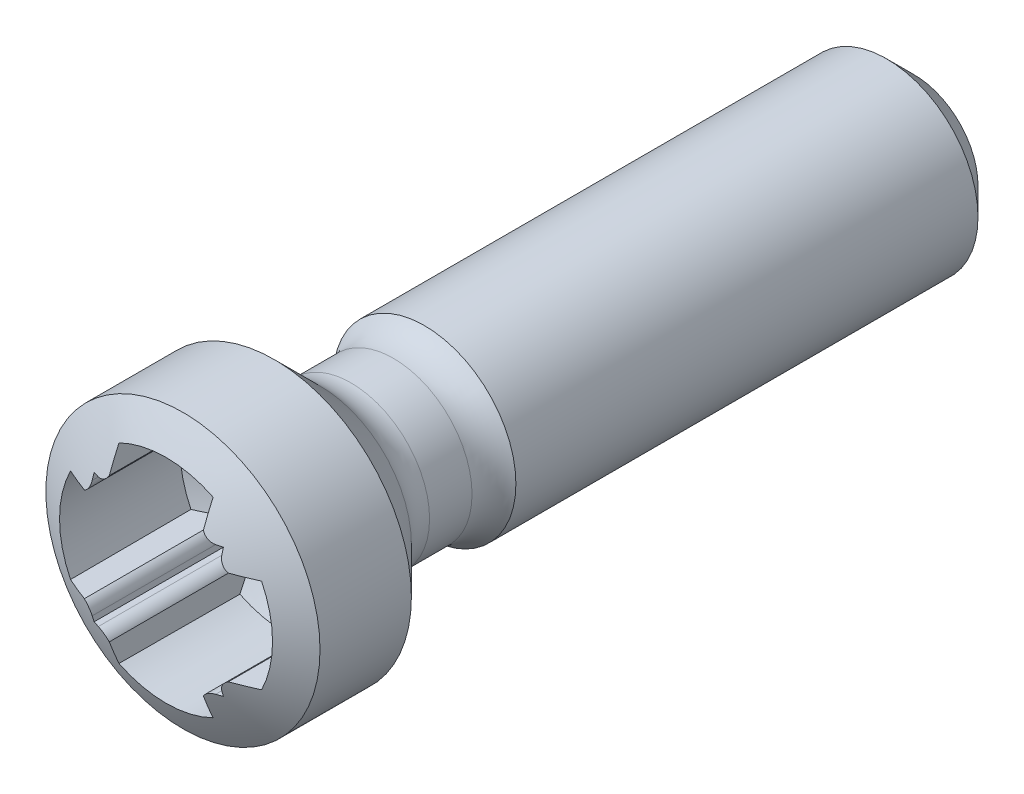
ISO-10303-21;
HEADER;
FILE_DESCRIPTION(('STEP AP214'),'2;1');
FILE_NAME('part.step','',(''),(''),'','','');
FILE_SCHEMA(('AUTOMOTIVE_DESIGN { 1 0 10303 214 1 1 1 1 }'));
ENDSEC;
DATA;
#1=APPLICATION_CONTEXT('core data for automotive mechanical design processes');
#2=APPLICATION_PROTOCOL_DEFINITION('international standard','automotive_design',2000,#1);
#3=PRODUCT_CONTEXT('',#1,'mechanical');
#4=PRODUCT('Part','Part','',(#3));
#5=PRODUCT_RELATED_PRODUCT_CATEGORY('part','',(#4));
#6=PRODUCT_DEFINITION_FORMATION('','',#4);
#7=PRODUCT_DEFINITION_CONTEXT('part definition',#1,'design');
#8=PRODUCT_DEFINITION('design','',#6,#7);
#9=PRODUCT_DEFINITION_SHAPE('','',#8);
#10=(LENGTH_UNIT() NAMED_UNIT(*) SI_UNIT(.MILLI.,.METRE.));
#11=(NAMED_UNIT(*) PLANE_ANGLE_UNIT() SI_UNIT($,.RADIAN.));
#12=(NAMED_UNIT(*) SI_UNIT($,.STERADIAN.) SOLID_ANGLE_UNIT());
#13=UNCERTAINTY_MEASURE_WITH_UNIT(LENGTH_MEASURE(1.E-05),#10,'distance_accuracy_value','');
#14=(GEOMETRIC_REPRESENTATION_CONTEXT(3) GLOBAL_UNCERTAINTY_ASSIGNED_CONTEXT((#13)) GLOBAL_UNIT_ASSIGNED_CONTEXT((#10,
#11,#12)) REPRESENTATION_CONTEXT('',''));
#15=CARTESIAN_POINT('',(0.,0.,0.));
#16=DIRECTION('',(0.,0.,1.));
#17=DIRECTION('',(1.,0.,0.));
#18=AXIS2_PLACEMENT_3D('',#15,#16,#17);
#19=CARTESIAN_POINT('',(0.,0.,-4.28139980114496));
#20=DIRECTION('',(0.,0.,1.));
#21=DIRECTION('',(1.,0.,0.));
#22=AXIS2_PLACEMENT_3D('',#19,#20,#21);
#23=DEGENERATE_TOROIDAL_SURFACE('',#22,1.08255992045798,5.,.F.);
#24=CARTESIAN_POINT('',(0.,0.,0.));
#25=DIRECTION('',(0.,0.,1.));
#26=DIRECTION('',(1.,0.,0.));
#27=AXIS2_PLACEMENT_3D('',#24,#25,#26);
#28=CIRCLE('',#27,1.5);
#29=CARTESIAN_POINT('',(1.5,0.,0.));
#30=VERTEX_POINT('',#29);
#31=EDGE_CURVE('E409',#30,#30,#28,.T.);
#32=ORIENTED_EDGE('',*,*,#31,.T.);
#33=EDGE_LOOP('',(#32));
#34=FACE_BOUND('',#33,.T.);
#35=CARTESIAN_POINT('',(-0.515,1.04596964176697,0.184528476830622));
#36=CARTESIAN_POINT('',(-0.515,0.983866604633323,0.212580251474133));
#37=CARTESIAN_POINT('',(-0.515,0.921087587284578,0.239147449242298));
#38=CARTESIAN_POINT('',(-0.515,0.794202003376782,0.288998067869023));
#39=CARTESIAN_POINT('',(-0.515,0.730094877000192,0.312280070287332));
#40=CARTESIAN_POINT('',(-0.515,0.600905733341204,0.354873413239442));
#41=CARTESIAN_POINT('',(-0.515,0.535829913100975,0.374203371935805));
#42=CARTESIAN_POINT('',(-0.515,0.404401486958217,0.40795975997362));
#43=CARTESIAN_POINT('',(-0.515,0.338049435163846,0.422388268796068));
#44=CARTESIAN_POINT('',(-0.515,0.218956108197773,0.441960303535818));
#45=CARTESIAN_POINT('',(-0.515,0.16644397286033,0.448450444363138));
#46=CARTESIAN_POINT('',(-0.515,0.061059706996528,0.456165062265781));
#47=CARTESIAN_POINT('',(-0.515,0.00818799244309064,0.457394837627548));
#48=CARTESIAN_POINT('',(-0.515,-0.0974725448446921,0.454324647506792));
#49=CARTESIAN_POINT('',(-0.515,-0.150261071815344,0.450015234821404));
#50=CARTESIAN_POINT('',(-0.515,-0.255279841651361,0.436708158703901));
#51=CARTESIAN_POINT('',(-0.515,-0.307509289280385,0.427704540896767));
#52=CARTESIAN_POINT('',(-0.515,-0.403247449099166,0.407758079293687));
#53=CARTESIAN_POINT('',(-0.515,-0.446865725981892,0.397324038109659));
#54=CARTESIAN_POINT('',(-0.515,-0.533550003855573,0.374355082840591));
#55=CARTESIAN_POINT('',(-0.515,-0.576615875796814,0.361819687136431));
#56=CARTESIAN_POINT('',(-0.515,-0.705001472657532,0.321570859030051));
#57=CARTESIAN_POINT('',(-0.515,-0.789497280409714,0.291217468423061));
#58=CARTESIAN_POINT('',(-0.515,-0.956786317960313,0.224675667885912));
#59=CARTESIAN_POINT('',(-0.515000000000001,-1.03956415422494,0.188449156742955));
#60=CARTESIAN_POINT('',(-0.515,-1.2026878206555,0.110961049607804));
#61=CARTESIAN_POINT('',(-0.515,-1.28303436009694,0.069700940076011));
#62=CARTESIAN_POINT('',(-0.515,-1.48017884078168,-0.0389849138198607));
#63=CARTESIAN_POINT('',(-0.515,-1.59540984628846,-0.109278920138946));
#64=CARTESIAN_POINT('',(-0.515000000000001,-1.8195154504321,-0.259363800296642));
#65=CARTESIAN_POINT('',(-0.515000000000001,-1.92838725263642,-0.339158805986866));
#66=CARTESIAN_POINT('',(-0.515,-2.24353218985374,-0.591035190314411));
#67=CARTESIAN_POINT('',(-0.515,-2.43953158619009,-0.776275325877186));
#68=CARTESIAN_POINT('',(-0.515,-2.79964779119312,-1.17734959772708));
#69=CARTESIAN_POINT('',(-0.515000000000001,-2.96356511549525,-1.39336156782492));
#70=CARTESIAN_POINT('',(-0.515000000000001,-3.25416351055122,-1.8496609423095));
#71=CARTESIAN_POINT('',(-0.515,-3.38078230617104,-2.08998805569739));
#72=CARTESIAN_POINT('',(-0.515,-3.59574839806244,-2.59442220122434));
#73=CARTESIAN_POINT('',(-0.515000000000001,-3.6830449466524,-2.85897740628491));
#74=CARTESIAN_POINT('',(-0.515000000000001,-3.81211653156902,-3.3988195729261));
#75=CARTESIAN_POINT('',(-0.515,-3.85391446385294,-3.67410106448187));
#76=CARTESIAN_POINT('',(-0.515,-3.89098083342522,-4.22883367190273));
#77=CARTESIAN_POINT('',(-0.515000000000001,-3.88607205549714,-4.50829664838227));
#78=CARTESIAN_POINT('',(-0.515000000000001,-3.82942749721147,-5.06250388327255));
#79=CARTESIAN_POINT('',(-0.515,-3.7776804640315,-5.33724699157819));
#80=CARTESIAN_POINT('',(-0.515,-3.62876466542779,-5.8742498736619));
#81=CARTESIAN_POINT('',(-0.515000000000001,-3.53157813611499,-6.13650472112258));
#82=CARTESIAN_POINT('',(-0.515000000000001,-3.29448859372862,-6.64091910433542));
#83=CARTESIAN_POINT('',(-0.515,-3.15459071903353,-6.88308105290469));
#84=CARTESIAN_POINT('',(-0.515,-2.83622758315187,-7.34003208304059));
#85=CARTESIAN_POINT('',(-0.515000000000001,-2.65781346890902,-7.55485687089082));
#86=CARTESIAN_POINT('',(-0.515000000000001,-2.26708998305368,-7.9512316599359));
#87=CARTESIAN_POINT('',(-0.515,-2.05479659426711,-8.13279726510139));
#88=CARTESIAN_POINT('',(-0.515,-1.7400692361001,-8.35794953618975));
#89=CARTESIAN_POINT('',(-0.515,-1.64929264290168,-8.41832326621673));
#90=CARTESIAN_POINT('',(-0.515000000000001,-1.46378930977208,-8.53262259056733));
#91=CARTESIAN_POINT('',(-0.515000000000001,-1.36906433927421,-8.58655103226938));
#92=CARTESIAN_POINT('',(-0.515,-1.17568648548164,-8.68760924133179));
#93=CARTESIAN_POINT('',(-0.515,-1.07702306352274,-8.73471895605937));
#94=CARTESIAN_POINT('',(-0.515,-0.926512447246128,-8.7994591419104));
#95=CARTESIAN_POINT('',(-0.515,-0.875927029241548,-8.82005043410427));
#96=CARTESIAN_POINT('',(-0.515,-0.773927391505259,-8.85906079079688));
#97=CARTESIAN_POINT('',(-0.515,-0.722513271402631,-8.87748011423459));
#98=CARTESIAN_POINT('',(-0.515,-0.613402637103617,-8.91365247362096));
#99=CARTESIAN_POINT('',(-0.515,-0.555614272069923,-8.93113151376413));
#100=CARTESIAN_POINT('',(-0.515,-0.439017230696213,-8.96236015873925));
#101=CARTESIAN_POINT('',(-0.515,-0.38020846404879,-8.97610943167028));
#102=CARTESIAN_POINT('',(-0.515,-0.262195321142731,-8.99849899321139));
#103=CARTESIAN_POINT('',(-0.515,-0.203001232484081,-9.00719036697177));
#104=CARTESIAN_POINT('',(-0.515,-0.113798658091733,-9.01537602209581));
#105=CARTESIAN_POINT('',(-0.515,-0.0840091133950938,-9.01729622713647));
#106=CARTESIAN_POINT('',(-0.515,-0.0243695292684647,-9.01940651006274));
#107=CARTESIAN_POINT('',(-0.515,0.00548050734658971,-9.01959666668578));
#108=CARTESIAN_POINT('',(-0.515,0.0952639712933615,-9.0175091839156));
#109=CARTESIAN_POINT('',(-0.515,0.155147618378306,-9.01254660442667));
#110=CARTESIAN_POINT('',(-0.515,0.274147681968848,-8.996682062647));
#111=CARTESIAN_POINT('',(-0.515,0.333262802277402,-8.98577113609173));
#112=CARTESIAN_POINT('',(-0.515,0.451152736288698,-8.95944579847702));
#113=CARTESIAN_POINT('',(-0.515,0.509916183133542,-8.94398195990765));
#114=CARTESIAN_POINT('',(-0.515,0.626391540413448,-8.90962334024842));
#115=CARTESIAN_POINT('',(-0.515,0.684103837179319,-8.8907298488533));
#116=CARTESIAN_POINT('',(-0.515,0.797428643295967,-8.85046614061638));
#117=CARTESIAN_POINT('',(-0.515,0.853060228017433,-8.82914928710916));
#118=CARTESIAN_POINT('',(-0.515,0.963327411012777,-8.78407107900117));
#119=CARTESIAN_POINT('',(-0.515,1.01796285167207,-8.76030934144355));
#120=CARTESIAN_POINT('',(-0.515,1.18037765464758,-8.68563832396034));
#121=CARTESIAN_POINT('',(-0.515,1.28662381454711,-8.63135837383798));
#122=CARTESIAN_POINT('',(-0.515,1.49419411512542,-8.51499131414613));
#123=CARTESIAN_POINT('',(-0.515,1.59553544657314,-8.45293469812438));
#124=CARTESIAN_POINT('',(-0.515,1.79325604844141,-8.32146181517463));
#125=CARTESIAN_POINT('',(-0.515,1.88963659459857,-8.25204745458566));
#126=CARTESIAN_POINT('',(-0.515,2.18056648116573,-8.02578367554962));
#127=CARTESIAN_POINT('',(-0.514999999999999,2.36604360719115,-7.85699803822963));
#128=CARTESIAN_POINT('',(-0.514999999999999,2.70919850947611,-7.49316047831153));
#129=CARTESIAN_POINT('',(-0.515,2.86685459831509,-7.29808827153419));
#130=CARTESIAN_POINT('',(-0.515,3.16519276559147,-6.86543573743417));
#131=CARTESIAN_POINT('',(-0.514999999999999,3.3025550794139,-6.6255522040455));
#132=CARTESIAN_POINT('',(-0.514999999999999,3.53549588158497,-6.12627935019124));
#133=CARTESIAN_POINT('',(-0.515,3.63106632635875,-5.86688628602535));
#134=CARTESIAN_POINT('',(-0.515,3.77851295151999,-5.33328430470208));
#135=CARTESIAN_POINT('',(-0.514999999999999,3.82996406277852,-5.05895775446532));
#136=CARTESIAN_POINT('',(-0.514999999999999,3.88617588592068,-4.50555778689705));
#137=CARTESIAN_POINT('',(-0.515,3.89093482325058,-4.226484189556));
#138=CARTESIAN_POINT('',(-0.515,3.85358913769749,-3.67090833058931));
#139=CARTESIAN_POINT('',(-0.514999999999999,3.81138795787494,-3.39441255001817));
#140=CARTESIAN_POINT('',(-0.514999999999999,3.68116940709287,-2.85252043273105));
#141=CARTESIAN_POINT('',(-0.515,3.59316605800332,-2.58712072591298));
#142=CARTESIAN_POINT('',(-0.515,3.37388050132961,-2.07507283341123));
#143=CARTESIAN_POINT('',(-0.514999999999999,3.24263151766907,-1.82841043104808));
#144=CARTESIAN_POINT('',(-0.514999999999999,2.94033198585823,-1.36041055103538));
#145=CARTESIAN_POINT('',(-0.515,2.76923060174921,-1.13910596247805));
#146=CARTESIAN_POINT('',(-0.515,2.39217605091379,-0.728887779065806));
#147=CARTESIAN_POINT('',(-0.515,2.18628002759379,-0.539922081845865));
#148=CARTESIAN_POINT('',(-0.515,1.85609480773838,-0.285528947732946));
#149=CARTESIAN_POINT('',(-0.515,1.74265096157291,-0.20566595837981));
#150=CARTESIAN_POINT('',(-0.515,1.50923272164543,-0.0561879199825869));
#151=CARTESIAN_POINT('',(-0.515,1.38926355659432,0.013435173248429));
#152=CARTESIAN_POINT('',(-0.515,1.23020118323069,0.096241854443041));
#153=CARTESIAN_POINT('',(-0.515,1.19374203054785,0.114599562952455));
#154=CARTESIAN_POINT('',(-0.515,1.12026019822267,0.150327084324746));
#155=CARTESIAN_POINT('',(-0.515,1.08323663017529,0.167695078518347));
#156=CARTESIAN_POINT('',(-0.515,1.04596964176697,0.184528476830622));
#157=B_SPLINE_CURVE_WITH_KNOTS('',3,(#35,#36,#37,#38,#39,#40,#41,#42,#43,#44,#45,#46,#47,#48,
#49,#50,#51,#52,#53,#54,#55,#56,#57,#58,#59,#60,#61,#62,#63,#64,#65,#66,#67,#68,#69,#70,#71,#72,
#73,#74,#75,#76,#77,#78,#79,#80,#81,#82,#83,#84,#85,#86,#87,#88,#89,#90,#91,#92,#93,#94,#95,#96,
#97,#98,#99,#100,#101,#102,#103,#104,#105,#106,#107,#108,#109,#110,#111,#112,#113,#114,#115,
#116,#117,#118,#119,#120,#121,#122,#123,#124,#125,#126,#127,#128,#129,#130,#131,#132,#133,#134,
#135,#136,#137,#138,#139,#140,#141,#142,#143,#144,#145,#146,#147,#148,#149,#150,#151,#152,#153,
#154,#155,#156),.UNSPECIFIED.,.T.,.F.,(4,2,2,2,2,2,2,2,2,2,2,2,2,2,2,2,2,2,2,2,2,2,2,2,2,2,2,2,
2,2,2,2,2,2,2,2,2,2,2,2,2,2,2,2,2,2,2,2,2,2,2,2,2,2,2,2,2,2,2,2,4),(0.,0.204420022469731,
0.408928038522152,0.612449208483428,0.815883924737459,0.974405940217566,1.13276825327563,
1.29140101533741,1.45023548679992,1.58472312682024,1.7192416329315,1.98831511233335,
2.25920968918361,2.53002446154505,2.9344099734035,3.3389719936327,4.14403605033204,
4.95395712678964,5.76522291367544,6.59703971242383,7.42843772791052,8.26299149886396,
9.09774582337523,9.93282675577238,10.7678072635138,11.6016857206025,12.4351719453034,
12.762040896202,13.0887649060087,13.416431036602,13.5802386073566,13.7440266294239,
13.925047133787,14.1060837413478,14.2852586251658,14.3747671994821,14.4642717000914,
14.6441282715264,14.824256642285,15.0064175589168,15.1885101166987,15.3671722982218,
15.5458625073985,15.9033755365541,16.2595281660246,16.6155887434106,17.3646793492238,
18.1143513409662,18.9396962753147,19.7651999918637,20.5985704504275,21.4319725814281,
22.2670914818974,23.1019548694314,23.9361783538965,24.7714718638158,25.6054066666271,
26.0212042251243,26.4366733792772,26.559124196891,26.6817932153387),.UNSPECIFIED.);
#158=CARTESIAN_POINT('',(-0.515,1.04530473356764,0.184828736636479));
#159=VERTEX_POINT('',#158);
#160=CARTESIAN_POINT('',(-0.515,0.78789369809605,0.290698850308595));
#161=VERTEX_POINT('',#160);
#162=EDGE_CURVE('E369',#159,#161,#157,.T.);
#163=ORIENTED_EDGE('',*,*,#162,.F.);
#164=CARTESIAN_POINT('',(0.,0.,0.184828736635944));
#165=DIRECTION('',(0.,0.,-1.));
#166=DIRECTION('',(0.,1.,0.));
#167=AXIS2_PLACEMENT_3D('',#164,#165,#166);
#168=CIRCLE('',#167,1.16528407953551);
#169=CARTESIAN_POINT('',(0.515,1.04530473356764,0.184828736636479));
#170=VERTEX_POINT('',#169);
#171=EDGE_CURVE('E414',#159,#170,#168,.T.);
#172=ORIENTED_EDGE('',*,*,#171,.T.);
#173=CARTESIAN_POINT('',(0.515000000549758,1.04596964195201,0.184528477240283));
#174=CARTESIAN_POINT('',(0.515000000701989,0.983866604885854,0.212580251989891));
#175=CARTESIAN_POINT('',(0.515000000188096,0.921087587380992,0.239147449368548));
#176=CARTESIAN_POINT('',(0.514999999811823,0.794202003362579,0.288998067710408));
#177=CARTESIAN_POINT('',(0.514999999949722,0.730094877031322,0.312280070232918));
#178=CARTESIAN_POINT('',(0.515000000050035,0.600905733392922,0.354873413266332));
#179=CARTESIAN_POINT('',(0.515000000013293,0.535829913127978,0.374203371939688));
#180=CARTESIAN_POINT('',(0.514999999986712,0.404401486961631,0.407959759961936));
#181=CARTESIAN_POINT('',(0.514999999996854,0.338049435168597,0.422388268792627));
#182=CARTESIAN_POINT('',(0.515000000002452,0.218956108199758,0.441960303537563));
#183=CARTESIAN_POINT('',(0.515000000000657,0.166443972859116,0.448450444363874));
#184=CARTESIAN_POINT('',(0.514999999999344,0.0610597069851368,0.456165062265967));
#185=CARTESIAN_POINT('',(0.514999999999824,0.00818799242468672,0.457394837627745));
#186=CARTESIAN_POINT('',(0.515000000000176,-0.097472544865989,0.454324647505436));
#187=CARTESIAN_POINT('',(0.515000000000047,-0.150261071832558,0.450015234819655));
#188=CARTESIAN_POINT('',(0.514999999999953,-0.255279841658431,0.436708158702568));
#189=CARTESIAN_POINT('',(0.514999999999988,-0.307509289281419,0.427704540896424));
#190=CARTESIAN_POINT('',(0.51500000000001,-0.403247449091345,0.407758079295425));
#191=CARTESIAN_POINT('',(0.515000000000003,-0.446865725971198,0.39732403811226));
#192=CARTESIAN_POINT('',(0.514999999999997,-0.533550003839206,0.374355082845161));
#193=CARTESIAN_POINT('',(0.514999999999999,-0.576615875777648,0.361819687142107));
#194=CARTESIAN_POINT('',(0.515000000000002,-0.705001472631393,0.321570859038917));
#195=CARTESIAN_POINT('',(0.515,-0.789497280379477,0.291217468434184));
#196=CARTESIAN_POINT('',(0.514999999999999,-0.956786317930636,0.224675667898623));
#197=CARTESIAN_POINT('',(0.514999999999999,-1.03956415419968,0.18844915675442));
#198=CARTESIAN_POINT('',(0.515,-1.20268782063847,0.110961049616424));
#199=CARTESIAN_POINT('',(0.515,-1.28303436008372,0.0697009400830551));
#200=CARTESIAN_POINT('',(0.515,-1.48017884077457,-0.0389849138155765));
#201=CARTESIAN_POINT('',(0.515,-1.59540984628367,-0.10927892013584));
#202=CARTESIAN_POINT('',(0.514999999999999,-1.81951545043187,-0.259363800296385));
#203=CARTESIAN_POINT('',(0.514999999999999,-1.92838725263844,-0.339158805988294));
#204=CARTESIAN_POINT('',(0.515,-2.24353218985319,-0.591035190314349));
#205=CARTESIAN_POINT('',(0.515,-2.43953158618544,-0.77627532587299));
#206=CARTESIAN_POINT('',(0.515,-2.79964779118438,-1.17734959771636));
#207=CARTESIAN_POINT('',(0.514999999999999,-2.96356511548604,-1.39336156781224));
#208=CARTESIAN_POINT('',(0.514999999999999,-3.25416351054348,-1.84966094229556));
#209=CARTESIAN_POINT('',(0.515,-3.38078230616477,-2.08998805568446));
#210=CARTESIAN_POINT('',(0.515,-3.59574839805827,-2.59442220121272));
#211=CARTESIAN_POINT('',(0.514999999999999,-3.68304494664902,-2.85897740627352));
#212=CARTESIAN_POINT('',(0.514999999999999,-3.81211653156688,-3.39881957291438));
#213=CARTESIAN_POINT('',(0.515,-3.85391446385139,-3.67410106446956));
#214=CARTESIAN_POINT('',(0.515,-3.89098083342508,-4.22883367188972));
#215=CARTESIAN_POINT('',(0.514999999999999,-3.88607205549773,-4.50829664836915));
#216=CARTESIAN_POINT('',(0.514999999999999,-3.82942749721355,-5.06250388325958));
#217=CARTESIAN_POINT('',(0.515,-3.77768046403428,-5.33724699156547));
#218=CARTESIAN_POINT('',(0.515,-3.62876466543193,-5.87424987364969));
#219=CARTESIAN_POINT('',(0.514999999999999,-3.5315781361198,-6.13650472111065));
#220=CARTESIAN_POINT('',(0.514999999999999,-3.29448859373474,-6.6409191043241));
#221=CARTESIAN_POINT('',(0.515,-3.15459071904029,-6.88308105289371));
#222=CARTESIAN_POINT('',(0.515,-2.83622758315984,-7.34003208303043));
#223=CARTESIAN_POINT('',(0.514999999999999,-2.65781346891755,-7.55485687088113));
#224=CARTESIAN_POINT('',(0.514999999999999,-2.26708998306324,-7.95123165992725));
#225=CARTESIAN_POINT('',(0.515,-2.05479659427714,-8.13279726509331));
#226=CARTESIAN_POINT('',(0.515,-1.74006923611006,-8.35794953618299));
#227=CARTESIAN_POINT('',(0.515,-1.64929264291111,-8.41832326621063));
#228=CARTESIAN_POINT('',(0.514999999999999,-1.46378930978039,-8.53262259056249));
#229=CARTESIAN_POINT('',(0.514999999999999,-1.36906433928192,-8.58655103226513));
#230=CARTESIAN_POINT('',(0.515,-1.17568648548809,-8.68760924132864));
#231=CARTESIAN_POINT('',(0.515,-1.07702306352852,-8.73471895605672));
#232=CARTESIAN_POINT('',(0.515,-0.926512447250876,-8.79945914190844));
#233=CARTESIAN_POINT('',(0.515,-0.875927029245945,-8.82005043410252));
#234=CARTESIAN_POINT('',(0.515,-0.773927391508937,-8.85906079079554));
#235=CARTESIAN_POINT('',(0.515,-0.722513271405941,-8.87748011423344));
#236=CARTESIAN_POINT('',(0.515,-0.613402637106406,-8.91365247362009));
#237=CARTESIAN_POINT('',(0.515,-0.555614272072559,-8.93113151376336));
#238=CARTESIAN_POINT('',(0.515,-0.439017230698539,-8.96236015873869));
#239=CARTESIAN_POINT('',(0.515,-0.380208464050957,-8.97610943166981));
#240=CARTESIAN_POINT('',(0.515,-0.262195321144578,-8.9984989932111));
#241=CARTESIAN_POINT('',(0.515,-0.203001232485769,-9.00719036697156));
#242=CARTESIAN_POINT('',(0.515,-0.113798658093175,-9.0153760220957));
#243=CARTESIAN_POINT('',(0.515,-0.0840091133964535,-9.01729622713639));
#244=CARTESIAN_POINT('',(0.515,-0.0243695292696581,-9.01940651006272));
#245=CARTESIAN_POINT('',(0.515,0.00548050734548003,-9.01959666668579));
#246=CARTESIAN_POINT('',(0.515,0.0952639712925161,-9.01750918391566));
#247=CARTESIAN_POINT('',(0.515,0.155147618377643,-9.01254660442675));
#248=CARTESIAN_POINT('',(0.515,0.274147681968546,-8.99668206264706));
#249=CARTESIAN_POINT('',(0.515,0.333262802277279,-8.98577113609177));
#250=CARTESIAN_POINT('',(0.515,0.451152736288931,-8.95944579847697));
#251=CARTESIAN_POINT('',(0.515,0.509916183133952,-8.94398195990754));
#252=CARTESIAN_POINT('',(0.515,0.626391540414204,-8.90962334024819));
#253=CARTESIAN_POINT('',(0.515,0.684103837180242,-8.89072984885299));
#254=CARTESIAN_POINT('',(0.515,0.797428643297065,-8.85046614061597));
#255=CARTESIAN_POINT('',(0.515,0.853060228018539,-8.82914928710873));
#256=CARTESIAN_POINT('',(0.515,0.963327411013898,-8.78407107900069));
#257=CARTESIAN_POINT('',(0.515,1.01796285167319,-8.76030934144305));
#258=CARTESIAN_POINT('',(0.515,1.18037765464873,-8.68563832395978));
#259=CARTESIAN_POINT('',(0.515,1.28662381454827,-8.63135837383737));
#260=CARTESIAN_POINT('',(0.515,1.49419411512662,-8.51499131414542));
#261=CARTESIAN_POINT('',(0.515,1.59553544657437,-8.45293469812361));
#262=CARTESIAN_POINT('',(0.515,1.7932560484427,-8.32146181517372));
#263=CARTESIAN_POINT('',(0.515,1.88963659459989,-8.25204745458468));
#264=CARTESIAN_POINT('',(0.515,2.18056648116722,-8.02578367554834));
#265=CARTESIAN_POINT('',(0.515000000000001,2.36604360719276,-7.85699803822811));
#266=CARTESIAN_POINT('',(0.515000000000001,2.70919850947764,-7.49316047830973));
#267=CARTESIAN_POINT('',(0.515,2.86685459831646,-7.2980882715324));
#268=CARTESIAN_POINT('',(0.515,3.16519276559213,-6.865435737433));
#269=CARTESIAN_POINT('',(0.515000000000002,3.30255507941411,-6.62555220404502));
#270=CARTESIAN_POINT('',(0.515,3.53549588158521,-6.12627935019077));
#271=CARTESIAN_POINT('',(0.514999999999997,3.63106632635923,-5.86688628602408));
#272=CARTESIAN_POINT('',(0.515000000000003,3.77851295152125,-5.33328430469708));
#273=CARTESIAN_POINT('',(0.515000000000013,3.82996406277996,-5.0589577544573));
#274=CARTESIAN_POINT('',(0.514999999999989,3.88617588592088,-4.50555778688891));
#275=CARTESIAN_POINT('',(0.514999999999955,3.89093482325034,-4.22648418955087));
#276=CARTESIAN_POINT('',(0.515000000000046,3.85358913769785,-3.67090833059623));
#277=CARTESIAN_POINT('',(0.515000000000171,3.81138795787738,-3.39441255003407));
#278=CARTESIAN_POINT('',(0.51499999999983,3.68116940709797,-2.85252043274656));
#279=CARTESIAN_POINT('',(0.514999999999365,3.59316605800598,-2.58712072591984));
#280=CARTESIAN_POINT('',(0.515000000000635,3.37388050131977,-2.0750728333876));
#281=CARTESIAN_POINT('',(0.51500000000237,3.24263151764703,-1.82841043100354));
#282=CARTESIAN_POINT('',(0.514999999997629,2.94033198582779,-1.36041055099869));
#283=CARTESIAN_POINT('',(0.514999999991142,2.76923060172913,-1.1391059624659));
#284=CARTESIAN_POINT('',(0.515000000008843,2.39217605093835,-0.728887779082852));
#285=CARTESIAN_POINT('',(0.515000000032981,2.18628002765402,-0.539922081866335));
#286=CARTESIAN_POINT('',(0.514999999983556,1.8560948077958,-0.285528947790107));
#287=CARTESIAN_POINT('',(0.514999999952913,1.74265096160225,-0.205665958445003));
#288=CARTESIAN_POINT('',(0.515000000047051,1.50923272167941,-0.056187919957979));
#289=CARTESIAN_POINT('',(0.515000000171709,1.38926355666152,0.0134351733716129));
#290=CARTESIAN_POINT('',(0.514999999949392,1.23020118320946,0.0962418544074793));
#291=CARTESIAN_POINT('',(0.514999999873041,1.19374203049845,0.114599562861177));
#292=CARTESIAN_POINT('',(0.515000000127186,1.12026019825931,0.15032708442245));
#293=CARTESIAN_POINT('',(0.515000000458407,1.08323663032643,0.167695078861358));
#294=CARTESIAN_POINT('',(0.515000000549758,1.04596964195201,0.184528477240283));
#295=B_SPLINE_CURVE_WITH_KNOTS('',3,(#173,#174,#175,#176,#177,#178,#179,#180,#181,#182,#183,
#184,#185,#186,#187,#188,#189,#190,#191,#192,#193,#194,#195,#196,#197,#198,#199,#200,#201,#202,
#203,#204,#205,#206,#207,#208,#209,#210,#211,#212,#213,#214,#215,#216,#217,#218,#219,#220,#221,
#222,#223,#224,#225,#226,#227,#228,#229,#230,#231,#232,#233,#234,#235,#236,#237,#238,#239,#240,
#241,#242,#243,#244,#245,#246,#247,#248,#249,#250,#251,#252,#253,#254,#255,#256,#257,#258,#259,
#260,#261,#262,#263,#264,#265,#266,#267,#268,#269,#270,#271,#272,#273,#274,#275,#276,#277,#278,
#279,#280,#281,#282,#283,#284,#285,#286,#287,#288,#289,#290,#291,#292,#293,#294),.UNSPECIFIED.,
.T.,.F.,(4,2,2,2,2,2,2,2,2,2,2,2,2,2,2,2,2,2,2,2,2,2,2,2,2,2,2,2,2,2,2,2,2,2,2,2,2,2,2,2,2,2,2,
2,2,2,2,2,2,2,2,2,2,2,2,2,2,2,2,2,4),(0.,0.204420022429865,0.408928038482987,0.612449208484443,
0.815883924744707,0.974405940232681,1.13276825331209,1.29140101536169,1.45023548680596,
1.58472312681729,1.71924163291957,1.98831511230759,2.25920968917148,2.53002446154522,
2.93440997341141,3.338971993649,4.14403605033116,4.95395712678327,5.76522291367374,
6.59703971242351,7.42843772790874,8.26299149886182,9.09774582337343,9.93282675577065,
10.767807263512,11.6016857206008,12.4351719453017,12.7620408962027,13.0887649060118,
13.4164310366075,13.5802386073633,13.7440266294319,13.9250471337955,14.1060837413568,
14.2852586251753,14.3747671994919,14.4642717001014,14.644128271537,14.8242566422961,
15.0064175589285,15.188510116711,15.367172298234,15.5458625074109,15.9033755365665,
16.2595281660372,16.6155887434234,17.3646793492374,18.1143513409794,18.9396962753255,
19.765199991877,20.5985704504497,21.4319725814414,22.2670914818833,23.1019548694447,
23.9361783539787,24.7714718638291,25.6054066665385,26.0212042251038,26.4366733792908,
26.5591241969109,26.6817932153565),.UNSPECIFIED.);
#296=CARTESIAN_POINT('',(0.515,0.787893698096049,0.290698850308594));
#297=VERTEX_POINT('',#296);
#298=EDGE_CURVE('E644',#170,#297,#295,.T.);
#299=ORIENTED_EDGE('',*,*,#298,.T.);
#300=CARTESIAN_POINT('',(0.641767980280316,0.709226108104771,0.283935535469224));
#301=CARTESIAN_POINT('',(0.634163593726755,0.709483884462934,0.286129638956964));
#302=CARTESIAN_POINT('',(0.626508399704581,0.710338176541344,0.288107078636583));
#303=CARTESIAN_POINT('',(0.611299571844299,0.713241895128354,0.291558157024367));
#304=CARTESIAN_POINT('',(0.603746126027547,0.715293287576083,0.293030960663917));
#305=CARTESIAN_POINT('',(0.588951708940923,0.720599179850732,0.295397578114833));
#306=CARTESIAN_POINT('',(0.581711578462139,0.723856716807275,0.296289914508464));
#307=CARTESIAN_POINT('',(0.567807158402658,0.731499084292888,0.297440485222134));
#308=CARTESIAN_POINT('',(0.5611422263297,0.735882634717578,0.297699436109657));
#309=CARTESIAN_POINT('',(0.548866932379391,0.74543644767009,0.297573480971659));
#310=CARTESIAN_POINT('',(0.54322352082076,0.750564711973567,0.297215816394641));
#311=CARTESIAN_POINT('',(0.532812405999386,0.761575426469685,0.295926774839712));
#312=CARTESIAN_POINT('',(0.528044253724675,0.767457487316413,0.294995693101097));
#313=CARTESIAN_POINT('',(0.52056271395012,0.778234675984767,0.292911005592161));
#314=CARTESIAN_POINT('',(0.517634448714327,0.783004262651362,0.291872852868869));
#315=CARTESIAN_POINT('',(0.514999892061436,0.787893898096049,0.290698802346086));
#316=B_SPLINE_CURVE_WITH_KNOTS('',3,(#300,#301,#302,#303,#304,#305,#306,#307,#308,#309,#310,
#311,#312,#313,#314,#315),.UNSPECIFIED.,.F.,.F.,(4,2,2,2,2,2,2,4),(0.,0.0237445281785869,
0.0475281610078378,0.0713720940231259,0.0951890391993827,0.117980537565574,0.140760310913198,
0.157791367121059),.UNSPECIFIED.);
#317=CARTESIAN_POINT('',(0.641767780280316,0.709226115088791,0.283935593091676));
#318=VERTEX_POINT('',#317);
#319=EDGE_CURVE('E593',#318,#297,#316,.T.);
#320=ORIENTED_EDGE('',*,*,#319,.F.);
#321=CARTESIAN_POINT('',(0.641767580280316,0.709226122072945,0.283935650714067));
#322=CARTESIAN_POINT('',(0.652667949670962,0.708845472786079,0.280793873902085));
#323=CARTESIAN_POINT('',(0.663550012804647,0.708465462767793,0.277591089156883));
#324=CARTESIAN_POINT('',(0.685277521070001,0.707706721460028,0.271063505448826));
#325=CARTESIAN_POINT('',(0.696122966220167,0.707327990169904,0.26773870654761));
#326=CARTESIAN_POINT('',(0.706950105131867,0.706949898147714,0.264352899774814));
#327=B_SPLINE_CURVE_WITH_KNOTS('',3,(#321,#322,#323,#324,#325,#326),.UNSPECIFIED.,.F.,.F.,(4,2,
4),(0.,0.0340498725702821,0.0680997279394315),.UNSPECIFIED.);
#328=CARTESIAN_POINT('',(0.706949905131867,0.706949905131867,0.264352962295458));
#329=VERTEX_POINT('',#328);
#330=EDGE_CURVE('E55',#318,#329,#327,.T.);
#331=ORIENTED_EDGE('',*,*,#330,.T.);
#332=CARTESIAN_POINT('',(0.709226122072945,0.641767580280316,0.283935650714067));
#333=CARTESIAN_POINT('',(0.70884547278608,0.652667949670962,0.280793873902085));
#334=CARTESIAN_POINT('',(0.708465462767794,0.663550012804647,0.277591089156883));
#335=CARTESIAN_POINT('',(0.707706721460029,0.685277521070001,0.271063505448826));
#336=CARTESIAN_POINT('',(0.707327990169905,0.696122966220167,0.26773870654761));
#337=CARTESIAN_POINT('',(0.706949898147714,0.706950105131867,0.264352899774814));
#338=B_SPLINE_CURVE_WITH_KNOTS('',3,(#332,#333,#334,#335,#336,#337),.UNSPECIFIED.,.F.,.F.,(4,2,
4),(0.,0.034049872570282,0.0680997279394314),.UNSPECIFIED.);
#339=CARTESIAN_POINT('',(0.709226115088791,0.641767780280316,0.283935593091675));
#340=VERTEX_POINT('',#339);
#341=EDGE_CURVE('E567',#340,#329,#338,.T.);
#342=ORIENTED_EDGE('',*,*,#341,.F.);
#343=CARTESIAN_POINT('',(0.709226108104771,0.641767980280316,0.283935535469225));
#344=CARTESIAN_POINT('',(0.709483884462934,0.634163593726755,0.286129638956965));
#345=CARTESIAN_POINT('',(0.710338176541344,0.626508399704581,0.288107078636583));
#346=CARTESIAN_POINT('',(0.713241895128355,0.611299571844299,0.291558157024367));
#347=CARTESIAN_POINT('',(0.715293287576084,0.603746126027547,0.293030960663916));
#348=CARTESIAN_POINT('',(0.720599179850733,0.588951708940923,0.295397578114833));
#349=CARTESIAN_POINT('',(0.723856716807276,0.581711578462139,0.296289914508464));
#350=CARTESIAN_POINT('',(0.731499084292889,0.567807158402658,0.297440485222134));
#351=CARTESIAN_POINT('',(0.735882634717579,0.5611422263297,0.297699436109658));
#352=CARTESIAN_POINT('',(0.74543644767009,0.548866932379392,0.29757348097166));
#353=CARTESIAN_POINT('',(0.750564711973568,0.54322352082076,0.297215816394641));
#354=CARTESIAN_POINT('',(0.761575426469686,0.532812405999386,0.295926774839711));
#355=CARTESIAN_POINT('',(0.767457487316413,0.528044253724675,0.294995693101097));
#356=CARTESIAN_POINT('',(0.778234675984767,0.520562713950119,0.292911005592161));
#357=CARTESIAN_POINT('',(0.783004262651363,0.517634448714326,0.291872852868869));
#358=CARTESIAN_POINT('',(0.787893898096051,0.514999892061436,0.290698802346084));
#359=B_SPLINE_CURVE_WITH_KNOTS('',3,(#343,#344,#345,#346,#347,#348,#349,#350,#351,#352,#353,
#354,#355,#356,#357,#358),.UNSPECIFIED.,.F.,.F.,(4,2,2,2,2,2,2,4),(0.,0.0237445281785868,
0.0475281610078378,0.0713720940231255,0.0951890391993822,0.117980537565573,0.140760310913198,
0.157791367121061),.UNSPECIFIED.);
#360=CARTESIAN_POINT('',(0.787893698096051,0.515,0.290698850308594));
#361=VERTEX_POINT('',#360);
#362=EDGE_CURVE('E798',#340,#361,#359,.T.);
#363=ORIENTED_EDGE('',*,*,#362,.T.);
#364=CARTESIAN_POINT('',(1.04596964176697,0.515,0.184528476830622));
#365=CARTESIAN_POINT('',(0.983866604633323,0.515,0.212580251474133));
#366=CARTESIAN_POINT('',(0.921087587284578,0.515,0.239147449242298));
#367=CARTESIAN_POINT('',(0.794202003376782,0.515000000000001,0.288998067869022));
#368=CARTESIAN_POINT('',(0.730094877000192,0.515000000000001,0.312280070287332));
#369=CARTESIAN_POINT('',(0.600905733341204,0.515000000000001,0.354873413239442));
#370=CARTESIAN_POINT('',(0.535829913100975,0.515000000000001,0.374203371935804));
#371=CARTESIAN_POINT('',(0.404401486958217,0.515,0.407959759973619));
#372=CARTESIAN_POINT('',(0.338049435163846,0.515,0.422388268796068));
#373=CARTESIAN_POINT('',(0.218956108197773,0.515,0.441960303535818));
#374=CARTESIAN_POINT('',(0.16644397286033,0.515000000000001,0.448450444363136));
#375=CARTESIAN_POINT('',(0.061059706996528,0.515000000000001,0.45616506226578));
#376=CARTESIAN_POINT('',(0.00818799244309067,0.515000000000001,0.457394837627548));
#377=CARTESIAN_POINT('',(-0.0974725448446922,0.515000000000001,0.454324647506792));
#378=CARTESIAN_POINT('',(-0.150261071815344,0.515000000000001,0.450015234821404));
#379=CARTESIAN_POINT('',(-0.255279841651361,0.515000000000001,0.436708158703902));
#380=CARTESIAN_POINT('',(-0.307509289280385,0.515,0.427704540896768));
#381=CARTESIAN_POINT('',(-0.403247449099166,0.515,0.407758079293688));
#382=CARTESIAN_POINT('',(-0.446865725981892,0.515000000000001,0.39732403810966));
#383=CARTESIAN_POINT('',(-0.533550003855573,0.515000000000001,0.374355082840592));
#384=CARTESIAN_POINT('',(-0.576615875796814,0.515000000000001,0.36181968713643));
#385=CARTESIAN_POINT('',(-0.705001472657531,0.515000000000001,0.321570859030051));
#386=CARTESIAN_POINT('',(-0.789497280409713,0.515000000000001,0.291217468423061));
#387=CARTESIAN_POINT('',(-0.956786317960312,0.515000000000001,0.224675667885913));
#388=CARTESIAN_POINT('',(-1.03956415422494,0.515000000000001,0.188449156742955));
#389=CARTESIAN_POINT('',(-1.2026878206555,0.515000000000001,0.110961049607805));
#390=CARTESIAN_POINT('',(-1.28303436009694,0.515,0.0697009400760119));
#391=CARTESIAN_POINT('',(-1.48017884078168,0.515,-0.0389849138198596));
#392=CARTESIAN_POINT('',(-1.59540984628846,0.515000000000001,-0.109278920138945));
#393=CARTESIAN_POINT('',(-1.8195154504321,0.515000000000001,-0.259363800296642));
#394=CARTESIAN_POINT('',(-1.92838725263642,0.515000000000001,-0.339158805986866));
#395=CARTESIAN_POINT('',(-2.24353218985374,0.515,-0.591035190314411));
#396=CARTESIAN_POINT('',(-2.43953158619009,0.515,-0.776275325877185));
#397=CARTESIAN_POINT('',(-2.79964779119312,0.515,-1.17734959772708));
#398=CARTESIAN_POINT('',(-2.96356511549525,0.515,-1.39336156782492));
#399=CARTESIAN_POINT('',(-3.25416351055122,0.515,-1.8496609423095));
#400=CARTESIAN_POINT('',(-3.38078230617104,0.515,-2.08998805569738));
#401=CARTESIAN_POINT('',(-3.59574839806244,0.515,-2.59442220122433));
#402=CARTESIAN_POINT('',(-3.6830449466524,0.515,-2.85897740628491));
#403=CARTESIAN_POINT('',(-3.81211653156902,0.515,-3.3988195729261));
#404=CARTESIAN_POINT('',(-3.85391446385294,0.515,-3.67410106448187));
#405=CARTESIAN_POINT('',(-3.89098083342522,0.515,-4.22883367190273));
#406=CARTESIAN_POINT('',(-3.88607205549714,0.514999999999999,-4.50829664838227));
#407=CARTESIAN_POINT('',(-3.82942749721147,0.515,-5.06250388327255));
#408=CARTESIAN_POINT('',(-3.7776804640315,0.515,-5.33724699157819));
#409=CARTESIAN_POINT('',(-3.62876466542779,0.515,-5.8742498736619));
#410=CARTESIAN_POINT('',(-3.53157813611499,0.514999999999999,-6.13650472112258));
#411=CARTESIAN_POINT('',(-3.29448859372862,0.514999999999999,-6.64091910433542));
#412=CARTESIAN_POINT('',(-3.15459071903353,0.515,-6.88308105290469));
#413=CARTESIAN_POINT('',(-2.83622758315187,0.515,-7.34003208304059));
#414=CARTESIAN_POINT('',(-2.65781346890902,0.514999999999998,-7.55485687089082));
#415=CARTESIAN_POINT('',(-2.26708998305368,0.514999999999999,-7.9512316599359));
#416=CARTESIAN_POINT('',(-2.05479659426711,0.515000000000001,-8.13279726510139));
#417=CARTESIAN_POINT('',(-1.7400692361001,0.515,-8.35794953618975));
#418=CARTESIAN_POINT('',(-1.64929264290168,0.514999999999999,-8.41832326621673));
#419=CARTESIAN_POINT('',(-1.46378930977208,0.514999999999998,-8.53262259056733));
#420=CARTESIAN_POINT('',(-1.36906433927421,0.514999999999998,-8.58655103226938));
#421=CARTESIAN_POINT('',(-1.17568648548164,0.514999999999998,-8.68760924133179));
#422=CARTESIAN_POINT('',(-1.07702306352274,0.514999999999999,-8.73471895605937));
#423=CARTESIAN_POINT('',(-0.926512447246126,0.514999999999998,-8.7994591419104));
#424=CARTESIAN_POINT('',(-0.875927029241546,0.514999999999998,-8.82005043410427));
#425=CARTESIAN_POINT('',(-0.773927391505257,0.514999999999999,-8.85906079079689));
#426=CARTESIAN_POINT('',(-0.722513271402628,0.515,-8.87748011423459));
#427=CARTESIAN_POINT('',(-0.613402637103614,0.515,-8.91365247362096));
#428=CARTESIAN_POINT('',(-0.55561427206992,0.514999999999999,-8.93113151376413));
#429=CARTESIAN_POINT('',(-0.43901723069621,0.514999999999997,-8.96236015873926));
#430=CARTESIAN_POINT('',(-0.380208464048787,0.514999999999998,-8.97610943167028));
#431=CARTESIAN_POINT('',(-0.262195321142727,0.514999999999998,-8.99849899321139));
#432=CARTESIAN_POINT('',(-0.203001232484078,0.514999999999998,-9.00719036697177));
#433=CARTESIAN_POINT('',(-0.11379865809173,0.514999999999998,-9.01537602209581));
#434=CARTESIAN_POINT('',(-0.0840091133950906,0.514999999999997,-9.01729622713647));
#435=CARTESIAN_POINT('',(-0.0243695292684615,0.514999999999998,-9.01940651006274));
#436=CARTESIAN_POINT('',(0.00548050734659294,0.515,-9.01959666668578));
#437=CARTESIAN_POINT('',(0.0952639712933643,0.515000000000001,-9.0175091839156));
#438=CARTESIAN_POINT('',(0.155147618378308,0.514999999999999,-9.01254660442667));
#439=CARTESIAN_POINT('',(0.27414768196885,0.514999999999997,-8.996682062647));
#440=CARTESIAN_POINT('',(0.333262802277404,0.514999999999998,-8.98577113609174));
#441=CARTESIAN_POINT('',(0.4511527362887,0.514999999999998,-8.95944579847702));
#442=CARTESIAN_POINT('',(0.509916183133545,0.514999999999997,-8.94398195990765));
#443=CARTESIAN_POINT('',(0.626391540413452,0.514999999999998,-8.90962334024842));
#444=CARTESIAN_POINT('',(0.684103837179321,0.515,-8.8907298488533));
#445=CARTESIAN_POINT('',(0.79742864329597,0.515,-8.85046614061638));
#446=CARTESIAN_POINT('',(0.853060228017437,0.514999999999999,-8.82914928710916));
#447=CARTESIAN_POINT('',(0.963327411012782,0.514999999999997,-8.78407107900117));
#448=CARTESIAN_POINT('',(1.01796285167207,0.514999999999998,-8.76030934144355));
#449=CARTESIAN_POINT('',(1.18037765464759,0.514999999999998,-8.68563832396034));
#450=CARTESIAN_POINT('',(1.28662381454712,0.514999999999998,-8.63135837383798));
#451=CARTESIAN_POINT('',(1.49419411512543,0.514999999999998,-8.51499131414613));
#452=CARTESIAN_POINT('',(1.59553544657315,0.514999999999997,-8.45293469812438));
#453=CARTESIAN_POINT('',(1.79325604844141,0.514999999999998,-8.32146181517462));
#454=CARTESIAN_POINT('',(1.88963659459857,0.515,-8.25204745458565));
#455=CARTESIAN_POINT('',(2.18056648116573,0.515000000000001,-8.02578367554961));
#456=CARTESIAN_POINT('',(2.36604360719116,0.514999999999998,-7.85699803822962));
#457=CARTESIAN_POINT('',(2.70919850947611,0.514999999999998,-7.49316047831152));
#458=CARTESIAN_POINT('',(2.86685459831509,0.515,-7.29808827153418));
#459=CARTESIAN_POINT('',(3.16519276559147,0.515,-6.86543573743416));
#460=CARTESIAN_POINT('',(3.30255507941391,0.514999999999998,-6.62555220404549));
#461=CARTESIAN_POINT('',(3.53549588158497,0.514999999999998,-6.12627935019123));
#462=CARTESIAN_POINT('',(3.63106632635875,0.515,-5.86688628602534));
#463=CARTESIAN_POINT('',(3.77851295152,0.515,-5.33328430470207));
#464=CARTESIAN_POINT('',(3.82996406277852,0.514999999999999,-5.05895775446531));
#465=CARTESIAN_POINT('',(3.88617588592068,0.514999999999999,-4.50555778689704));
#466=CARTESIAN_POINT('',(3.89093482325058,0.515,-4.22648418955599));
#467=CARTESIAN_POINT('',(3.85358913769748,0.515,-3.6709083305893));
#468=CARTESIAN_POINT('',(3.81138795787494,0.514999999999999,-3.39441255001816));
#469=CARTESIAN_POINT('',(3.68116940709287,0.514999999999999,-2.85252043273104));
#470=CARTESIAN_POINT('',(3.59316605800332,0.515,-2.58712072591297));
#471=CARTESIAN_POINT('',(3.37388050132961,0.515,-2.07507283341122));
#472=CARTESIAN_POINT('',(3.24263151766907,0.515,-1.82841043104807));
#473=CARTESIAN_POINT('',(2.94033198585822,0.515,-1.36041055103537));
#474=CARTESIAN_POINT('',(2.7692306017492,0.515,-1.13910596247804));
#475=CARTESIAN_POINT('',(2.39217605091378,0.515,-0.728887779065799));
#476=CARTESIAN_POINT('',(2.18628002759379,0.515,-0.539922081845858));
#477=CARTESIAN_POINT('',(1.85609480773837,0.515,-0.285528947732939));
#478=CARTESIAN_POINT('',(1.7426509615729,0.515000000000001,-0.205665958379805));
#479=CARTESIAN_POINT('',(1.50923272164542,0.515,-0.0561879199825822));
#480=CARTESIAN_POINT('',(1.38926355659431,0.514999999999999,0.0134351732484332));
#481=CARTESIAN_POINT('',(1.23020118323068,0.515,0.0962418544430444));
#482=CARTESIAN_POINT('',(1.19374203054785,0.515000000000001,0.114599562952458));
#483=CARTESIAN_POINT('',(1.12026019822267,0.515000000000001,0.150327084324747));
#484=CARTESIAN_POINT('',(1.08323663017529,0.515,0.167695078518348));
#485=CARTESIAN_POINT('',(1.04596964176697,0.515,0.184528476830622));
#486=B_SPLINE_CURVE_WITH_KNOTS('',3,(#364,#365,#366,#367,#368,#369,#370,#371,#372,#373,#374,
#375,#376,#377,#378,#379,#380,#381,#382,#383,#384,#385,#386,#387,#388,#389,#390,#391,#392,#393,
#394,#395,#396,#397,#398,#399,#400,#401,#402,#403,#404,#405,#406,#407,#408,#409,#410,#411,#412,
#413,#414,#415,#416,#417,#418,#419,#420,#421,#422,#423,#424,#425,#426,#427,#428,#429,#430,#431,
#432,#433,#434,#435,#436,#437,#438,#439,#440,#441,#442,#443,#444,#445,#446,#447,#448,#449,#450,
#451,#452,#453,#454,#455,#456,#457,#458,#459,#460,#461,#462,#463,#464,#465,#466,#467,#468,#469,
#470,#471,#472,#473,#474,#475,#476,#477,#478,#479,#480,#481,#482,#483,#484,#485),.UNSPECIFIED.,
.T.,.F.,(4,2,2,2,2,2,2,2,2,2,2,2,2,2,2,2,2,2,2,2,2,2,2,2,2,2,2,2,2,2,2,2,2,2,2,2,2,2,2,2,2,2,2,
2,2,2,2,2,2,2,2,2,2,2,2,2,2,2,2,2,4),(0.,0.204420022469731,0.408928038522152,0.612449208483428,
0.815883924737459,0.974405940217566,1.13276825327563,1.29140101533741,1.45023548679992,
1.58472312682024,1.7192416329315,1.98831511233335,2.25920968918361,2.53002446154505,
2.9344099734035,3.3389719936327,4.14403605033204,4.95395712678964,5.76522291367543,
6.59703971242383,7.42843772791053,8.26299149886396,9.09774582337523,9.93282675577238,
10.7678072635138,11.6016857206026,12.4351719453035,12.762040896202,13.0887649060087,
13.416431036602,13.5802386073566,13.7440266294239,13.925047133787,14.1060837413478,
14.2852586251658,14.3747671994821,14.4642717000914,14.6441282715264,14.824256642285,
15.0064175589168,15.1885101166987,15.3671722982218,15.5458625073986,15.9033755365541,
16.2595281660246,16.6155887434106,17.3646793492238,18.1143513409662,18.9396962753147,
19.7651999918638,20.5985704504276,21.4319725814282,22.2670914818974,23.1019548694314,
23.9361783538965,24.7714718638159,25.6054066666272,26.0212042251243,26.4366733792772,
26.559124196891,26.6817932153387),.UNSPECIFIED.);
#487=CARTESIAN_POINT('',(1.04530473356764,0.515,0.184828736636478));
#488=VERTEX_POINT('',#487);
#489=EDGE_CURVE('E749',#488,#361,#486,.T.);
#490=ORIENTED_EDGE('',*,*,#489,.F.);
#491=CARTESIAN_POINT('',(0.,0.,0.184828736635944));
#492=DIRECTION('',(0.,0.,-1.));
#493=DIRECTION('',(0.,1.,0.));
#494=AXIS2_PLACEMENT_3D('',#491,#492,#493);
#495=CIRCLE('',#494,1.16528407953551);
#496=CARTESIAN_POINT('',(1.04530473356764,-0.515,0.184828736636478));
#497=VERTEX_POINT('',#496);
#498=EDGE_CURVE('E736',#488,#497,#495,.T.);
#499=ORIENTED_EDGE('',*,*,#498,.T.);
#500=CARTESIAN_POINT('',(1.04596964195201,-0.515000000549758,0.184528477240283));
#501=CARTESIAN_POINT('',(0.983866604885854,-0.515000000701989,0.212580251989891));
#502=CARTESIAN_POINT('',(0.921087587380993,-0.515000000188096,0.239147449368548));
#503=CARTESIAN_POINT('',(0.79420200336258,-0.514999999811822,0.288998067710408));
#504=CARTESIAN_POINT('',(0.730094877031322,-0.514999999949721,0.312280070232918));
#505=CARTESIAN_POINT('',(0.600905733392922,-0.515000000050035,0.354873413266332));
#506=CARTESIAN_POINT('',(0.535829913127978,-0.515000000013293,0.374203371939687));
#507=CARTESIAN_POINT('',(0.404401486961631,-0.514999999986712,0.407959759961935));
#508=CARTESIAN_POINT('',(0.338049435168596,-0.514999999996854,0.422388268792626));
#509=CARTESIAN_POINT('',(0.218956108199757,-0.515000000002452,0.441960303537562));
#510=CARTESIAN_POINT('',(0.166443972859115,-0.515000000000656,0.448450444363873));
#511=CARTESIAN_POINT('',(0.0610597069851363,-0.514999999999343,0.456165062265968));
#512=CARTESIAN_POINT('',(0.00818799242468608,-0.514999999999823,0.457394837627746));
#513=CARTESIAN_POINT('',(-0.0974725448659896,-0.515000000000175,0.454324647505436));
#514=CARTESIAN_POINT('',(-0.150261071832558,-0.515000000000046,0.450015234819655));
#515=CARTESIAN_POINT('',(-0.255279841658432,-0.514999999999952,0.436708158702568));
#516=CARTESIAN_POINT('',(-0.30750928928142,-0.514999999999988,0.427704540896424));
#517=CARTESIAN_POINT('',(-0.403247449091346,-0.51500000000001,0.407758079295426));
#518=CARTESIAN_POINT('',(-0.446865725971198,-0.515000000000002,0.397324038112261));
#519=CARTESIAN_POINT('',(-0.533550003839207,-0.514999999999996,0.374355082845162));
#520=CARTESIAN_POINT('',(-0.576615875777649,-0.514999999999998,0.361819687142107));
#521=CARTESIAN_POINT('',(-0.705001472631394,-0.515000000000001,0.321570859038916));
#522=CARTESIAN_POINT('',(-0.789497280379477,-0.515,0.291217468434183));
#523=CARTESIAN_POINT('',(-0.956786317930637,-0.514999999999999,0.224675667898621));
#524=CARTESIAN_POINT('',(-1.03956415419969,-0.514999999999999,0.188449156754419));
#525=CARTESIAN_POINT('',(-1.20268782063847,-0.515,0.110961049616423));
#526=CARTESIAN_POINT('',(-1.28303436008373,-0.515,0.0697009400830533));
#527=CARTESIAN_POINT('',(-1.48017884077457,-0.515,-0.0389849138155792));
#528=CARTESIAN_POINT('',(-1.59540984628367,-0.514999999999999,-0.109278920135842));
#529=CARTESIAN_POINT('',(-1.81951545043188,-0.514999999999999,-0.259363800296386));
#530=CARTESIAN_POINT('',(-1.92838725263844,-0.514999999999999,-0.339158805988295));
#531=CARTESIAN_POINT('',(-2.24353218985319,-0.515,-0.591035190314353));
#532=CARTESIAN_POINT('',(-2.43953158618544,-0.515,-0.776275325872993));
#533=CARTESIAN_POINT('',(-2.79964779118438,-0.515,-1.17734959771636));
#534=CARTESIAN_POINT('',(-2.96356511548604,-0.515,-1.39336156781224));
#535=CARTESIAN_POINT('',(-3.25416351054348,-0.515,-1.84966094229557));
#536=CARTESIAN_POINT('',(-3.38078230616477,-0.515,-2.08998805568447));
#537=CARTESIAN_POINT('',(-3.59574839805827,-0.515,-2.59442220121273));
#538=CARTESIAN_POINT('',(-3.68304494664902,-0.515,-2.85897740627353));
#539=CARTESIAN_POINT('',(-3.81211653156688,-0.515,-3.39881957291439));
#540=CARTESIAN_POINT('',(-3.85391446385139,-0.515,-3.67410106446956));
#541=CARTESIAN_POINT('',(-3.89098083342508,-0.515,-4.22883367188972));
#542=CARTESIAN_POINT('',(-3.88607205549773,-0.515000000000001,-4.50829664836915));
#543=CARTESIAN_POINT('',(-3.82942749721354,-0.515,-5.06250388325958));
#544=CARTESIAN_POINT('',(-3.77768046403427,-0.515,-5.33724699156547));
#545=CARTESIAN_POINT('',(-3.62876466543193,-0.515,-5.87424987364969));
#546=CARTESIAN_POINT('',(-3.5315781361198,-0.515000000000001,-6.13650472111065));
#547=CARTESIAN_POINT('',(-3.29448859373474,-0.515000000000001,-6.64091910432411));
#548=CARTESIAN_POINT('',(-3.15459071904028,-0.515,-6.88308105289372));
#549=CARTESIAN_POINT('',(-2.83622758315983,-0.515,-7.34003208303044));
#550=CARTESIAN_POINT('',(-2.65781346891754,-0.515000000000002,-7.55485687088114));
#551=CARTESIAN_POINT('',(-2.26708998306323,-0.515000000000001,-7.95123165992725));
#552=CARTESIAN_POINT('',(-2.05479659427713,-0.514999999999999,-8.13279726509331));
#553=CARTESIAN_POINT('',(-1.74006923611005,-0.515,-8.35794953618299));
#554=CARTESIAN_POINT('',(-1.64929264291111,-0.515000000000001,-8.41832326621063));
#555=CARTESIAN_POINT('',(-1.46378930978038,-0.515000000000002,-8.53262259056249));
#556=CARTESIAN_POINT('',(-1.36906433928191,-0.515000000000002,-8.58655103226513));
#557=CARTESIAN_POINT('',(-1.17568648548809,-0.515000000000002,-8.68760924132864));
#558=CARTESIAN_POINT('',(-1.07702306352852,-0.515000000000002,-8.73471895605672));
#559=CARTESIAN_POINT('',(-0.926512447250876,-0.515000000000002,-8.79945914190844));
#560=CARTESIAN_POINT('',(-0.875927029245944,-0.515000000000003,-8.82005043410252));
#561=CARTESIAN_POINT('',(-0.773927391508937,-0.515000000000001,-8.85906079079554));
#562=CARTESIAN_POINT('',(-0.722513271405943,-0.515,-8.87748011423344));
#563=CARTESIAN_POINT('',(-0.613402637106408,-0.515,-8.91365247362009));
#564=CARTESIAN_POINT('',(-0.555614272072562,-0.515000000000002,-8.93113151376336));
#565=CARTESIAN_POINT('',(-0.439017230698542,-0.515000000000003,-8.96236015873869));
#566=CARTESIAN_POINT('',(-0.38020846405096,-0.515000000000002,-8.97610943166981));
#567=CARTESIAN_POINT('',(-0.262195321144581,-0.515000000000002,-8.99849899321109));
#568=CARTESIAN_POINT('',(-0.203001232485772,-0.515000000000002,-9.00719036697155));
#569=CARTESIAN_POINT('',(-0.113798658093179,-0.515000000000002,-9.0153760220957));
#570=CARTESIAN_POINT('',(-0.0840091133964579,-0.515000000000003,-9.01729622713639));
#571=CARTESIAN_POINT('',(-0.024369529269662,-0.515000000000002,-9.01940651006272));
#572=CARTESIAN_POINT('',(0.00548050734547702,-0.515,-9.01959666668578));
#573=CARTESIAN_POINT('',(0.0952639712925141,-0.514999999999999,-9.01750918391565));
#574=CARTESIAN_POINT('',(0.155147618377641,-0.515000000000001,-9.01254660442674));
#575=CARTESIAN_POINT('',(0.274147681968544,-0.515000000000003,-8.99668206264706));
#576=CARTESIAN_POINT('',(0.333262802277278,-0.515000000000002,-8.98577113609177));
#577=CARTESIAN_POINT('',(0.451152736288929,-0.515000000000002,-8.95944579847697));
#578=CARTESIAN_POINT('',(0.50991618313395,-0.515000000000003,-8.94398195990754));
#579=CARTESIAN_POINT('',(0.626391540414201,-0.515000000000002,-8.90962334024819));
#580=CARTESIAN_POINT('',(0.684103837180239,-0.515,-8.89072984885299));
#581=CARTESIAN_POINT('',(0.797428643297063,-0.515,-8.85046614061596));
#582=CARTESIAN_POINT('',(0.853060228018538,-0.515000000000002,-8.82914928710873));
#583=CARTESIAN_POINT('',(0.963327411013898,-0.515000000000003,-8.78407107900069));
#584=CARTESIAN_POINT('',(1.01796285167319,-0.515000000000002,-8.76030934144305));
#585=CARTESIAN_POINT('',(1.18037765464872,-0.515000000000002,-8.68563832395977));
#586=CARTESIAN_POINT('',(1.28662381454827,-0.515000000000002,-8.63135837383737));
#587=CARTESIAN_POINT('',(1.49419411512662,-0.515000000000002,-8.51499131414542));
#588=CARTESIAN_POINT('',(1.59553544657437,-0.515000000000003,-8.45293469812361));
#589=CARTESIAN_POINT('',(1.7932560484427,-0.515000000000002,-8.32146181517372));
#590=CARTESIAN_POINT('',(1.88963659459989,-0.515,-8.25204745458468));
#591=CARTESIAN_POINT('',(2.18056648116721,-0.514999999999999,-8.02578367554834));
#592=CARTESIAN_POINT('',(2.36604360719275,-0.515000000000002,-7.85699803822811));
#593=CARTESIAN_POINT('',(2.70919850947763,-0.515000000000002,-7.49316047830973));
#594=CARTESIAN_POINT('',(2.86685459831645,-0.515,-7.2980882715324));
#595=CARTESIAN_POINT('',(3.16519276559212,-0.515,-6.86543573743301));
#596=CARTESIAN_POINT('',(3.3025550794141,-0.515000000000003,-6.62555220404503));
#597=CARTESIAN_POINT('',(3.5354958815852,-0.515000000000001,-6.12627935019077));
#598=CARTESIAN_POINT('',(3.63106632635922,-0.514999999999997,-5.86688628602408));
#599=CARTESIAN_POINT('',(3.77851295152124,-0.515000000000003,-5.33328430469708));
#600=CARTESIAN_POINT('',(3.82996406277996,-0.515000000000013,-5.0589577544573));
#601=CARTESIAN_POINT('',(3.88617588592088,-0.514999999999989,-4.50555778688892));
#602=CARTESIAN_POINT('',(3.89093482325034,-0.514999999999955,-4.22648418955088));
#603=CARTESIAN_POINT('',(3.85358913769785,-0.515000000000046,-3.67090833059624));
#604=CARTESIAN_POINT('',(3.81138795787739,-0.515000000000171,-3.39441255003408));
#605=CARTESIAN_POINT('',(3.68116940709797,-0.514999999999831,-2.85252043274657));
#606=CARTESIAN_POINT('',(3.59316605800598,-0.514999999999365,-2.58712072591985));
#607=CARTESIAN_POINT('',(3.37388050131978,-0.515000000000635,-2.07507283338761));
#608=CARTESIAN_POINT('',(3.24263151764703,-0.515000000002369,-1.82841043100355));
#609=CARTESIAN_POINT('',(2.9403319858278,-0.514999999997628,-1.3604105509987));
#610=CARTESIAN_POINT('',(2.76923060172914,-0.514999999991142,-1.13910596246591));
#611=CARTESIAN_POINT('',(2.39217605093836,-0.515000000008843,-0.728887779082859));
#612=CARTESIAN_POINT('',(2.18628002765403,-0.515000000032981,-0.539922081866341));
#613=CARTESIAN_POINT('',(1.85609480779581,-0.514999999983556,-0.285528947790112));
#614=CARTESIAN_POINT('',(1.74265096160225,-0.514999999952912,-0.205665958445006));
#615=CARTESIAN_POINT('',(1.50923272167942,-0.51500000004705,-0.0561879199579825));
#616=CARTESIAN_POINT('',(1.38926355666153,-0.51500000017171,0.0134351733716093));
#617=CARTESIAN_POINT('',(1.23020118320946,-0.514999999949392,0.0962418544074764));
#618=CARTESIAN_POINT('',(1.19374203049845,-0.51499999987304,0.114599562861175));
#619=CARTESIAN_POINT('',(1.12026019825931,-0.515000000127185,0.150327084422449));
#620=CARTESIAN_POINT('',(1.08323663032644,-0.515000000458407,0.167695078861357));
#621=CARTESIAN_POINT('',(1.04596964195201,-0.515000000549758,0.184528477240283));
#622=B_SPLINE_CURVE_WITH_KNOTS('',3,(#500,#501,#502,#503,#504,#505,#506,#507,#508,#509,#510,
#511,#512,#513,#514,#515,#516,#517,#518,#519,#520,#521,#522,#523,#524,#525,#526,#527,#528,#529,
#530,#531,#532,#533,#534,#535,#536,#537,#538,#539,#540,#541,#542,#543,#544,#545,#546,#547,#548,
#549,#550,#551,#552,#553,#554,#555,#556,#557,#558,#559,#560,#561,#562,#563,#564,#565,#566,#567,
#568,#569,#570,#571,#572,#573,#574,#575,#576,#577,#578,#579,#580,#581,#582,#583,#584,#585,#586,
#587,#588,#589,#590,#591,#592,#593,#594,#595,#596,#597,#598,#599,#600,#601,#602,#603,#604,#605,
#606,#607,#608,#609,#610,#611,#612,#613,#614,#615,#616,#617,#618,#619,#620,#621),.UNSPECIFIED.,
.T.,.F.,(4,2,2,2,2,2,2,2,2,2,2,2,2,2,2,2,2,2,2,2,2,2,2,2,2,2,2,2,2,2,2,2,2,2,2,2,2,2,2,2,2,2,2,
2,2,2,2,2,2,2,2,2,2,2,2,2,2,2,2,2,4),(0.,0.204420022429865,0.408928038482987,0.612449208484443,
0.815883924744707,0.974405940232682,1.1327682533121,1.29140101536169,1.45023548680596,
1.58472312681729,1.71924163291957,1.98831511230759,2.25920968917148,2.53002446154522,
2.93440997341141,3.338971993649,4.14403605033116,4.95395712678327,5.76522291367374,
6.59703971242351,7.42843772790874,8.26299149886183,9.09774582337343,9.93282675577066,
10.767807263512,11.6016857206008,12.4351719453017,12.7620408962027,13.0887649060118,
13.4164310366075,13.5802386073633,13.7440266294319,13.9250471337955,14.1060837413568,
14.2852586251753,14.3747671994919,14.4642717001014,14.644128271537,14.8242566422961,
15.0064175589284,15.188510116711,15.367172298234,15.5458625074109,15.9033755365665,
16.2595281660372,16.6155887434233,17.3646793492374,18.1143513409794,18.9396962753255,
19.765199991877,20.5985704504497,21.4319725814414,22.2670914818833,23.1019548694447,
23.9361783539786,24.7714718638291,25.6054066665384,26.0212042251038,26.4366733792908,
26.5591241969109,26.6817932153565),.UNSPECIFIED.);
#623=CARTESIAN_POINT('',(0.787893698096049,-0.515,0.290698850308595));
#624=VERTEX_POINT('',#623);
#625=EDGE_CURVE('E730',#497,#624,#622,.T.);
#626=ORIENTED_EDGE('',*,*,#625,.T.);
#627=CARTESIAN_POINT('',(0.709226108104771,-0.641767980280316,0.283935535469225));
#628=CARTESIAN_POINT('',(0.709483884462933,-0.634163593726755,0.286129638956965));
#629=CARTESIAN_POINT('',(0.710338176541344,-0.626508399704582,0.288107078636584));
#630=CARTESIAN_POINT('',(0.713241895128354,-0.611299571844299,0.291558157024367));
#631=CARTESIAN_POINT('',(0.715293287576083,-0.603746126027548,0.293030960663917));
#632=CARTESIAN_POINT('',(0.720599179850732,-0.588951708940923,0.295397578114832));
#633=CARTESIAN_POINT('',(0.723856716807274,-0.58171157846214,0.296289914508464));
#634=CARTESIAN_POINT('',(0.731499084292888,-0.567807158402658,0.297440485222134));
#635=CARTESIAN_POINT('',(0.735882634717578,-0.561142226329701,0.297699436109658));
#636=CARTESIAN_POINT('',(0.74543644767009,-0.548866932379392,0.29757348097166));
#637=CARTESIAN_POINT('',(0.750564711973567,-0.543223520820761,0.297215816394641));
#638=CARTESIAN_POINT('',(0.761575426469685,-0.532812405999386,0.295926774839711));
#639=CARTESIAN_POINT('',(0.767457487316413,-0.528044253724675,0.294995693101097));
#640=CARTESIAN_POINT('',(0.778234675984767,-0.520562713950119,0.292911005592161));
#641=CARTESIAN_POINT('',(0.783004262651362,-0.517634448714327,0.29187285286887));
#642=CARTESIAN_POINT('',(0.787893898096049,-0.514999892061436,0.290698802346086));
#643=B_SPLINE_CURVE_WITH_KNOTS('',3,(#627,#628,#629,#630,#631,#632,#633,#634,#635,#636,#637,
#638,#639,#640,#641,#642),.UNSPECIFIED.,.F.,.F.,(4,2,2,2,2,2,2,4),(0.,0.0237445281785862,
0.0475281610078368,0.0713720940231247,0.0951890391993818,0.117980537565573,0.140760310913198,
0.157791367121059),.UNSPECIFIED.);
#644=CARTESIAN_POINT('',(0.709226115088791,-0.641767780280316,0.283935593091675));
#645=VERTEX_POINT('',#644);
#646=EDGE_CURVE('E690',#645,#624,#643,.T.);
#647=ORIENTED_EDGE('',*,*,#646,.F.);
#648=CARTESIAN_POINT('',(0.709226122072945,-0.641767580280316,0.283935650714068));
#649=CARTESIAN_POINT('',(0.70884547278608,-0.652667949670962,0.280793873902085));
#650=CARTESIAN_POINT('',(0.708465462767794,-0.663550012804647,0.277591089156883));
#651=CARTESIAN_POINT('',(0.707706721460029,-0.685277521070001,0.271063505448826));
#652=CARTESIAN_POINT('',(0.707327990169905,-0.696122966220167,0.26773870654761));
#653=CARTESIAN_POINT('',(0.706949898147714,-0.706950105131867,0.264352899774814));
#654=B_SPLINE_CURVE_WITH_KNOTS('',3,(#648,#649,#650,#651,#652,#653),.UNSPECIFIED.,.F.,.F.,(4,2,
4),(0.,0.0340498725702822,0.0680997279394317),.UNSPECIFIED.);
#655=CARTESIAN_POINT('',(0.706949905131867,-0.706949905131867,0.264352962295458));
#656=VERTEX_POINT('',#655);
#657=EDGE_CURVE('E510',#645,#656,#654,.T.);
#658=ORIENTED_EDGE('',*,*,#657,.T.);
#659=CARTESIAN_POINT('',(0.641767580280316,-0.709226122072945,0.283935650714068));
#660=CARTESIAN_POINT('',(0.652667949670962,-0.708845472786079,0.280793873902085));
#661=CARTESIAN_POINT('',(0.663550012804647,-0.708465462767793,0.277591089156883));
#662=CARTESIAN_POINT('',(0.685277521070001,-0.707706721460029,0.271063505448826));
#663=CARTESIAN_POINT('',(0.696122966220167,-0.707327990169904,0.26773870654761));
#664=CARTESIAN_POINT('',(0.706950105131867,-0.706949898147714,0.264352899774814));
#665=B_SPLINE_CURVE_WITH_KNOTS('',3,(#659,#660,#661,#662,#663,#664),.UNSPECIFIED.,.F.,.F.,(4,2,
4),(0.,0.0340498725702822,0.0680997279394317),.UNSPECIFIED.);
#666=CARTESIAN_POINT('',(0.641767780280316,-0.709226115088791,0.283935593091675));
#667=VERTEX_POINT('',#666);
#668=EDGE_CURVE('E496',#667,#656,#665,.T.);
#669=ORIENTED_EDGE('',*,*,#668,.F.);
#670=CARTESIAN_POINT('',(0.641767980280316,-0.709226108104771,0.283935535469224));
#671=CARTESIAN_POINT('',(0.634163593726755,-0.709483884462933,0.286129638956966));
#672=CARTESIAN_POINT('',(0.626508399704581,-0.710338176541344,0.288107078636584));
#673=CARTESIAN_POINT('',(0.611299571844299,-0.713241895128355,0.291558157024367));
#674=CARTESIAN_POINT('',(0.603746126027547,-0.715293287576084,0.293030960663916));
#675=CARTESIAN_POINT('',(0.588951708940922,-0.720599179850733,0.295397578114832));
#676=CARTESIAN_POINT('',(0.581711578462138,-0.723856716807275,0.296289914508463));
#677=CARTESIAN_POINT('',(0.567807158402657,-0.731499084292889,0.297440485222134));
#678=CARTESIAN_POINT('',(0.5611422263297,-0.735882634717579,0.297699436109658));
#679=CARTESIAN_POINT('',(0.548866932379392,-0.745436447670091,0.29757348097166));
#680=CARTESIAN_POINT('',(0.54322352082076,-0.750564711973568,0.297215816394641));
#681=CARTESIAN_POINT('',(0.532812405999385,-0.761575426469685,0.295926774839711));
#682=CARTESIAN_POINT('',(0.528044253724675,-0.767457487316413,0.294995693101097));
#683=CARTESIAN_POINT('',(0.520562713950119,-0.778234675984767,0.29291100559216));
#684=CARTESIAN_POINT('',(0.517634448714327,-0.783004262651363,0.291872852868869));
#685=CARTESIAN_POINT('',(0.514999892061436,-0.78789389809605,0.290698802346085));
#686=B_SPLINE_CURVE_WITH_KNOTS('',3,(#670,#671,#672,#673,#674,#675,#676,#677,#678,#679,#680,
#681,#682,#683,#684,#685),.UNSPECIFIED.,.F.,.F.,(4,2,2,2,2,2,2,4),(0.,0.023744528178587,
0.047528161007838,0.071372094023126,0.095189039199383,0.117980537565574,0.140760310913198,
0.15779136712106),.UNSPECIFIED.);
#687=CARTESIAN_POINT('',(0.515,-0.78789369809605,0.290698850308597));
#688=VERTEX_POINT('',#687);
#689=EDGE_CURVE('E489',#667,#688,#686,.T.);
#690=ORIENTED_EDGE('',*,*,#689,.T.);
#691=CARTESIAN_POINT('',(0.515,-1.04596964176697,0.184528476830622));
#692=CARTESIAN_POINT('',(0.515,-1.14046710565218,0.14184753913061));
#693=CARTESIAN_POINT('',(0.515,-1.23342564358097,0.0957237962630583));
#694=CARTESIAN_POINT('',(0.515,-1.41600796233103,-0.00273341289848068));
#695=CARTESIAN_POINT('',(0.515,-1.50563034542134,-0.0550694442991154));
#696=CARTESIAN_POINT('',(0.515,-1.76960496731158,-0.221100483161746));
#697=CARTESIAN_POINT('',(0.515,-1.93851908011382,-0.343568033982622));
#698=CARTESIAN_POINT('',(0.515,-2.31133856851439,-0.652265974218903));
#699=CARTESIAN_POINT('',(0.515,-2.50882727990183,-0.84629477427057));
#700=CARTESIAN_POINT('',(0.515,-2.86842556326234,-1.26449762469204));
#701=CARTESIAN_POINT('',(0.515,-3.03054880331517,-1.48865997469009));
#702=CARTESIAN_POINT('',(0.515,-3.31543187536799,-1.96134556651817));
#703=CARTESIAN_POINT('',(0.515,-3.43813535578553,-2.20990302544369));
#704=CARTESIAN_POINT('',(0.514999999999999,-3.58982025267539,-2.59520878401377));
#705=CARTESIAN_POINT('',(0.514999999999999,-3.63500448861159,-2.7258057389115));
#706=CARTESIAN_POINT('',(0.515,-3.7143083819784,-2.99030330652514));
#707=CARTESIAN_POINT('',(0.515,-3.74843203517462,-3.12420270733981));
#708=CARTESIAN_POINT('',(0.515,-3.80561024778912,-3.39548236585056));
#709=CARTESIAN_POINT('',(0.514999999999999,-3.82857177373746,-3.53288216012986));
#710=CARTESIAN_POINT('',(0.514999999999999,-3.86284622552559,-3.80907860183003));
#711=CARTESIAN_POINT('',(0.514999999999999,-3.87416336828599,-3.94787472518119));
#712=CARTESIAN_POINT('',(0.514999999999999,-3.88508417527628,-4.22595953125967));
#713=CARTESIAN_POINT('',(0.514999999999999,-3.88468505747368,-4.36524832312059));
#714=CARTESIAN_POINT('',(0.514999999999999,-3.87217207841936,-4.64324720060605));
#715=CARTESIAN_POINT('',(0.515,-3.86006254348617,-4.78195748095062));
#716=CARTESIAN_POINT('',(0.515,-3.82419062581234,-5.05809004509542));
#717=CARTESIAN_POINT('',(0.515,-3.80040954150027,-5.19550989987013));
#718=CARTESIAN_POINT('',(0.514999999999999,-3.74136342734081,-5.46780678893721));
#719=CARTESIAN_POINT('',(0.514999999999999,-3.70610263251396,-5.60268474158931));
#720=CARTESIAN_POINT('',(0.514999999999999,-3.62430894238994,-5.86909507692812));
#721=CARTESIAN_POINT('',(0.514999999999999,-3.5777671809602,-6.00062473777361));
#722=CARTESIAN_POINT('',(0.515,-3.47377109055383,-6.25924009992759));
#723=CARTESIAN_POINT('',(0.515,-3.41632082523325,-6.38632743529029));
#724=CARTESIAN_POINT('',(0.515,-3.29088871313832,-6.63521675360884));
#725=CARTESIAN_POINT('',(0.515,-3.22290539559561,-6.75701799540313));
#726=CARTESIAN_POINT('',(0.514999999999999,-3.0769139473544,-6.99439408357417));
#727=CARTESIAN_POINT('',(0.515,-2.99890959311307,-7.10997125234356));
#728=CARTESIAN_POINT('',(0.515,-2.83346445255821,-7.33401728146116));
#729=CARTESIAN_POINT('',(0.515,-2.74603138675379,-7.44249184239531));
#730=CARTESIAN_POINT('',(0.515,-2.56231391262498,-7.65159449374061));
#731=CARTESIAN_POINT('',(0.515,-2.46603294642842,-7.75222560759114));
#732=CARTESIAN_POINT('',(0.515,-2.26575249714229,-7.94443555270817));
#733=CARTESIAN_POINT('',(0.515,-2.16179426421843,-8.03605736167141));
#734=CARTESIAN_POINT('',(0.515,-1.9463925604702,-8.21010887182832));
#735=CARTESIAN_POINT('',(0.515,-1.83494702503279,-8.29253602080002));
#736=CARTESIAN_POINT('',(0.515,-1.60488844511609,-8.44768071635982));
#737=CARTESIAN_POINT('',(0.515,-1.48625027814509,-8.5203609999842));
#738=CARTESIAN_POINT('',(0.515,-1.24294863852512,-8.65470433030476));
#739=CARTESIAN_POINT('',(0.515,-1.11828980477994,-8.71637569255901));
#740=CARTESIAN_POINT('',(0.515,-0.930669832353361,-8.79790415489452));
#741=CARTESIAN_POINT('',(0.515,-0.869813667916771,-8.82267001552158));
#742=CARTESIAN_POINT('',(0.515,-0.746881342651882,-8.86903462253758));
#743=CARTESIAN_POINT('',(0.515,-0.684804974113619,-8.89063282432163));
#744=CARTESIAN_POINT('',(0.515,-0.559996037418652,-8.92989515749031));
#745=CARTESIAN_POINT('',(0.515,-0.497273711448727,-8.94759154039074));
#746=CARTESIAN_POINT('',(0.515,-0.370656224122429,-8.97819652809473));
#747=CARTESIAN_POINT('',(0.515,-0.306761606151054,-8.99110729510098));
#748=CARTESIAN_POINT('',(0.515,-0.190267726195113,-9.00845310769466));
#749=CARTESIAN_POINT('',(0.515,-0.137846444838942,-9.01403721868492));
#750=CARTESIAN_POINT('',(0.515,-0.032729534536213,-9.0198428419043));
#751=CARTESIAN_POINT('',(0.515,0.0199658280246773,-9.02006883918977));
#752=CARTESIAN_POINT('',(0.515,0.125251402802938,-9.01511227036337));
#753=CARTESIAN_POINT('',(0.515000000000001,0.177840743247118,-9.00991244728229));
#754=CARTESIAN_POINT('',(0.515,0.282402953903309,-8.99504625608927));
#755=CARTESIAN_POINT('',(0.515,0.334375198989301,-8.9853756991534));
#756=CARTESIAN_POINT('',(0.515,0.430933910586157,-8.96407378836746));
#757=CARTESIAN_POINT('',(0.515,0.475613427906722,-8.95285246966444));
#758=CARTESIAN_POINT('',(0.515000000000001,0.564361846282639,-8.92829408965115));
#759=CARTESIAN_POINT('',(0.515000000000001,0.608430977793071,-8.91495785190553));
#760=CARTESIAN_POINT('',(0.515000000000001,0.739805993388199,-8.87225562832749));
#761=CARTESIAN_POINT('',(0.515,0.826243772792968,-8.84020460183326));
#762=CARTESIAN_POINT('',(0.515000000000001,0.997210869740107,-8.77012286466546));
#763=CARTESIAN_POINT('',(0.515000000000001,1.08172621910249,-8.73205856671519));
#764=CARTESIAN_POINT('',(0.515000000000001,1.24817283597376,-8.65071855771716));
#765=CARTESIAN_POINT('',(0.515,1.3301047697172,-8.6074442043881));
#766=CARTESIAN_POINT('',(0.515,1.52831744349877,-8.49502678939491));
#767=CARTESIAN_POINT('',(0.515,1.64305707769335,-8.42314259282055));
#768=CARTESIAN_POINT('',(0.515000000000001,1.86604412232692,-8.26992522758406));
#769=CARTESIAN_POINT('',(0.515000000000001,1.97428888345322,-8.18858824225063));
#770=CARTESIAN_POINT('',(0.515000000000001,2.28743399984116,-7.93209757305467));
#771=CARTESIAN_POINT('',(0.515,2.48184492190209,-7.74383390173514));
#772=CARTESIAN_POINT('',(0.515,2.83801739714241,-7.33712060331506));
#773=CARTESIAN_POINT('',(0.515000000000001,2.99960971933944,-7.11852383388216));
#774=CARTESIAN_POINT('',(0.515000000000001,3.28505693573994,-6.6574457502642));
#775=CARTESIAN_POINT('',(0.515,3.40885322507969,-6.4149281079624));
#776=CARTESIAN_POINT('',(0.515,3.61746057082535,-5.90706216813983));
#777=CARTESIAN_POINT('',(0.515000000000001,3.70130085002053,-5.64131481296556));
#778=CARTESIAN_POINT('',(0.515000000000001,3.82330295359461,-5.09967449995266));
#779=CARTESIAN_POINT('',(0.515,3.86148654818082,-4.82378644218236));
#780=CARTESIAN_POINT('',(0.515,3.8912433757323,-4.26851613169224));
#781=CARTESIAN_POINT('',(0.515000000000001,3.8826498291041,-3.98912492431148));
#782=CARTESIAN_POINT('',(0.515000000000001,3.81869568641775,-3.43568218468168));
#783=CARTESIAN_POINT('',(0.515,3.76332437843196,-3.16163189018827));
#784=CARTESIAN_POINT('',(0.515,3.60732758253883,-2.62663624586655));
#785=CARTESIAN_POINT('',(0.515000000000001,3.50668787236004,-2.36569504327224));
#786=CARTESIAN_POINT('',(0.515000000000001,3.26295549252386,-1.8644676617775));
#787=CARTESIAN_POINT('',(0.515,3.11986724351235,-1.62417933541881));
#788=CARTESIAN_POINT('',(0.515,2.79549630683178,-1.17151693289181));
#789=CARTESIAN_POINT('',(0.515000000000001,2.6142682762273,-0.959103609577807));
#790=CARTESIAN_POINT('',(0.515000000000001,2.21834717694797,-0.568017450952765));
#791=CARTESIAN_POINT('',(0.515,2.00367113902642,-0.389327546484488));
#792=CARTESIAN_POINT('',(0.515,1.68948794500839,-0.170962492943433));
#793=CARTESIAN_POINT('',(0.515000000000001,1.60159331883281,-0.11405826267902));
#794=CARTESIAN_POINT('',(0.515000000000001,1.42221006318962,-0.00626618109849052));
#795=CARTESIAN_POINT('',(0.515000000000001,1.33072302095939,0.0446242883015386));
#796=CARTESIAN_POINT('',(0.515000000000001,1.14418540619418,0.14004296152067));
#797=CARTESIAN_POINT('',(0.515,1.04912658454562,0.184555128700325));
#798=CARTESIAN_POINT('',(0.515000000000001,0.904228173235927,0.245791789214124));
#799=CARTESIAN_POINT('',(0.515000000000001,0.855546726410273,0.265281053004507));
#800=CARTESIAN_POINT('',(0.515,0.757421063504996,0.30222887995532));
#801=CARTESIAN_POINT('',(0.515,0.707976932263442,0.319687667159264));
#802=CARTESIAN_POINT('',(0.515,0.601709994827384,0.354458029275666));
#803=CARTESIAN_POINT('',(0.515,0.544778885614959,0.371442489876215));
#804=CARTESIAN_POINT('',(0.515000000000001,0.429929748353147,0.401745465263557));
#805=CARTESIAN_POINT('',(0.515,0.372011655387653,0.415063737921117));
#806=CARTESIAN_POINT('',(0.515,0.255730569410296,0.436704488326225));
#807=CARTESIAN_POINT('',(0.515,0.197376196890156,0.44507060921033));
#808=CARTESIAN_POINT('',(0.515,0.10945611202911,0.452882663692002));
#809=CARTESIAN_POINT('',(0.515,0.0800969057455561,0.454697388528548));
#810=CARTESIAN_POINT('',(0.515,0.0213234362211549,0.456644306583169));
#811=CARTESIAN_POINT('',(0.515,-0.0080908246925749,0.456776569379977));
#812=CARTESIAN_POINT('',(0.515,-0.0966126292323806,0.454593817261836));
#813=CARTESIAN_POINT('',(0.515,-0.155667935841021,0.449668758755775));
#814=CARTESIAN_POINT('',(0.515,-0.273034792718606,0.434039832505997));
#815=CARTESIAN_POINT('',(0.515,-0.331345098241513,0.423327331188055));
#816=CARTESIAN_POINT('',(0.515,-0.44741729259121,0.397549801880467));
#817=CARTESIAN_POINT('',(0.515,-0.505171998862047,0.382453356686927));
#818=CARTESIAN_POINT('',(0.515,-0.619655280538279,0.348926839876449));
#819=CARTESIAN_POINT('',(0.515,-0.676384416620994,0.330498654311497));
#820=CARTESIAN_POINT('',(0.515,-0.785821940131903,0.291930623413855));
#821=CARTESIAN_POINT('',(0.515,-0.838582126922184,0.271936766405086));
#822=CARTESIAN_POINT('',(0.515,-0.943033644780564,0.229804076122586));
#823=CARTESIAN_POINT('',(0.515,-0.994727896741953,0.207672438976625));
#824=CARTESIAN_POINT('',(0.515,-1.04596964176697,0.184528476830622));
#825=B_SPLINE_CURVE_WITH_KNOTS('',3,(#691,#692,#693,#694,#695,#696,#697,#698,#699,#700,#701,
#702,#703,#704,#705,#706,#707,#708,#709,#710,#711,#712,#713,#714,#715,#716,#717,#718,#719,#720,
#721,#722,#723,#724,#725,#726,#727,#728,#729,#730,#731,#732,#733,#734,#735,#736,#737,#738,#739,
#740,#741,#742,#743,#744,#745,#746,#747,#748,#749,#750,#751,#752,#753,#754,#755,#756,#757,#758,
#759,#760,#761,#762,#763,#764,#765,#766,#767,#768,#769,#770,#771,#772,#773,#774,#775,#776,#777,
#778,#779,#780,#781,#782,#783,#784,#785,#786,#787,#788,#789,#790,#791,#792,#793,#794,#795,#796,
#797,#798,#799,#800,#801,#802,#803,#804,#805,#806,#807,#808,#809,#810,#811,#812,#813,#814,#815,
#816,#817,#818,#819,#820,#821,#822,#823,#824),.UNSPECIFIED.,.T.,.F.,(4,2,2,2,2,2,2,2,2,2,2,2,2,
2,2,2,2,2,2,2,2,2,2,2,2,2,2,2,2,2,2,2,2,2,2,2,2,2,2,2,2,2,2,2,2,2,2,2,2,2,2,2,2,2,2,2,2,2,2,2,2,
2,2,2,2,2,4),(0.,0.31103024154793,0.62218935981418,1.24629407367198,2.07279218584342,
2.89897030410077,3.72632426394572,4.14050663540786,4.55453921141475,4.97196587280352,
5.38924131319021,5.80661583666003,6.22383622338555,6.64172732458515,7.05946443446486,
7.47753093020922,7.89544199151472,8.31341145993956,8.73122387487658,9.14869673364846,
9.56600786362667,9.98122039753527,10.3965478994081,10.8134205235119,11.2299769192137,
11.4270183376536,11.6240935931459,11.8194731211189,12.0147642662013,12.1726885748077,
12.3304806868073,12.4887761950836,12.6472203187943,12.7853617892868,12.9234495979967,
13.1997349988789,13.4776220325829,13.7554368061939,14.1610785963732,14.566884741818,
15.3747414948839,16.186663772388,16.9998386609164,17.8318735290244,18.663511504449,
19.4981165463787,20.3329127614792,21.1679714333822,22.0029431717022,22.83672638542,
23.6700864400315,23.9840403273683,24.2978570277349,24.6124493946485,24.7697263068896,
24.9269858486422,25.1051184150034,25.2832627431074,25.4598127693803,25.5480147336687,
25.6362130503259,25.8136012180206,25.9912547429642,26.170214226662,26.3490727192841,
26.5182814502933,26.6869392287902),.UNSPECIFIED.);
#826=CARTESIAN_POINT('',(0.515,-1.04530473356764,0.184828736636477));
#827=VERTEX_POINT('',#826);
#828=EDGE_CURVE('E446',#688,#827,#825,.T.);
#829=ORIENTED_EDGE('',*,*,#828,.T.);
#830=CARTESIAN_POINT('',(0.,0.,0.184828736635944));
#831=DIRECTION('',(0.,0.,-1.));
#832=DIRECTION('',(0.,1.,0.));
#833=AXIS2_PLACEMENT_3D('',#830,#831,#832);
#834=CIRCLE('',#833,1.16528407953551);
#835=CARTESIAN_POINT('',(-0.515,-1.04530473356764,0.18482873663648));
#836=VERTEX_POINT('',#835);
#837=EDGE_CURVE('E507',#827,#836,#834,.T.);
#838=ORIENTED_EDGE('',*,*,#837,.T.);
#839=CARTESIAN_POINT('',(-0.515000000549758,-1.04596964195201,0.184528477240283));
#840=CARTESIAN_POINT('',(-0.515000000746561,-1.14046710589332,0.141847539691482));
#841=CARTESIAN_POINT('',(-0.515000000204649,-1.23342564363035,0.0957237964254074));
#842=CARTESIAN_POINT('',(-0.514999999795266,-1.41600796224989,-0.0027334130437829));
#843=CARTESIAN_POINT('',(-0.514999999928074,-1.50563034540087,-0.0550694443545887));
#844=CARTESIAN_POINT('',(-0.515000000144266,-1.76960496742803,-0.221100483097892));
#845=CARTESIAN_POINT('',(-0.515000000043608,-1.93851908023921,-0.343568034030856));
#846=CARTESIAN_POINT('',(-0.51499999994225,-2.31133856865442,-0.652265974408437));
#847=CARTESIAN_POINT('',(-0.514999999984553,-2.50882728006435,-0.846294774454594));
#848=CARTESIAN_POINT('',(-0.515000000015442,-2.86842556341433,-1.26449762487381));
#849=CARTESIAN_POINT('',(-0.515000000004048,-3.0305488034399,-1.48865997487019));
#850=CARTESIAN_POINT('',(-0.514999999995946,-3.31543187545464,-1.96134556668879));
#851=CARTESIAN_POINT('',(-0.514999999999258,-3.43813535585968,-2.2099030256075));
#852=CARTESIAN_POINT('',(-0.515000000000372,-3.58982025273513,-2.59520878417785));
#853=CARTESIAN_POINT('',(-0.5150000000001,-3.63500448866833,-2.72580573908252));
#854=CARTESIAN_POINT('',(-0.514999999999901,-3.71430838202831,-2.9903033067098));
#855=CARTESIAN_POINT('',(-0.514999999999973,-3.7484320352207,-3.12420270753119));
#856=CARTESIAN_POINT('',(-0.515000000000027,-3.80561024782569,-3.39548236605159));
#857=CARTESIAN_POINT('',(-0.515000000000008,-3.82857177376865,-3.53288216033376));
#858=CARTESIAN_POINT('',(-0.514999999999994,-3.86284622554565,-3.80907860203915));
#859=CARTESIAN_POINT('',(-0.514999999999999,-3.8741633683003,-3.94787472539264));
#860=CARTESIAN_POINT('',(-0.515000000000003,-3.8850841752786,-4.22595953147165));
#861=CARTESIAN_POINT('',(-0.515000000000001,-3.88468505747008,-4.36524832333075));
#862=CARTESIAN_POINT('',(-0.515,-3.87217207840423,-4.64324720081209));
#863=CARTESIAN_POINT('',(-0.515,-3.86006254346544,-4.78195748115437));
#864=CARTESIAN_POINT('',(-0.515,-3.82419062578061,-5.05809004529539));
#865=CARTESIAN_POINT('',(-0.515,-3.80040954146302,-5.19550990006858));
#866=CARTESIAN_POINT('',(-0.515000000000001,-3.74136342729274,-5.46780678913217));
#867=CARTESIAN_POINT('',(-0.515000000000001,-3.70610263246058,-5.60268474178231));
#868=CARTESIAN_POINT('',(-0.515000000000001,-3.62430894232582,-5.86909507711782));
#869=CARTESIAN_POINT('',(-0.515000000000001,-3.57776718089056,-6.00062473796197));
#870=CARTESIAN_POINT('',(-0.515,-3.47377109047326,-6.25924010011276));
#871=CARTESIAN_POINT('',(-0.515,-3.41632082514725,-6.38632743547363));
#872=CARTESIAN_POINT('',(-0.515,-3.2908887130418,-6.63521675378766));
#873=CARTESIAN_POINT('',(-0.515,-3.22290539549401,-6.75701799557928));
#874=CARTESIAN_POINT('',(-0.515000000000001,-3.07691394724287,-6.99439408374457));
#875=CARTESIAN_POINT('',(-0.515,-2.99890959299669,-7.10997125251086));
#876=CARTESIAN_POINT('',(-0.515,-2.8334644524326,-7.33401728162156));
#877=CARTESIAN_POINT('',(-0.515,-2.74603138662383,-7.44249184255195));
#878=CARTESIAN_POINT('',(-0.515,-2.56231391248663,-7.65159449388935));
#879=CARTESIAN_POINT('',(-0.515,-2.46603294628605,-7.75222560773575));
#880=CARTESIAN_POINT('',(-0.515,-2.26575249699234,-7.94443555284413));
#881=CARTESIAN_POINT('',(-0.515,-2.16179426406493,-8.03605736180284));
#882=CARTESIAN_POINT('',(-0.515,-1.94639256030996,-8.2101088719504));
#883=CARTESIAN_POINT('',(-0.515,-1.83494702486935,-8.29253602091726));
#884=CARTESIAN_POINT('',(-0.515,-1.60488844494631,-8.44768071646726));
#885=CARTESIAN_POINT('',(-0.515,-1.48625027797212,-8.52036100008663));
#886=CARTESIAN_POINT('',(-0.515,-1.24294863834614,-8.65470433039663));
#887=CARTESIAN_POINT('',(-0.515,-1.11828980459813,-8.71637569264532));
#888=CARTESIAN_POINT('',(-0.515,-0.930669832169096,-8.79790415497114));
#889=CARTESIAN_POINT('',(-0.515,-0.869813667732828,-8.82267001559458));
#890=CARTESIAN_POINT('',(-0.515,-0.746881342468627,-8.86903462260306));
#891=CARTESIAN_POINT('',(-0.515,-0.684804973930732,-8.89063282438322));
#892=CARTESIAN_POINT('',(-0.515,-0.559996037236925,-8.92989515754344));
#893=CARTESIAN_POINT('',(-0.515,-0.497273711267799,-8.94759154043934));
#894=CARTESIAN_POINT('',(-0.515,-0.370656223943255,-8.97819652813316));
#895=CARTESIAN_POINT('',(-0.515,-0.306761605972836,-8.99110729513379));
#896=CARTESIAN_POINT('',(-0.515,-0.190267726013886,-9.00845310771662));
#897=CARTESIAN_POINT('',(-0.515,-0.137846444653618,-9.01403721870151));
#898=CARTESIAN_POINT('',(-0.515,-0.0327295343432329,-9.01984284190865));
#899=CARTESIAN_POINT('',(-0.515,0.0199658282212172,-9.02006883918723));
#900=CARTESIAN_POINT('',(-0.515,0.125251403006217,-9.01511227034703));
#901=CARTESIAN_POINT('',(-0.514999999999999,0.177840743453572,-9.009912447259));
#902=CARTESIAN_POINT('',(-0.515,0.28240295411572,-8.99504625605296));
#903=CARTESIAN_POINT('',(-0.515,0.334375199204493,-8.98537569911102));
#904=CARTESIAN_POINT('',(-0.515,0.430933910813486,-8.96407378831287));
#905=CARTESIAN_POINT('',(-0.515,0.475613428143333,-8.9528524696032));
#906=CARTESIAN_POINT('',(-0.514999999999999,0.564361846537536,-8.92829408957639));
#907=CARTESIAN_POINT('',(-0.514999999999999,0.608430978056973,-8.91495785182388));
#908=CARTESIAN_POINT('',(-0.514999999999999,0.739805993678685,-8.87225562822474));
#909=CARTESIAN_POINT('',(-0.515,0.82624377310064,-8.84020460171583));
#910=CARTESIAN_POINT('',(-0.514999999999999,0.997210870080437,-8.77012286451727));
#911=CARTESIAN_POINT('',(-0.514999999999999,1.0817262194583,-8.73205856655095));
#912=CARTESIAN_POINT('',(-0.514999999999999,1.24817283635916,-8.65071855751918));
#913=CARTESIAN_POINT('',(-0.515,1.33010477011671,-8.60744420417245));
#914=CARTESIAN_POINT('',(-0.515,1.52831744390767,-8.49502678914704));
#915=CARTESIAN_POINT('',(-0.515,1.6430570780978,-8.42314259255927));
#916=CARTESIAN_POINT('',(-0.514999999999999,1.86604412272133,-8.26992522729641));
#917=CARTESIAN_POINT('',(-0.514999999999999,1.97428888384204,-8.18858824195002));
#918=CARTESIAN_POINT('',(-0.514999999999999,2.28743400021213,-7.93209757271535));
#919=CARTESIAN_POINT('',(-0.515,2.48184492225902,-7.74383390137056));
#920=CARTESIAN_POINT('',(-0.515,2.83801739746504,-7.3371206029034));
#921=CARTESIAN_POINT('',(-0.514999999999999,2.99960971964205,-7.11852383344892));
#922=CARTESIAN_POINT('',(-0.514999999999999,3.28505693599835,-6.65744574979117));
#923=CARTESIAN_POINT('',(-0.515,3.40885322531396,-6.4149281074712));
#924=CARTESIAN_POINT('',(-0.515,3.61746057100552,-5.90706216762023));
#925=CARTESIAN_POINT('',(-0.514999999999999,3.70130085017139,-5.64131481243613));
#926=CARTESIAN_POINT('',(-0.514999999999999,3.8233029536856,-5.09967449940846));
#927=CARTESIAN_POINT('',(-0.515,3.86148654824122,-4.8237864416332));
#928=CARTESIAN_POINT('',(-0.515,3.89124337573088,-4.26851613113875));
#929=CARTESIAN_POINT('',(-0.514999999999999,3.88264982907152,-3.98912492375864));
#930=CARTESIAN_POINT('',(-0.514999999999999,3.81869568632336,-3.43568218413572));
#931=CARTESIAN_POINT('',(-0.515,3.76332437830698,-3.16163188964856));
#932=CARTESIAN_POINT('',(-0.515,3.60732758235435,-2.62663624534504));
#933=CARTESIAN_POINT('',(-0.514999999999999,3.50668787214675,-2.36569504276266));
#934=CARTESIAN_POINT('',(-0.514999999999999,3.26295549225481,-1.86446766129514));
#935=CARTESIAN_POINT('',(-0.515,3.11986724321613,-1.62417933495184));
#936=CARTESIAN_POINT('',(-0.515,2.79549630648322,-1.17151693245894));
#937=CARTESIAN_POINT('',(-0.514999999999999,2.61426827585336,-0.959103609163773));
#938=CARTESIAN_POINT('',(-0.514999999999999,2.21834717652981,-0.568017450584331));
#939=CARTESIAN_POINT('',(-0.515,2.00367113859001,-0.389327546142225));
#940=CARTESIAN_POINT('',(-0.515,1.68948794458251,-0.170962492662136));
#941=CARTESIAN_POINT('',(-0.514999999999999,1.6015933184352,-0.114058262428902));
#942=CARTESIAN_POINT('',(-0.514999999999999,1.42221006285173,-0.00626618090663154));
#943=CARTESIAN_POINT('',(-0.514999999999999,1.33072302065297,0.0446242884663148));
#944=CARTESIAN_POINT('',(-0.514999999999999,1.14418540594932,0.140042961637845));
#945=CARTESIAN_POINT('',(-0.515,1.04912658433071,0.184555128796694));
#946=CARTESIAN_POINT('',(-0.514999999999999,0.904228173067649,0.24579178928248));
#947=CARTESIAN_POINT('',(-0.514999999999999,0.855546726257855,0.265281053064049));
#948=CARTESIAN_POINT('',(-0.515,0.757421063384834,0.302228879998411));
#949=CARTESIAN_POINT('',(-0.515,0.707976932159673,0.319687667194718));
#950=CARTESIAN_POINT('',(-0.515,0.601709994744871,0.354458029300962));
#951=CARTESIAN_POINT('',(-0.515000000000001,0.544778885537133,0.371442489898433));
#952=CARTESIAN_POINT('',(-0.514999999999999,0.429929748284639,0.401745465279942));
#953=CARTESIAN_POINT('',(-0.514999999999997,0.372011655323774,0.415063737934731));
#954=CARTESIAN_POINT('',(-0.515000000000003,0.255730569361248,0.436704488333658));
#955=CARTESIAN_POINT('',(-0.515000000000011,0.197376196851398,0.445070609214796));
#956=CARTESIAN_POINT('',(-0.514999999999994,0.109456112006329,0.452882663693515));
#957=CARTESIAN_POINT('',(-0.514999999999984,0.0800969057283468,0.454697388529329));
#958=CARTESIAN_POINT('',(-0.515000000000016,0.0213234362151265,0.456644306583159));
#959=CARTESIAN_POINT('',(-0.515000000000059,-0.00809082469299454,0.456776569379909));
#960=CARTESIAN_POINT('',(-0.514999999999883,-0.0966126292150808,0.454593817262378));
#961=CARTESIAN_POINT('',(-0.514999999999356,-0.155667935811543,0.44966875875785));
#962=CARTESIAN_POINT('',(-0.515000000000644,-0.27303479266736,0.434039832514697));
#963=CARTESIAN_POINT('',(-0.515000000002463,-0.331345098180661,0.423327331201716));
#964=CARTESIAN_POINT('',(-0.514999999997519,-0.447417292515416,0.397549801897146));
#965=CARTESIAN_POINT('',(-0.514999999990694,-0.505171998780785,0.382453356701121));
#966=CARTESIAN_POINT('',(-0.515000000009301,-0.619655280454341,0.348926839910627));
#967=CARTESIAN_POINT('',(-0.515000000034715,-0.676384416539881,0.330498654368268));
#968=CARTESIAN_POINT('',(-0.514999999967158,-0.785821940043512,0.291930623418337));
#969=CARTESIAN_POINT('',(-0.5149999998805,-0.838582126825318,0.271936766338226));
#970=CARTESIAN_POINT('',(-0.515000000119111,-0.943033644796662,0.229804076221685));
#971=CARTESIAN_POINT('',(-0.515000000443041,-0.994727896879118,0.207672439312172));
#972=CARTESIAN_POINT('',(-0.515000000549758,-1.04596964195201,0.184528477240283));
#973=B_SPLINE_CURVE_WITH_KNOTS('',3,(#839,#840,#841,#842,#843,#844,#845,#846,#847,#848,#849,
#850,#851,#852,#853,#854,#855,#856,#857,#858,#859,#860,#861,#862,#863,#864,#865,#866,#867,#868,
#869,#870,#871,#872,#873,#874,#875,#876,#877,#878,#879,#880,#881,#882,#883,#884,#885,#886,#887,
#888,#889,#890,#891,#892,#893,#894,#895,#896,#897,#898,#899,#900,#901,#902,#903,#904,#905,#906,
#907,#908,#909,#910,#911,#912,#913,#914,#915,#916,#917,#918,#919,#920,#921,#922,#923,#924,#925,
#926,#927,#928,#929,#930,#931,#932,#933,#934,#935,#936,#937,#938,#939,#940,#941,#942,#943,#944,
#945,#946,#947,#948,#949,#950,#951,#952,#953,#954,#955,#956,#957,#958,#959,#960,#961,#962,#963,
#964,#965,#966,#967,#968,#969,#970,#971,#972),.UNSPECIFIED.,.T.,.F.,(4,2,2,2,2,2,2,2,2,2,2,2,2,
2,2,2,2,2,2,2,2,2,2,2,2,2,2,2,2,2,2,2,2,2,2,2,2,2,2,2,2,2,2,2,2,2,2,2,2,2,2,2,2,2,2,2,2,2,2,2,2,
2,2,2,2,2,4),(0.,0.311030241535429,0.622189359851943,1.2462940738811,2.07279218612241,
2.89897030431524,3.72632426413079,4.14050663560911,4.55453921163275,4.97196587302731,
5.38924131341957,5.80661583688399,6.22383622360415,6.64172732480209,7.05946443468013,
7.47753093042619,7.89544199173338,8.31341146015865,8.7312238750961,9.14869673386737,
9.56600786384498,9.9812203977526,10.3965478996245,10.8134205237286,11.2299769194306,
11.4270183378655,11.6240935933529,11.8194731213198,12.0147642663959,12.1726885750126,
12.3304806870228,12.4887761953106,12.647220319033,12.7853617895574,12.9234495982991,
13.1997349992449,13.4776220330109,13.755436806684,14.1610785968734,14.5668847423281,
15.3747414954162,16.1866637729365,16.9998386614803,17.8318735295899,18.6635115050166,
19.4981165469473,20.3329127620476,21.1679714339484,22.0029431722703,22.8367263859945,
23.6700864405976,23.9840403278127,24.2978570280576,24.6124493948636,24.7697263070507,
24.9269858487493,25.1051184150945,25.2832627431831,25.4598127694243,25.5480147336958,
25.6362130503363,25.8136012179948,25.9912547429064,26.1702142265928,26.3490727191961,
26.5182814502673,26.6869392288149),.UNSPECIFIED.);
#974=CARTESIAN_POINT('',(-0.515,-0.787893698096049,0.290698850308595));
#975=VERTEX_POINT('',#974);
#976=EDGE_CURVE('E518',#975,#836,#973,.T.);
#977=ORIENTED_EDGE('',*,*,#976,.F.);
#978=CARTESIAN_POINT('',(-0.641767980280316,-0.709226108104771,0.283935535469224));
#979=CARTESIAN_POINT('',(-0.634163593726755,-0.709483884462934,0.286129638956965));
#980=CARTESIAN_POINT('',(-0.626508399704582,-0.710338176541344,0.288107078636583));
#981=CARTESIAN_POINT('',(-0.611299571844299,-0.713241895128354,0.291558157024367));
#982=CARTESIAN_POINT('',(-0.603746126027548,-0.715293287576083,0.293030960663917));
#983=CARTESIAN_POINT('',(-0.588951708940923,-0.720599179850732,0.295397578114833));
#984=CARTESIAN_POINT('',(-0.58171157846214,-0.723856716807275,0.296289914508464));
#985=CARTESIAN_POINT('',(-0.567807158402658,-0.731499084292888,0.297440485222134));
#986=CARTESIAN_POINT('',(-0.561142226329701,-0.735882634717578,0.297699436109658));
#987=CARTESIAN_POINT('',(-0.548866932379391,-0.74543644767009,0.297573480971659));
#988=CARTESIAN_POINT('',(-0.54322352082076,-0.750564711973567,0.297215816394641));
#989=CARTESIAN_POINT('',(-0.532812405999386,-0.761575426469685,0.295926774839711));
#990=CARTESIAN_POINT('',(-0.528044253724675,-0.767457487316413,0.294995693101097));
#991=CARTESIAN_POINT('',(-0.520562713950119,-0.778234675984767,0.292911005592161));
#992=CARTESIAN_POINT('',(-0.517634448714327,-0.783004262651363,0.29187285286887));
#993=CARTESIAN_POINT('',(-0.514999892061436,-0.78789389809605,0.290698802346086));
#994=B_SPLINE_CURVE_WITH_KNOTS('',3,(#978,#979,#980,#981,#982,#983,#984,#985,#986,#987,#988,
#989,#990,#991,#992,#993),.UNSPECIFIED.,.F.,.F.,(4,2,2,2,2,2,2,4),(0.,0.0237445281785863,
0.0475281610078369,0.0713720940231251,0.0951890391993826,0.117980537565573,0.140760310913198,
0.15779136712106),.UNSPECIFIED.);
#995=CARTESIAN_POINT('',(-0.641767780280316,-0.709226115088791,0.283935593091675));
#996=VERTEX_POINT('',#995);
#997=EDGE_CURVE('E765',#996,#975,#994,.T.);
#998=ORIENTED_EDGE('',*,*,#997,.F.);
#999=CARTESIAN_POINT('',(-0.641767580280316,-0.709226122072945,0.283935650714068));
#1000=CARTESIAN_POINT('',(-0.652667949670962,-0.708845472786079,0.280793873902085));
#1001=CARTESIAN_POINT('',(-0.663550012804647,-0.708465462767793,0.277591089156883));
#1002=CARTESIAN_POINT('',(-0.685277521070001,-0.707706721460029,0.271063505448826));
#1003=CARTESIAN_POINT('',(-0.696122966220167,-0.707327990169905,0.26773870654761));
#1004=CARTESIAN_POINT('',(-0.706950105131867,-0.706949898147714,0.264352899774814));
#1005=B_SPLINE_CURVE_WITH_KNOTS('',3,(#999,#1000,#1001,#1002,#1003,#1004),.UNSPECIFIED.,.F.,.F.,
(4,2,4),(0.,0.0340498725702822,0.0680997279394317),.UNSPECIFIED.);
#1006=CARTESIAN_POINT('',(-0.706949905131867,-0.706949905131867,0.264352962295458));
#1007=VERTEX_POINT('',#1006);
#1008=EDGE_CURVE('E743',#996,#1007,#1005,.T.);
#1009=ORIENTED_EDGE('',*,*,#1008,.T.);
#1010=CARTESIAN_POINT('',(-0.709226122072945,-0.641767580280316,0.283935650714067));
#1011=CARTESIAN_POINT('',(-0.70884547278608,-0.652667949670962,0.280793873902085));
#1012=CARTESIAN_POINT('',(-0.708465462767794,-0.663550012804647,0.277591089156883));
#1013=CARTESIAN_POINT('',(-0.707706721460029,-0.685277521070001,0.271063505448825));
#1014=CARTESIAN_POINT('',(-0.707327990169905,-0.696122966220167,0.267738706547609));
#1015=CARTESIAN_POINT('',(-0.706949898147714,-0.706950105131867,0.264352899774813));
#1016=B_SPLINE_CURVE_WITH_KNOTS('',3,(#1010,#1011,#1012,#1013,#1014,#1015),.UNSPECIFIED.,.F.,
.F.,(4,2,4),(0.,0.0340498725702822,0.0680997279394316),.UNSPECIFIED.);
#1017=CARTESIAN_POINT('',(-0.709226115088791,-0.641767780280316,0.283935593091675));
#1018=VERTEX_POINT('',#1017);
#1019=EDGE_CURVE('E298',#1018,#1007,#1016,.T.);
#1020=ORIENTED_EDGE('',*,*,#1019,.F.);
#1021=CARTESIAN_POINT('',(-0.709226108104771,-0.641767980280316,0.283935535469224));
#1022=CARTESIAN_POINT('',(-0.709483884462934,-0.634163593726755,0.286129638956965));
#1023=CARTESIAN_POINT('',(-0.710338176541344,-0.626508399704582,0.288107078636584));
#1024=CARTESIAN_POINT('',(-0.713241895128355,-0.611299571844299,0.291558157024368));
#1025=CARTESIAN_POINT('',(-0.715293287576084,-0.603746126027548,0.293030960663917));
#1026=CARTESIAN_POINT('',(-0.720599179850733,-0.588951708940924,0.295397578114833));
#1027=CARTESIAN_POINT('',(-0.723856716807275,-0.58171157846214,0.296289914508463));
#1028=CARTESIAN_POINT('',(-0.731499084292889,-0.567807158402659,0.297440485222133));
#1029=CARTESIAN_POINT('',(-0.735882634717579,-0.561142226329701,0.297699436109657));
#1030=CARTESIAN_POINT('',(-0.74543644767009,-0.548866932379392,0.297573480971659));
#1031=CARTESIAN_POINT('',(-0.750564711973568,-0.543223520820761,0.297215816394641));
#1032=CARTESIAN_POINT('',(-0.761575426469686,-0.532812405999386,0.295926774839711));
#1033=CARTESIAN_POINT('',(-0.767457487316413,-0.528044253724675,0.294995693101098));
#1034=CARTESIAN_POINT('',(-0.778234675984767,-0.520562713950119,0.292911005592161));
#1035=CARTESIAN_POINT('',(-0.783004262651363,-0.517634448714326,0.29187285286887));
#1036=CARTESIAN_POINT('',(-0.78789389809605,-0.514999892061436,0.290698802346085));
#1037=B_SPLINE_CURVE_WITH_KNOTS('',3,(#1021,#1022,#1023,#1024,#1025,#1026,#1027,#1028,#1029,
#1030,#1031,#1032,#1033,#1034,#1035,#1036),.UNSPECIFIED.,.F.,.F.,(4,2,2,2,2,2,2,4),(0.,
0.0237445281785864,0.0475281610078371,0.0713720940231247,0.0951890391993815,0.117980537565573,
0.140760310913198,0.15779136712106),.UNSPECIFIED.);
#1038=CARTESIAN_POINT('',(-0.78789369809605,-0.515,0.290698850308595));
#1039=VERTEX_POINT('',#1038);
#1040=EDGE_CURVE('E291',#1018,#1039,#1037,.T.);
#1041=ORIENTED_EDGE('',*,*,#1040,.T.);
#1042=CARTESIAN_POINT('',(-1.04596964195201,-0.515000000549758,0.184528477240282));
#1043=CARTESIAN_POINT('',(-1.14046710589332,-0.515000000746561,0.141847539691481));
#1044=CARTESIAN_POINT('',(-1.23342564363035,-0.515000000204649,0.0957237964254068));
#1045=CARTESIAN_POINT('',(-1.41600796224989,-0.514999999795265,-0.00273341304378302));
#1046=CARTESIAN_POINT('',(-1.50563034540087,-0.514999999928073,-0.055069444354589));
#1047=CARTESIAN_POINT('',(-1.76960496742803,-0.515000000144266,-0.221100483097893));
#1048=CARTESIAN_POINT('',(-1.93851908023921,-0.515000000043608,-0.343568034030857));
#1049=CARTESIAN_POINT('',(-2.31133856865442,-0.51499999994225,-0.652265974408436));
#1050=CARTESIAN_POINT('',(-2.50882728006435,-0.514999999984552,-0.846294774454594));
#1051=CARTESIAN_POINT('',(-2.86842556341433,-0.515000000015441,-1.26449762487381));
#1052=CARTESIAN_POINT('',(-3.0305488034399,-0.515000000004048,-1.48865997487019));
#1053=CARTESIAN_POINT('',(-3.31543187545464,-0.514999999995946,-1.96134556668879));
#1054=CARTESIAN_POINT('',(-3.43813535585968,-0.514999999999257,-2.2099030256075));
#1055=CARTESIAN_POINT('',(-3.58982025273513,-0.515000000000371,-2.59520878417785));
#1056=CARTESIAN_POINT('',(-3.63500448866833,-0.515000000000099,-2.72580573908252));
#1057=CARTESIAN_POINT('',(-3.71430838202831,-0.5149999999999,-2.9903033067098));
#1058=CARTESIAN_POINT('',(-3.7484320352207,-0.514999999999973,-3.12420270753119));
#1059=CARTESIAN_POINT('',(-3.80561024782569,-0.515000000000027,-3.39548236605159));
#1060=CARTESIAN_POINT('',(-3.82857177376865,-0.515000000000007,-3.53288216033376));
#1061=CARTESIAN_POINT('',(-3.86284622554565,-0.514999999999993,-3.80907860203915));
#1062=CARTESIAN_POINT('',(-3.8741633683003,-0.514999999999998,-3.94787472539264));
#1063=CARTESIAN_POINT('',(-3.8850841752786,-0.515000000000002,-4.22595953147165));
#1064=CARTESIAN_POINT('',(-3.88468505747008,-0.515000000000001,-4.36524832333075));
#1065=CARTESIAN_POINT('',(-3.87217207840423,-0.515,-4.64324720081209));
#1066=CARTESIAN_POINT('',(-3.86006254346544,-0.515,-4.78195748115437));
#1067=CARTESIAN_POINT('',(-3.82419062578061,-0.515,-5.05809004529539));
#1068=CARTESIAN_POINT('',(-3.80040954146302,-0.515,-5.19550990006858));
#1069=CARTESIAN_POINT('',(-3.74136342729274,-0.515000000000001,-5.46780678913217));
#1070=CARTESIAN_POINT('',(-3.70610263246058,-0.515000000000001,-5.60268474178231));
#1071=CARTESIAN_POINT('',(-3.62430894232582,-0.515000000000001,-5.86909507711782));
#1072=CARTESIAN_POINT('',(-3.57776718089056,-0.515000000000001,-6.00062473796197));
#1073=CARTESIAN_POINT('',(-3.47377109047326,-0.515000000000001,-6.25924010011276));
#1074=CARTESIAN_POINT('',(-3.41632082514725,-0.515,-6.38632743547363));
#1075=CARTESIAN_POINT('',(-3.2908887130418,-0.515,-6.63521675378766));
#1076=CARTESIAN_POINT('',(-3.22290539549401,-0.515000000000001,-6.75701799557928));
#1077=CARTESIAN_POINT('',(-3.07691394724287,-0.515000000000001,-6.99439408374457));
#1078=CARTESIAN_POINT('',(-2.99890959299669,-0.515000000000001,-7.10997125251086));
#1079=CARTESIAN_POINT('',(-2.8334644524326,-0.515000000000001,-7.33401728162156));
#1080=CARTESIAN_POINT('',(-2.74603138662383,-0.515000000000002,-7.44249184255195));
#1081=CARTESIAN_POINT('',(-2.56231391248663,-0.515000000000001,-7.65159449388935));
#1082=CARTESIAN_POINT('',(-2.46603294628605,-0.515,-7.75222560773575));
#1083=CARTESIAN_POINT('',(-2.26575249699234,-0.515,-7.94443555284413));
#1084=CARTESIAN_POINT('',(-2.16179426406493,-0.515000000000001,-8.03605736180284));
#1085=CARTESIAN_POINT('',(-1.94639256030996,-0.515000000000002,-8.2101088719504));
#1086=CARTESIAN_POINT('',(-1.83494702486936,-0.515000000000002,-8.29253602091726));
#1087=CARTESIAN_POINT('',(-1.60488844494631,-0.515000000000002,-8.44768071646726));
#1088=CARTESIAN_POINT('',(-1.48625027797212,-0.515000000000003,-8.52036100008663));
#1089=CARTESIAN_POINT('',(-1.24294863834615,-0.515000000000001,-8.65470433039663));
#1090=CARTESIAN_POINT('',(-1.11828980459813,-0.514999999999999,-8.71637569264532));
#1091=CARTESIAN_POINT('',(-0.930669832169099,-0.515000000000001,-8.79790415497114));
#1092=CARTESIAN_POINT('',(-0.869813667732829,-0.515000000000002,-8.82267001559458));
#1093=CARTESIAN_POINT('',(-0.746881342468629,-0.515000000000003,-8.86903462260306));
#1094=CARTESIAN_POINT('',(-0.684804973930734,-0.515000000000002,-8.89063282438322));
#1095=CARTESIAN_POINT('',(-0.559996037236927,-0.515000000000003,-8.92989515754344));
#1096=CARTESIAN_POINT('',(-0.497273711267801,-0.515000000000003,-8.94759154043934));
#1097=CARTESIAN_POINT('',(-0.370656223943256,-0.515000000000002,-8.97819652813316));
#1098=CARTESIAN_POINT('',(-0.306761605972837,-0.515,-8.99110729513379));
#1099=CARTESIAN_POINT('',(-0.190267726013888,-0.515,-9.00845310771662));
#1100=CARTESIAN_POINT('',(-0.137846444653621,-0.515000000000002,-9.01403721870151));
#1101=CARTESIAN_POINT('',(-0.0327295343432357,-0.515000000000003,-9.01984284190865));
#1102=CARTESIAN_POINT('',(0.0199658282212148,-0.515000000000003,-9.02006883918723));
#1103=CARTESIAN_POINT('',(0.125251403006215,-0.515000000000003,-9.01511227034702));
#1104=CARTESIAN_POINT('',(0.17784074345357,-0.515000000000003,-9.009912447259));
#1105=CARTESIAN_POINT('',(0.282402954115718,-0.515000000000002,-8.99504625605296));
#1106=CARTESIAN_POINT('',(0.334375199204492,-0.515,-8.98537569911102));
#1107=CARTESIAN_POINT('',(0.430933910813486,-0.515,-8.96407378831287));
#1108=CARTESIAN_POINT('',(0.475613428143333,-0.515000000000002,-8.9528524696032));
#1109=CARTESIAN_POINT('',(0.564361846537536,-0.515000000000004,-8.92829408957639));
#1110=CARTESIAN_POINT('',(0.608430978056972,-0.515000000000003,-8.91495785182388));
#1111=CARTESIAN_POINT('',(0.739805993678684,-0.515000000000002,-8.87225562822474));
#1112=CARTESIAN_POINT('',(0.826243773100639,-0.515000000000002,-8.84020460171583));
#1113=CARTESIAN_POINT('',(0.997210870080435,-0.515000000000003,-8.77012286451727));
#1114=CARTESIAN_POINT('',(1.0817262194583,-0.515000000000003,-8.73205856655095));
#1115=CARTESIAN_POINT('',(1.24817283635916,-0.515000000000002,-8.65071855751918));
#1116=CARTESIAN_POINT('',(1.3301047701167,-0.515,-8.60744420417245));
#1117=CARTESIAN_POINT('',(1.52831744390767,-0.514999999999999,-8.49502678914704));
#1118=CARTESIAN_POINT('',(1.6430570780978,-0.515000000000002,-8.42314259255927));
#1119=CARTESIAN_POINT('',(1.86604412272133,-0.515000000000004,-8.26992522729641));
#1120=CARTESIAN_POINT('',(1.97428888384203,-0.515000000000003,-8.18858824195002));
#1121=CARTESIAN_POINT('',(2.28743400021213,-0.515000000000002,-7.93209757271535));
#1122=CARTESIAN_POINT('',(2.48184492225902,-0.515,-7.74383390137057));
#1123=CARTESIAN_POINT('',(2.83801739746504,-0.515,-7.3371206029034));
#1124=CARTESIAN_POINT('',(2.99960971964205,-0.515000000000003,-7.11852383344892));
#1125=CARTESIAN_POINT('',(3.28505693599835,-0.515000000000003,-6.65744574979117));
#1126=CARTESIAN_POINT('',(3.40885322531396,-0.515,-6.4149281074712));
#1127=CARTESIAN_POINT('',(3.61746057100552,-0.515,-5.90706216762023));
#1128=CARTESIAN_POINT('',(3.70130085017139,-0.515000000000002,-5.64131481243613));
#1129=CARTESIAN_POINT('',(3.8233029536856,-0.515000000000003,-5.09967449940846));
#1130=CARTESIAN_POINT('',(3.86148654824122,-0.515,-4.82378644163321));
#1131=CARTESIAN_POINT('',(3.89124337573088,-0.515,-4.26851613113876));
#1132=CARTESIAN_POINT('',(3.88264982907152,-0.515000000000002,-3.98912492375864));
#1133=CARTESIAN_POINT('',(3.81869568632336,-0.515000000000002,-3.43568218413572));
#1134=CARTESIAN_POINT('',(3.76332437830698,-0.515,-3.16163188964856));
#1135=CARTESIAN_POINT('',(3.60732758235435,-0.515,-2.62663624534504));
#1136=CARTESIAN_POINT('',(3.50668787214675,-0.515000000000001,-2.36569504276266));
#1137=CARTESIAN_POINT('',(3.26295549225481,-0.515000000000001,-1.86446766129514));
#1138=CARTESIAN_POINT('',(3.11986724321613,-0.515,-1.62417933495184));
#1139=CARTESIAN_POINT('',(2.79549630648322,-0.515,-1.17151693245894));
#1140=CARTESIAN_POINT('',(2.61426827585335,-0.515000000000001,-0.959103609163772));
#1141=CARTESIAN_POINT('',(2.21834717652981,-0.515000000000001,-0.568017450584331));
#1142=CARTESIAN_POINT('',(2.00367113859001,-0.515,-0.389327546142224));
#1143=CARTESIAN_POINT('',(1.68948794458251,-0.515,-0.170962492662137));
#1144=CARTESIAN_POINT('',(1.6015933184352,-0.515,-0.114058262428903));
#1145=CARTESIAN_POINT('',(1.42221006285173,-0.515,-0.00626618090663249));
#1146=CARTESIAN_POINT('',(1.33072302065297,-0.515,0.0446242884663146));
#1147=CARTESIAN_POINT('',(1.14418540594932,-0.515,0.140042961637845));
#1148=CARTESIAN_POINT('',(1.04912658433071,-0.515,0.184555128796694));
#1149=CARTESIAN_POINT('',(0.904228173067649,-0.515,0.24579178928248));
#1150=CARTESIAN_POINT('',(0.855546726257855,-0.515,0.265281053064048));
#1151=CARTESIAN_POINT('',(0.757421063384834,-0.515,0.30222887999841));
#1152=CARTESIAN_POINT('',(0.707976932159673,-0.515,0.319687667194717));
#1153=CARTESIAN_POINT('',(0.601709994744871,-0.515,0.354458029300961));
#1154=CARTESIAN_POINT('',(0.544778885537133,-0.515000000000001,0.371442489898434));
#1155=CARTESIAN_POINT('',(0.42992974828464,-0.514999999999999,0.401745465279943));
#1156=CARTESIAN_POINT('',(0.372011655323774,-0.514999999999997,0.41506373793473));
#1157=CARTESIAN_POINT('',(0.255730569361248,-0.515000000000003,0.436704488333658));
#1158=CARTESIAN_POINT('',(0.197376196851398,-0.515000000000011,0.445070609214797));
#1159=CARTESIAN_POINT('',(0.109456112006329,-0.514999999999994,0.452882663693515));
#1160=CARTESIAN_POINT('',(0.0800969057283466,-0.514999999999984,0.454697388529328));
#1161=CARTESIAN_POINT('',(0.0213234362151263,-0.515000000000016,0.456644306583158));
#1162=CARTESIAN_POINT('',(-0.00809082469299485,-0.515000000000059,0.456776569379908));
#1163=CARTESIAN_POINT('',(-0.0966126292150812,-0.514999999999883,0.454593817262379));
#1164=CARTESIAN_POINT('',(-0.155667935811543,-0.514999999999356,0.449668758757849));
#1165=CARTESIAN_POINT('',(-0.273034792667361,-0.515000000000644,0.434039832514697));
#1166=CARTESIAN_POINT('',(-0.331345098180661,-0.515000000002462,0.423327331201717));
#1167=CARTESIAN_POINT('',(-0.447417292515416,-0.514999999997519,0.397549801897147));
#1168=CARTESIAN_POINT('',(-0.505171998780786,-0.514999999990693,0.382453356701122));
#1169=CARTESIAN_POINT('',(-0.619655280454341,-0.515000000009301,0.348926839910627));
#1170=CARTESIAN_POINT('',(-0.676384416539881,-0.515000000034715,0.330498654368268));
#1171=CARTESIAN_POINT('',(-0.785821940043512,-0.514999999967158,0.291930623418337));
#1172=CARTESIAN_POINT('',(-0.838582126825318,-0.514999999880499,0.271936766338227));
#1173=CARTESIAN_POINT('',(-0.943033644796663,-0.515000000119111,0.229804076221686));
#1174=CARTESIAN_POINT('',(-0.994727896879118,-0.515000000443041,0.207672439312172));
#1175=CARTESIAN_POINT('',(-1.04596964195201,-0.515000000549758,0.184528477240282));
#1176=B_SPLINE_CURVE_WITH_KNOTS('',3,(#1042,#1043,#1044,#1045,#1046,#1047,#1048,#1049,#1050,
#1051,#1052,#1053,#1054,#1055,#1056,#1057,#1058,#1059,#1060,#1061,#1062,#1063,#1064,#1065,#1066,
#1067,#1068,#1069,#1070,#1071,#1072,#1073,#1074,#1075,#1076,#1077,#1078,#1079,#1080,#1081,#1082,
#1083,#1084,#1085,#1086,#1087,#1088,#1089,#1090,#1091,#1092,#1093,#1094,#1095,#1096,#1097,#1098,
#1099,#1100,#1101,#1102,#1103,#1104,#1105,#1106,#1107,#1108,#1109,#1110,#1111,#1112,#1113,#1114,
#1115,#1116,#1117,#1118,#1119,#1120,#1121,#1122,#1123,#1124,#1125,#1126,#1127,#1128,#1129,#1130,
#1131,#1132,#1133,#1134,#1135,#1136,#1137,#1138,#1139,#1140,#1141,#1142,#1143,#1144,#1145,#1146,
#1147,#1148,#1149,#1150,#1151,#1152,#1153,#1154,#1155,#1156,#1157,#1158,#1159,#1160,#1161,#1162,
#1163,#1164,#1165,#1166,#1167,#1168,#1169,#1170,#1171,#1172,#1173,#1174,#1175),.UNSPECIFIED.,
.T.,.F.,(4,2,2,2,2,2,2,2,2,2,2,2,2,2,2,2,2,2,2,2,2,2,2,2,2,2,2,2,2,2,2,2,2,2,2,2,2,2,2,2,2,2,2,
2,2,2,2,2,2,2,2,2,2,2,2,2,2,2,2,2,2,2,2,2,2,2,4),(0.,0.311030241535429,0.622189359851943,
1.2462940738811,2.07279218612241,2.89897030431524,3.72632426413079,4.14050663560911,
4.55453921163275,4.97196587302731,5.38924131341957,5.80661583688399,6.22383622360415,
6.64172732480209,7.05946443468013,7.47753093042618,7.89544199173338,8.31341146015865,
8.7312238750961,9.14869673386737,9.56600786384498,9.9812203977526,10.3965478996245,
10.8134205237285,11.2299769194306,11.4270183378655,11.6240935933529,11.8194731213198,
12.0147642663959,12.1726885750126,12.3304806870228,12.4887761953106,12.647220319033,
12.7853617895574,12.9234495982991,13.1997349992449,13.4776220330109,13.755436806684,
14.1610785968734,14.5668847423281,15.3747414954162,16.1866637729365,16.9998386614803,
17.8318735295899,18.6635115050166,19.4981165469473,20.3329127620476,21.1679714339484,
22.0029431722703,22.8367263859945,23.6700864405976,23.9840403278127,24.2978570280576,
24.6124493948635,24.7697263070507,24.9269858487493,25.1051184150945,25.2832627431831,
25.4598127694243,25.5480147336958,25.6362130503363,25.8136012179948,25.9912547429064,
26.1702142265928,26.3490727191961,26.5182814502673,26.6869392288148),.UNSPECIFIED.);
#1177=CARTESIAN_POINT('',(-1.04530473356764,-0.515,0.18482873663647));
#1178=VERTEX_POINT('',#1177);
#1179=EDGE_CURVE('E229',#1039,#1178,#1176,.T.);
#1180=ORIENTED_EDGE('',*,*,#1179,.T.);
#1181=CARTESIAN_POINT('',(0.,0.,0.184828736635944));
#1182=DIRECTION('',(0.,0.,-1.));
#1183=DIRECTION('',(0.,1.,0.));
#1184=AXIS2_PLACEMENT_3D('',#1181,#1182,#1183);
#1185=CIRCLE('',#1184,1.16528407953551);
#1186=CARTESIAN_POINT('',(-1.04530473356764,0.515,0.184828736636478));
#1187=VERTEX_POINT('',#1186);
#1188=EDGE_CURVE('E309',#1178,#1187,#1185,.T.);
#1189=ORIENTED_EDGE('',*,*,#1188,.T.);
#1190=CARTESIAN_POINT('',(-1.04596964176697,0.515,0.184528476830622));
#1191=CARTESIAN_POINT('',(-1.14046710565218,0.515,0.141847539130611));
#1192=CARTESIAN_POINT('',(-1.23342564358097,0.515,0.0957237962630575));
#1193=CARTESIAN_POINT('',(-1.41600796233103,0.515000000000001,-0.00273341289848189));
#1194=CARTESIAN_POINT('',(-1.50563034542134,0.515000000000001,-0.0550694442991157));
#1195=CARTESIAN_POINT('',(-1.76960496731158,0.515,-0.221100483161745));
#1196=CARTESIAN_POINT('',(-1.93851908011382,0.515,-0.343568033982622));
#1197=CARTESIAN_POINT('',(-2.31133856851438,0.515,-0.652265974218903));
#1198=CARTESIAN_POINT('',(-2.50882727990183,0.515,-0.846294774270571));
#1199=CARTESIAN_POINT('',(-2.86842556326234,0.515,-1.26449762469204));
#1200=CARTESIAN_POINT('',(-3.03054880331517,0.515,-1.48865997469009));
#1201=CARTESIAN_POINT('',(-3.31543187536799,0.515,-1.96134556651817));
#1202=CARTESIAN_POINT('',(-3.43813535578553,0.515,-2.20990302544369));
#1203=CARTESIAN_POINT('',(-3.58982025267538,0.515,-2.59520878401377));
#1204=CARTESIAN_POINT('',(-3.63500448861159,0.515,-2.7258057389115));
#1205=CARTESIAN_POINT('',(-3.71430838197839,0.515,-2.99030330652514));
#1206=CARTESIAN_POINT('',(-3.74843203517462,0.515,-3.12420270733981));
#1207=CARTESIAN_POINT('',(-3.80561024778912,0.515,-3.39548236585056));
#1208=CARTESIAN_POINT('',(-3.82857177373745,0.515,-3.53288216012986));
#1209=CARTESIAN_POINT('',(-3.86284622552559,0.515,-3.80907860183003));
#1210=CARTESIAN_POINT('',(-3.87416336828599,0.515,-3.94787472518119));
#1211=CARTESIAN_POINT('',(-3.88508417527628,0.514999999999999,-4.22595953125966));
#1212=CARTESIAN_POINT('',(-3.88468505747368,0.514999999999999,-4.36524832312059));
#1213=CARTESIAN_POINT('',(-3.87217207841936,0.515,-4.64324720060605));
#1214=CARTESIAN_POINT('',(-3.86006254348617,0.515,-4.78195748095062));
#1215=CARTESIAN_POINT('',(-3.82419062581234,0.515,-5.05809004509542));
#1216=CARTESIAN_POINT('',(-3.80040954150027,0.514999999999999,-5.19550989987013));
#1217=CARTESIAN_POINT('',(-3.74136342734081,0.514999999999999,-5.46780678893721));
#1218=CARTESIAN_POINT('',(-3.70610263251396,0.514999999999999,-5.60268474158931));
#1219=CARTESIAN_POINT('',(-3.62430894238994,0.514999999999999,-5.86909507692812));
#1220=CARTESIAN_POINT('',(-3.5777671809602,0.514999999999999,-6.00062473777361));
#1221=CARTESIAN_POINT('',(-3.47377109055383,0.514999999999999,-6.25924009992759));
#1222=CARTESIAN_POINT('',(-3.41632082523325,0.515,-6.38632743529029));
#1223=CARTESIAN_POINT('',(-3.29088871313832,0.515,-6.63521675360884));
#1224=CARTESIAN_POINT('',(-3.22290539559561,0.514999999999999,-6.75701799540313));
#1225=CARTESIAN_POINT('',(-3.0769139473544,0.514999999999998,-6.99439408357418));
#1226=CARTESIAN_POINT('',(-2.99890959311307,0.514999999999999,-7.10997125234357));
#1227=CARTESIAN_POINT('',(-2.8334644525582,0.514999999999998,-7.33401728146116));
#1228=CARTESIAN_POINT('',(-2.74603138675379,0.514999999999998,-7.44249184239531));
#1229=CARTESIAN_POINT('',(-2.56231391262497,0.514999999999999,-7.65159449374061));
#1230=CARTESIAN_POINT('',(-2.46603294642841,0.515,-7.75222560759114));
#1231=CARTESIAN_POINT('',(-2.26575249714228,0.515,-7.94443555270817));
#1232=CARTESIAN_POINT('',(-2.16179426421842,0.514999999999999,-8.03605736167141));
#1233=CARTESIAN_POINT('',(-1.9463925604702,0.514999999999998,-8.21010887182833));
#1234=CARTESIAN_POINT('',(-1.83494702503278,0.514999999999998,-8.29253602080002));
#1235=CARTESIAN_POINT('',(-1.60488844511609,0.514999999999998,-8.44768071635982));
#1236=CARTESIAN_POINT('',(-1.48625027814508,0.514999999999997,-8.5203609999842));
#1237=CARTESIAN_POINT('',(-1.24294863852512,0.514999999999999,-8.65470433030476));
#1238=CARTESIAN_POINT('',(-1.11828980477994,0.515000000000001,-8.71637569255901));
#1239=CARTESIAN_POINT('',(-0.930669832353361,0.514999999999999,-8.79790415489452));
#1240=CARTESIAN_POINT('',(-0.869813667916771,0.514999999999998,-8.82267001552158));
#1241=CARTESIAN_POINT('',(-0.746881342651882,0.514999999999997,-8.86903462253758));
#1242=CARTESIAN_POINT('',(-0.68480497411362,0.514999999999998,-8.89063282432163));
#1243=CARTESIAN_POINT('',(-0.559996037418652,0.514999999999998,-8.92989515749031));
#1244=CARTESIAN_POINT('',(-0.497273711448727,0.514999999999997,-8.94759154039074));
#1245=CARTESIAN_POINT('',(-0.370656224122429,0.514999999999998,-8.97819652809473));
#1246=CARTESIAN_POINT('',(-0.306761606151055,0.515,-8.99110729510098));
#1247=CARTESIAN_POINT('',(-0.190267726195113,0.515,-9.00845310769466));
#1248=CARTESIAN_POINT('',(-0.137846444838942,0.514999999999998,-9.01403721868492));
#1249=CARTESIAN_POINT('',(-0.0327295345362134,0.514999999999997,-9.0198428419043));
#1250=CARTESIAN_POINT('',(0.0199658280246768,0.514999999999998,-9.02006883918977));
#1251=CARTESIAN_POINT('',(0.125251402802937,0.514999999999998,-9.01511227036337));
#1252=CARTESIAN_POINT('',(0.177840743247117,0.514999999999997,-9.00991244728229));
#1253=CARTESIAN_POINT('',(0.282402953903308,0.514999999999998,-8.99504625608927));
#1254=CARTESIAN_POINT('',(0.334375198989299,0.515,-8.9853756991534));
#1255=CARTESIAN_POINT('',(0.430933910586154,0.515,-8.96407378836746));
#1256=CARTESIAN_POINT('',(0.475613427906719,0.514999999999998,-8.95285246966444));
#1257=CARTESIAN_POINT('',(0.564361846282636,0.514999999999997,-8.92829408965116));
#1258=CARTESIAN_POINT('',(0.608430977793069,0.514999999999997,-8.91495785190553));
#1259=CARTESIAN_POINT('',(0.739805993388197,0.514999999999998,-8.87225562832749));
#1260=CARTESIAN_POINT('',(0.826243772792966,0.514999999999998,-8.84020460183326));
#1261=CARTESIAN_POINT('',(0.997210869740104,0.514999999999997,-8.77012286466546));
#1262=CARTESIAN_POINT('',(1.08172621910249,0.514999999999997,-8.7320585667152));
#1263=CARTESIAN_POINT('',(1.24817283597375,0.514999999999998,-8.65071855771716));
#1264=CARTESIAN_POINT('',(1.33010476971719,0.515,-8.6074442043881));
#1265=CARTESIAN_POINT('',(1.52831744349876,0.515,-8.49502678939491));
#1266=CARTESIAN_POINT('',(1.64305707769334,0.514999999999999,-8.42314259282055));
#1267=CARTESIAN_POINT('',(1.86604412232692,0.514999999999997,-8.26992522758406));
#1268=CARTESIAN_POINT('',(1.97428888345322,0.514999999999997,-8.18858824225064));
#1269=CARTESIAN_POINT('',(2.28743399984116,0.514999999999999,-7.93209757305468));
#1270=CARTESIAN_POINT('',(2.48184492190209,0.515,-7.74383390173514));
#1271=CARTESIAN_POINT('',(2.83801739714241,0.515,-7.33712060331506));
#1272=CARTESIAN_POINT('',(2.99960971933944,0.514999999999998,-7.11852383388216));
#1273=CARTESIAN_POINT('',(3.28505693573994,0.514999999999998,-6.6574457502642));
#1274=CARTESIAN_POINT('',(3.40885322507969,0.515,-6.4149281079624));
#1275=CARTESIAN_POINT('',(3.61746057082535,0.515,-5.90706216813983));
#1276=CARTESIAN_POINT('',(3.70130085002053,0.514999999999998,-5.64131481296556));
#1277=CARTESIAN_POINT('',(3.82330295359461,0.514999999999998,-5.09967449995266));
#1278=CARTESIAN_POINT('',(3.86148654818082,0.515,-4.82378644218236));
#1279=CARTESIAN_POINT('',(3.8912433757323,0.515,-4.26851613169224));
#1280=CARTESIAN_POINT('',(3.8826498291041,0.514999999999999,-3.98912492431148));
#1281=CARTESIAN_POINT('',(3.81869568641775,0.514999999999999,-3.43568218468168));
#1282=CARTESIAN_POINT('',(3.76332437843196,0.515,-3.16163189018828));
#1283=CARTESIAN_POINT('',(3.60732758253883,0.515,-2.62663624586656));
#1284=CARTESIAN_POINT('',(3.50668787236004,0.514999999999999,-2.36569504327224));
#1285=CARTESIAN_POINT('',(3.26295549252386,0.514999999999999,-1.8644676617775));
#1286=CARTESIAN_POINT('',(3.11986724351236,0.515,-1.62417933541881));
#1287=CARTESIAN_POINT('',(2.79549630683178,0.515,-1.17151693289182));
#1288=CARTESIAN_POINT('',(2.6142682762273,0.515,-0.959103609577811));
#1289=CARTESIAN_POINT('',(2.21834717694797,0.515,-0.568017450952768));
#1290=CARTESIAN_POINT('',(2.00367113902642,0.515,-0.38932754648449));
#1291=CARTESIAN_POINT('',(1.68948794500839,0.515,-0.170962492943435));
#1292=CARTESIAN_POINT('',(1.60159331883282,0.515,-0.114058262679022));
#1293=CARTESIAN_POINT('',(1.42221006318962,0.515,-0.00626618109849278));
#1294=CARTESIAN_POINT('',(1.3307230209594,0.515,0.0446242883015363));
#1295=CARTESIAN_POINT('',(1.14418540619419,0.515,0.140042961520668));
#1296=CARTESIAN_POINT('',(1.04912658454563,0.515,0.184555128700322));
#1297=CARTESIAN_POINT('',(0.904228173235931,0.515,0.245791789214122));
#1298=CARTESIAN_POINT('',(0.855546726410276,0.515,0.265281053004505));
#1299=CARTESIAN_POINT('',(0.757421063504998,0.515,0.302228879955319));
#1300=CARTESIAN_POINT('',(0.707976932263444,0.515,0.319687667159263));
#1301=CARTESIAN_POINT('',(0.601709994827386,0.515,0.354458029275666));
#1302=CARTESIAN_POINT('',(0.544778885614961,0.515,0.371442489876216));
#1303=CARTESIAN_POINT('',(0.429929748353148,0.515000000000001,0.401745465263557));
#1304=CARTESIAN_POINT('',(0.372011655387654,0.515000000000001,0.415063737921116));
#1305=CARTESIAN_POINT('',(0.255730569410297,0.515,0.436704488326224));
#1306=CARTESIAN_POINT('',(0.197376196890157,0.515,0.44507060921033));
#1307=CARTESIAN_POINT('',(0.109456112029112,0.515000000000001,0.452882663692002));
#1308=CARTESIAN_POINT('',(0.0800969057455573,0.515000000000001,0.454697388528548));
#1309=CARTESIAN_POINT('',(0.0213234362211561,0.515,0.456644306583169));
#1310=CARTESIAN_POINT('',(-0.00809082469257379,0.515,0.456776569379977));
#1311=CARTESIAN_POINT('',(-0.0966126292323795,0.515,0.454593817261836));
#1312=CARTESIAN_POINT('',(-0.15566793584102,0.515,0.449668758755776));
#1313=CARTESIAN_POINT('',(-0.273034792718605,0.515000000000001,0.434039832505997));
#1314=CARTESIAN_POINT('',(-0.331345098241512,0.515000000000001,0.423327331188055));
#1315=CARTESIAN_POINT('',(-0.44741729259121,0.515000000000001,0.397549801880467));
#1316=CARTESIAN_POINT('',(-0.505171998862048,0.515000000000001,0.382453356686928));
#1317=CARTESIAN_POINT('',(-0.619655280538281,0.515,0.348926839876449));
#1318=CARTESIAN_POINT('',(-0.676384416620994,0.515,0.330498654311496));
#1319=CARTESIAN_POINT('',(-0.785821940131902,0.515,0.291930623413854));
#1320=CARTESIAN_POINT('',(-0.838582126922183,0.515000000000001,0.271936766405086));
#1321=CARTESIAN_POINT('',(-0.943033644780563,0.515000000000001,0.229804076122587));
#1322=CARTESIAN_POINT('',(-0.994727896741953,0.515,0.207672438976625));
#1323=CARTESIAN_POINT('',(-1.04596964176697,0.515,0.184528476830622));
#1324=B_SPLINE_CURVE_WITH_KNOTS('',3,(#1190,#1191,#1192,#1193,#1194,#1195,#1196,#1197,#1198,
#1199,#1200,#1201,#1202,#1203,#1204,#1205,#1206,#1207,#1208,#1209,#1210,#1211,#1212,#1213,#1214,
#1215,#1216,#1217,#1218,#1219,#1220,#1221,#1222,#1223,#1224,#1225,#1226,#1227,#1228,#1229,#1230,
#1231,#1232,#1233,#1234,#1235,#1236,#1237,#1238,#1239,#1240,#1241,#1242,#1243,#1244,#1245,#1246,
#1247,#1248,#1249,#1250,#1251,#1252,#1253,#1254,#1255,#1256,#1257,#1258,#1259,#1260,#1261,#1262,
#1263,#1264,#1265,#1266,#1267,#1268,#1269,#1270,#1271,#1272,#1273,#1274,#1275,#1276,#1277,#1278,
#1279,#1280,#1281,#1282,#1283,#1284,#1285,#1286,#1287,#1288,#1289,#1290,#1291,#1292,#1293,#1294,
#1295,#1296,#1297,#1298,#1299,#1300,#1301,#1302,#1303,#1304,#1305,#1306,#1307,#1308,#1309,#1310,
#1311,#1312,#1313,#1314,#1315,#1316,#1317,#1318,#1319,#1320,#1321,#1322,#1323),.UNSPECIFIED.,
.T.,.F.,(4,2,2,2,2,2,2,2,2,2,2,2,2,2,2,2,2,2,2,2,2,2,2,2,2,2,2,2,2,2,2,2,2,2,2,2,2,2,2,2,2,2,2,
2,2,2,2,2,2,2,2,2,2,2,2,2,2,2,2,2,2,2,2,2,2,2,4),(0.,0.31103024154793,0.62218935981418,
1.24629407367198,2.07279218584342,2.89897030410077,3.72632426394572,4.14050663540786,
4.55453921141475,4.97196587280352,5.38924131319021,5.80661583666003,6.22383622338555,
6.64172732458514,7.05946443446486,7.47753093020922,7.89544199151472,8.31341145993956,
8.73122387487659,9.14869673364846,9.56600786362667,9.98122039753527,10.3965478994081,
10.8134205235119,11.2299769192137,11.4270183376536,11.6240935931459,11.8194731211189,
12.0147642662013,12.1726885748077,12.3304806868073,12.4887761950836,12.6472203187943,
12.7853617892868,12.9234495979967,13.1997349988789,13.4776220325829,13.7554368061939,
14.1610785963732,14.566884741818,15.3747414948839,16.186663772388,16.9998386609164,
17.8318735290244,18.663511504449,19.4981165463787,20.3329127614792,21.1679714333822,
22.0029431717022,22.83672638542,23.6700864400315,23.9840403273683,24.2978570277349,
24.6124493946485,24.7697263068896,24.9269858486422,25.1051184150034,25.2832627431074,
25.4598127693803,25.5480147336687,25.6362130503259,25.8136012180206,25.9912547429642,
26.170214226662,26.3490727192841,26.5182814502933,26.6869392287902),.UNSPECIFIED.);
#1325=CARTESIAN_POINT('',(-0.78789369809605,0.515,0.290698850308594));
#1326=VERTEX_POINT('',#1325);
#1327=EDGE_CURVE('E797',#1326,#1187,#1324,.T.);
#1328=ORIENTED_EDGE('',*,*,#1327,.F.);
#1329=CARTESIAN_POINT('',(-0.709226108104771,0.641767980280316,0.283935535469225));
#1330=CARTESIAN_POINT('',(-0.709483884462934,0.634163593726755,0.286129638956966));
#1331=CARTESIAN_POINT('',(-0.710338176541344,0.626508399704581,0.288107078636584));
#1332=CARTESIAN_POINT('',(-0.713241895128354,0.611299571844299,0.291558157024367));
#1333=CARTESIAN_POINT('',(-0.715293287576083,0.603746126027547,0.293030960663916));
#1334=CARTESIAN_POINT('',(-0.720599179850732,0.588951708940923,0.295397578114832));
#1335=CARTESIAN_POINT('',(-0.723856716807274,0.581711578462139,0.296289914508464));
#1336=CARTESIAN_POINT('',(-0.731499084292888,0.567807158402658,0.297440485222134));
#1337=CARTESIAN_POINT('',(-0.735882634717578,0.5611422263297,0.297699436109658));
#1338=CARTESIAN_POINT('',(-0.74543644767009,0.548866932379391,0.29757348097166));
#1339=CARTESIAN_POINT('',(-0.750564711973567,0.54322352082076,0.297215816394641));
#1340=CARTESIAN_POINT('',(-0.761575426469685,0.532812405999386,0.295926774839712));
#1341=CARTESIAN_POINT('',(-0.767457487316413,0.528044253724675,0.294995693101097));
#1342=CARTESIAN_POINT('',(-0.778234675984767,0.520562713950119,0.292911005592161));
#1343=CARTESIAN_POINT('',(-0.783004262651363,0.517634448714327,0.291872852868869));
#1344=CARTESIAN_POINT('',(-0.78789389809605,0.514999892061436,0.290698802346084));
#1345=B_SPLINE_CURVE_WITH_KNOTS('',3,(#1329,#1330,#1331,#1332,#1333,#1334,#1335,#1336,#1337,
#1338,#1339,#1340,#1341,#1342,#1343,#1344),.UNSPECIFIED.,.F.,.F.,(4,2,2,2,2,2,2,4),(0.,
0.0237445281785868,0.0475281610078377,0.0713720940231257,0.0951890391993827,0.117980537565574,
0.140760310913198,0.15779136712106),.UNSPECIFIED.);
#1346=CARTESIAN_POINT('',(-0.709226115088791,0.641767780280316,0.283935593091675));
#1347=VERTEX_POINT('',#1346);
#1348=EDGE_CURVE('E575',#1347,#1326,#1345,.T.);
#1349=ORIENTED_EDGE('',*,*,#1348,.F.);
#1350=CARTESIAN_POINT('',(-0.709226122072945,0.641767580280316,0.283935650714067));
#1351=CARTESIAN_POINT('',(-0.70884547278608,0.652667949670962,0.280793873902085));
#1352=CARTESIAN_POINT('',(-0.708465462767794,0.663550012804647,0.277591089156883));
#1353=CARTESIAN_POINT('',(-0.707706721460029,0.685277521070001,0.271063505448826));
#1354=CARTESIAN_POINT('',(-0.707327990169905,0.696122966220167,0.26773870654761));
#1355=CARTESIAN_POINT('',(-0.706949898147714,0.706950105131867,0.264352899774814));
#1356=B_SPLINE_CURVE_WITH_KNOTS('',3,(#1350,#1351,#1352,#1353,#1354,#1355),.UNSPECIFIED.,.F.,
.F.,(4,2,4),(0.,0.034049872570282,0.0680997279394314),.UNSPECIFIED.);
#1357=CARTESIAN_POINT('',(-0.706949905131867,0.706949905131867,0.264352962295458));
#1358=VERTEX_POINT('',#1357);
#1359=EDGE_CURVE('E574',#1347,#1358,#1356,.T.);
#1360=ORIENTED_EDGE('',*,*,#1359,.T.);
#1361=CARTESIAN_POINT('',(-0.641767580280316,0.709226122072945,0.283935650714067));
#1362=CARTESIAN_POINT('',(-0.652667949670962,0.708845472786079,0.280793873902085));
#1363=CARTESIAN_POINT('',(-0.663550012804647,0.708465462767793,0.277591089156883));
#1364=CARTESIAN_POINT('',(-0.685277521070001,0.707706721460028,0.271063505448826));
#1365=CARTESIAN_POINT('',(-0.696122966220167,0.707327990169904,0.26773870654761));
#1366=CARTESIAN_POINT('',(-0.706950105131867,0.706949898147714,0.264352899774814));
#1367=B_SPLINE_CURVE_WITH_KNOTS('',3,(#1361,#1362,#1363,#1364,#1365,#1366),.UNSPECIFIED.,.F.,
.F.,(4,2,4),(0.,0.0340498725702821,0.0680997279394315),.UNSPECIFIED.);
#1368=CARTESIAN_POINT('',(-0.641767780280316,0.709226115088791,0.283935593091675));
#1369=VERTEX_POINT('',#1368);
#1370=EDGE_CURVE('E639',#1369,#1358,#1367,.T.);
#1371=ORIENTED_EDGE('',*,*,#1370,.F.);
#1372=CARTESIAN_POINT('',(-0.641767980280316,0.709226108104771,0.283935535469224));
#1373=CARTESIAN_POINT('',(-0.634163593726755,0.709483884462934,0.286129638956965));
#1374=CARTESIAN_POINT('',(-0.626508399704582,0.710338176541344,0.288107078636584));
#1375=CARTESIAN_POINT('',(-0.611299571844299,0.713241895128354,0.291558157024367));
#1376=CARTESIAN_POINT('',(-0.603746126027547,0.715293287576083,0.293030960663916));
#1377=CARTESIAN_POINT('',(-0.588951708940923,0.720599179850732,0.295397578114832));
#1378=CARTESIAN_POINT('',(-0.581711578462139,0.723856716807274,0.296289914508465));
#1379=CARTESIAN_POINT('',(-0.567807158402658,0.731499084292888,0.297440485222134));
#1380=CARTESIAN_POINT('',(-0.561142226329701,0.735882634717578,0.297699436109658));
#1381=CARTESIAN_POINT('',(-0.548866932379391,0.74543644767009,0.297573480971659));
#1382=CARTESIAN_POINT('',(-0.54322352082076,0.750564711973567,0.297215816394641));
#1383=CARTESIAN_POINT('',(-0.532812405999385,0.761575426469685,0.295926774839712));
#1384=CARTESIAN_POINT('',(-0.528044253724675,0.767457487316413,0.294995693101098));
#1385=CARTESIAN_POINT('',(-0.520562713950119,0.778234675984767,0.292911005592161));
#1386=CARTESIAN_POINT('',(-0.517634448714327,0.783004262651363,0.29187285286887));
#1387=CARTESIAN_POINT('',(-0.514999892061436,0.78789389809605,0.290698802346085));
#1388=B_SPLINE_CURVE_WITH_KNOTS('',3,(#1372,#1373,#1374,#1375,#1376,#1377,#1378,#1379,#1380,
#1381,#1382,#1383,#1384,#1385,#1386,#1387),.UNSPECIFIED.,.F.,.F.,(4,2,2,2,2,2,2,4),(0.,
0.0237445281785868,0.0475281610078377,0.0713720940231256,0.0951890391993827,0.117980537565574,
0.140760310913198,0.15779136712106),.UNSPECIFIED.);
#1389=EDGE_CURVE('E374',#1369,#161,#1388,.T.);
#1390=ORIENTED_EDGE('',*,*,#1389,.T.);
#1391=EDGE_LOOP('',(#163,#172,#299,#320,#331,#342,#363,#490,#499,#626,#647,#658,#669,#690,#829,
#838,#977,#998,#1009,#1020,#1041,#1180,#1189,#1328,#1349,#1360,#1371,#1390));
#1392=FACE_BOUND('',#1391,.T.);
#1393=ADVANCED_FACE('F32',(#34,#1392),#23,.F.);
#1394=CARTESIAN_POINT('',(0.,0.,0.));
#1395=DIRECTION('',(0.,0.,1.));
#1396=DIRECTION('',(1.,0.,0.));
#1397=AXIS2_PLACEMENT_3D('',#1394,#1395,#1396);
#1398=CYLINDRICAL_SURFACE('',#1397,1.5);
#1399=ORIENTED_EDGE('',*,*,#31,.F.);
#1400=EDGE_LOOP('',(#1399));
#1401=FACE_BOUND('',#1400,.T.);
#1402=CARTESIAN_POINT('',(0.,0.,-1.));
#1403=DIRECTION('',(0.,0.,1.));
#1404=DIRECTION('',(1.,0.,0.));
#1405=AXIS2_PLACEMENT_3D('',#1402,#1403,#1404);
#1406=CIRCLE('',#1405,1.5);
#1407=CARTESIAN_POINT('',(1.5,0.,-1.));
#1408=VERTEX_POINT('',#1407);
#1409=EDGE_CURVE('E1068',#1408,#1408,#1406,.T.);
#1410=ORIENTED_EDGE('',*,*,#1409,.T.);
#1411=EDGE_LOOP('',(#1410));
#1412=FACE_BOUND('',#1411,.T.);
#1413=ADVANCED_FACE('F399',(#1401,#1412),#1398,.T.);
#1414=CARTESIAN_POINT('',(0.,0.,-1.5));
#1415=DIRECTION('',(0.,0.,1.));
#1416=DIRECTION('',(1.,0.,0.));
#1417=AXIS2_PLACEMENT_3D('',#1414,#1415,#1416);
#1418=CONICAL_SURFACE('',#1417,1.,0.785398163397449);
#1419=ORIENTED_EDGE('',*,*,#1409,.F.);
#1420=EDGE_LOOP('',(#1419));
#1421=FACE_BOUND('',#1420,.T.);
#1422=CARTESIAN_POINT('',(0.,0.,-1.5));
#1423=DIRECTION('',(0.,0.,1.));
#1424=DIRECTION('',(1.,0.,0.));
#1425=AXIS2_PLACEMENT_3D('',#1422,#1423,#1424);
#1426=CIRCLE('',#1425,1.);
#1427=CARTESIAN_POINT('',(1.,0.,-1.5));
#1428=VERTEX_POINT('',#1427);
#1429=EDGE_CURVE('E1070',#1428,#1428,#1426,.T.);
#1430=ORIENTED_EDGE('',*,*,#1429,.T.);
#1431=EDGE_LOOP('',(#1430));
#1432=FACE_BOUND('',#1431,.T.);
#1433=ADVANCED_FACE('F404',(#1421,#1432),#1418,.T.);
#1434=CARTESIAN_POINT('',(0.,0.,-1.83941125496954));
#1435=DIRECTION('',(0.,0.,1.));
#1436=DIRECTION('',(1.,0.,0.));
#1437=AXIS2_PLACEMENT_3D('',#1434,#1435,#1436);
#1438=TOROIDAL_SURFACE('',#1437,1.33941125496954,0.48);
#1439=CARTESIAN_POINT('',(0.,0.,-1.83941125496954));
#1440=DIRECTION('',(0.,0.,1.));
#1441=DIRECTION('',(1.,0.,0.));
#1442=AXIS2_PLACEMENT_3D('',#1439,#1440,#1441);
#1443=CIRCLE('',#1442,0.859411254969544);
#1444=CARTESIAN_POINT('',(0.859411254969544,0.,-1.83941125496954));
#1445=VERTEX_POINT('',#1444);
#1446=EDGE_CURVE('E1075',#1445,#1445,#1443,.T.);
#1447=ORIENTED_EDGE('',*,*,#1446,.T.);
#1448=EDGE_LOOP('',(#1447));
#1449=FACE_BOUND('',#1448,.T.);
#1450=ORIENTED_EDGE('',*,*,#1429,.F.);
#1451=EDGE_LOOP('',(#1450));
#1452=FACE_BOUND('',#1451,.T.);
#1453=ADVANCED_FACE('F976',(#1449,#1452),#1438,.F.);
#1454=CARTESIAN_POINT('',(0.,0.,0.));
#1455=DIRECTION('',(0.,0.,1.));
#1456=DIRECTION('',(1.,0.,0.));
#1457=AXIS2_PLACEMENT_3D('',#1454,#1455,#1456);
#1458=CYLINDRICAL_SURFACE('',#1457,0.859411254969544);
#1459=ORIENTED_EDGE('',*,*,#1446,.F.);
#1460=EDGE_LOOP('',(#1459));
#1461=FACE_BOUND('',#1460,.T.);
#1462=CARTESIAN_POINT('',(0.,0.,-2.30415124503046));
#1463=DIRECTION('',(0.,0.,1.));
#1464=DIRECTION('',(1.,0.,0.));
#1465=AXIS2_PLACEMENT_3D('',#1462,#1463,#1464);
#1466=CIRCLE('',#1465,0.859411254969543);
#1467=CARTESIAN_POINT('',(0.859411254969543,0.,-2.30415124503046));
#1468=VERTEX_POINT('',#1467);
#1469=EDGE_CURVE('E1078',#1468,#1468,#1466,.T.);
#1470=ORIENTED_EDGE('',*,*,#1469,.T.);
#1471=EDGE_LOOP('',(#1470));
#1472=FACE_BOUND('',#1471,.T.);
#1473=ADVANCED_FACE('F967',(#1461,#1472),#1458,.T.);
#1474=CARTESIAN_POINT('',(0.,0.,-2.30415124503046));
#1475=DIRECTION('',(0.,0.,1.));
#1476=DIRECTION('',(1.,0.,0.));
#1477=AXIS2_PLACEMENT_3D('',#1474,#1475,#1476);
#1478=TOROIDAL_SURFACE('',#1477,1.33941125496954,0.48);
#1479=CARTESIAN_POINT('',(0.,0.,-2.6435625));
#1480=DIRECTION('',(0.,0.,1.));
#1481=DIRECTION('',(1.,0.,0.));
#1482=AXIS2_PLACEMENT_3D('',#1479,#1480,#1481);
#1483=CIRCLE('',#1482,1.);
#1484=CARTESIAN_POINT('',(1.,0.,-2.6435625));
#1485=VERTEX_POINT('',#1484);
#1486=EDGE_CURVE('E1081',#1485,#1485,#1483,.T.);
#1487=ORIENTED_EDGE('',*,*,#1486,.T.);
#1488=EDGE_LOOP('',(#1487));
#1489=FACE_BOUND('',#1488,.T.);
#1490=ORIENTED_EDGE('',*,*,#1469,.F.);
#1491=EDGE_LOOP('',(#1490));
#1492=FACE_BOUND('',#1491,.T.);
#1493=ADVANCED_FACE('F960',(#1489,#1492),#1478,.F.);
#1494=CARTESIAN_POINT('',(0.,0.,0.));
#1495=DIRECTION('',(0.,0.,1.));
#1496=DIRECTION('',(1.,0.,0.));
#1497=AXIS2_PLACEMENT_3D('',#1494,#1495,#1496);
#1498=CYLINDRICAL_SURFACE('',#1497,1.);
#1499=CARTESIAN_POINT('',(0.,0.,-7.69999999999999));
#1500=DIRECTION('',(0.,0.,1.));
#1501=DIRECTION('',(1.,0.,0.));
#1502=AXIS2_PLACEMENT_3D('',#1499,#1500,#1501);
#1503=CIRCLE('',#1502,1.);
#1504=CARTESIAN_POINT('',(1.,0.,-7.69999999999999));
#1505=VERTEX_POINT('',#1504);
#1506=EDGE_CURVE('E40',#1505,#1505,#1503,.T.);
#1507=ORIENTED_EDGE('',*,*,#1506,.T.);
#1508=EDGE_LOOP('',(#1507));
#1509=FACE_BOUND('',#1508,.T.);
#1510=ORIENTED_EDGE('',*,*,#1486,.F.);
#1511=EDGE_LOOP('',(#1510));
#1512=FACE_BOUND('',#1511,.T.);
#1513=ADVANCED_FACE('F384',(#1509,#1512),#1498,.T.);
#1514=CARTESIAN_POINT('',(0.,0.,-8.));
#1515=DIRECTION('',(0.,0.,1.));
#1516=DIRECTION('',(1.,0.,0.));
#1517=AXIS2_PLACEMENT_3D('',#1514,#1515,#1516);
#1518=PLANE('',#1517);
#1519=CARTESIAN_POINT('',(0.,0.,-8.));
#1520=DIRECTION('',(0.,0.,1.));
#1521=DIRECTION('',(1.,0.,0.));
#1522=AXIS2_PLACEMENT_3D('',#1519,#1520,#1521);
#1523=CIRCLE('',#1522,0.699999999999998);
#1524=CARTESIAN_POINT('',(0.699999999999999,0.,-8.));
#1525=VERTEX_POINT('',#1524);
#1526=EDGE_CURVE('E11',#1525,#1525,#1523,.F.);
#1527=ORIENTED_EDGE('',*,*,#1526,.T.);
#1528=EDGE_LOOP('',(#1527));
#1529=FACE_BOUND('',#1528,.T.);
#1530=ADVANCED_FACE('F948',(#1529),#1518,.F.);
#1531=CARTESIAN_POINT('',(0.647002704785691,0.859134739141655,-1.76010003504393));
#1532=DIRECTION('',(0.,0.,1.));
#1533=DIRECTION('',(-1.,0.,0.));
#1534=AXIS2_PLACEMENT_3D('',#1531,#1532,#1533);
#1535=CYLINDRICAL_SURFACE('',#1534,0.15);
#1536=ORIENTED_EDGE('',*,*,#319,.T.);
#1537=DIRECTION('',(0.,0.,1.));
#1538=VECTOR('',#1537,1.);
#1539=CARTESIAN_POINT('',(0.515,0.787893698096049,-1.76010003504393));
#1540=LINE('',#1539,#1538);
#1541=CARTESIAN_POINT('',(0.515,0.787893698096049,-1.25961443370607));
#1542=VERTEX_POINT('',#1541);
#1543=EDGE_CURVE('E234',#297,#1542,#1540,.F.);
#1544=ORIENTED_EDGE('',*,*,#1543,.T.);
#1545=CARTESIAN_POINT('',(0.514999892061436,0.787893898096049,-1.25961437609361));
#1546=CARTESIAN_POINT('',(0.518394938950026,0.781585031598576,-1.26143608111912));
#1547=CARTESIAN_POINT('',(0.522292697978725,0.775461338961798,-1.26299267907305));
#1548=CARTESIAN_POINT('',(0.531001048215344,0.763760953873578,-1.26551114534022));
#1549=CARTESIAN_POINT('',(0.535812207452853,0.758184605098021,-1.26647264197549));
#1550=CARTESIAN_POINT('',(0.546263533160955,0.747750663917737,-1.26773555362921));
#1551=CARTESIAN_POINT('',(0.551905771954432,0.742894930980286,-1.26803528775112));
#1552=CARTESIAN_POINT('',(0.563837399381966,0.734081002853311,-1.26795055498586));
#1553=CARTESIAN_POINT('',(0.570126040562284,0.730121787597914,-1.2675668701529));
#1554=CARTESIAN_POINT('',(0.582967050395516,0.723301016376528,-1.26616366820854));
#1555=CARTESIAN_POINT('',(0.589506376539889,0.720410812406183,-1.26516302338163));
#1556=CARTESIAN_POINT('',(0.602835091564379,0.715609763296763,-1.26259982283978));
#1557=CARTESIAN_POINT('',(0.609624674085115,0.713699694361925,-1.26103682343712));
#1558=CARTESIAN_POINT('',(0.620670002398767,0.711401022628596,-1.25811778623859));
#1559=CARTESIAN_POINT('',(0.62490569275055,0.710710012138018,-1.25690973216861));
#1560=CARTESIAN_POINT('',(0.633356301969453,0.709696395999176,-1.25433367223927));
#1561=CARTESIAN_POINT('',(0.63757124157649,0.709372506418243,-1.25296624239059));
#1562=CARTESIAN_POINT('',(0.641767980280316,0.70922610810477,-1.25152675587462));
#1563=B_SPLINE_CURVE_WITH_KNOTS('',3,(#1545,#1546,#1547,#1548,#1549,#1550,#1551,#1552,#1553,
#1554,#1555,#1556,#1557,#1558,#1559,#1560,#1561,#1562),.UNSPECIFIED.,.F.,.F.,(4,2,2,2,2,2,2,2,
4),(0.,0.0221656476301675,0.044345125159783,0.0665808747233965,0.0887911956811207,
0.110353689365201,0.131933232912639,0.145292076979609,0.158604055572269),.UNSPECIFIED.);
#1564=CARTESIAN_POINT('',(0.641767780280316,0.709226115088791,-1.25152682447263));
#1565=VERTEX_POINT('',#1564);
#1566=EDGE_CURVE('E612',#1542,#1565,#1563,.T.);
#1567=ORIENTED_EDGE('',*,*,#1566,.T.);
#1568=DIRECTION('',(0.,0.,1.));
#1569=VECTOR('',#1568,1.);
#1570=CARTESIAN_POINT('',(0.641767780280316,0.709226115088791,-1.76010003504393));
#1571=LINE('',#1570,#1569);
#1572=EDGE_CURVE('E652',#1565,#318,#1571,.T.);
#1573=ORIENTED_EDGE('',*,*,#1572,.T.);
#1574=EDGE_LOOP('',(#1536,#1544,#1567,#1573));
#1575=FACE_BOUND('',#1574,.T.);
#1576=ADVANCED_FACE('F601',(#1575),#1535,.T.);
#1577=CARTESIAN_POINT('',(0.706949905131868,0.706949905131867,-1.76010003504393));
#1578=DIRECTION('',(0.0348994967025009,0.999390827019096,0.));
#1579=DIRECTION('',(-0.999390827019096,0.0348994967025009,0.));
#1580=AXIS2_PLACEMENT_3D('',#1577,#1578,#1579);
#1581=PLANE('',#1580);
#1582=ORIENTED_EDGE('',*,*,#1572,.F.);
#1583=CARTESIAN_POINT('',(0.706950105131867,0.706949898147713,-1.22850849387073));
#1584=CARTESIAN_POINT('',(0.696120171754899,0.707328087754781,-1.23244076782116));
#1585=CARTESIAN_POINT('',(0.685273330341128,0.707706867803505,-1.23632510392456));
#1586=CARTESIAN_POINT('',(0.663545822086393,0.708465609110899,-1.24399790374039));
#1587=CARTESIAN_POINT('',(0.652665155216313,0.708845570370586,-1.24778636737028));
#1588=CARTESIAN_POINT('',(0.641767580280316,0.709226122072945,-1.25152689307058));
#1589=B_SPLINE_CURVE_WITH_KNOTS('',3,(#1583,#1584,#1585,#1586,#1587,#1588),.UNSPECIFIED.,.F.,
.F.,(4,2,4),(0.,0.034582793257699,0.0691656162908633),.UNSPECIFIED.);
#1590=CARTESIAN_POINT('',(0.706949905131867,0.706949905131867,-1.22850856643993));
#1591=VERTEX_POINT('',#1590);
#1592=EDGE_CURVE('E605',#1591,#1565,#1589,.T.);
#1593=ORIENTED_EDGE('',*,*,#1592,.F.);
#1594=DIRECTION('',(0.,0.,1.));
#1595=VECTOR('',#1594,1.);
#1596=CARTESIAN_POINT('',(0.706949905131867,0.706949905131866,-1.76010003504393));
#1597=LINE('',#1596,#1595);
#1598=EDGE_CURVE('E684',#1591,#329,#1597,.T.);
#1599=ORIENTED_EDGE('',*,*,#1598,.T.);
#1600=ORIENTED_EDGE('',*,*,#330,.F.);
#1601=EDGE_LOOP('',(#1582,#1593,#1599,#1600));
#1602=FACE_BOUND('',#1601,.T.);
#1603=ADVANCED_FACE('F529',(#1602),#1581,.F.);
#1604=CARTESIAN_POINT('',(0.706949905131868,-0.706949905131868,-1.76010003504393));
#1605=DIRECTION('',(0.999390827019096,-0.0348994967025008,0.));
#1606=DIRECTION('',(0.0348994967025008,0.999390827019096,0.));
#1607=AXIS2_PLACEMENT_3D('',#1604,#1605,#1606);
#1608=PLANE('',#1607);
#1609=DIRECTION('',(0.,0.,1.));
#1610=VECTOR('',#1609,1.);
#1611=CARTESIAN_POINT('',(0.709226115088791,-0.641767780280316,-1.76010003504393));
#1612=LINE('',#1611,#1610);
#1613=CARTESIAN_POINT('',(0.709226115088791,-0.641767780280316,-1.25152682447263));
#1614=VERTEX_POINT('',#1613);
#1615=EDGE_CURVE('E675',#1614,#645,#1612,.T.);
#1616=ORIENTED_EDGE('',*,*,#1615,.F.);
#1617=CARTESIAN_POINT('',(0.706949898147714,-0.706950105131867,-1.22850849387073));
#1618=CARTESIAN_POINT('',(0.707328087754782,-0.696120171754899,-1.23244076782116));
#1619=CARTESIAN_POINT('',(0.707706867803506,-0.685273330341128,-1.23632510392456));
#1620=CARTESIAN_POINT('',(0.7084656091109,-0.663545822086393,-1.24399790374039));
#1621=CARTESIAN_POINT('',(0.708845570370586,-0.652665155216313,-1.24778636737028));
#1622=CARTESIAN_POINT('',(0.709226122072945,-0.641767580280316,-1.25152689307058));
#1623=B_SPLINE_CURVE_WITH_KNOTS('',3,(#1617,#1618,#1619,#1620,#1621,#1622),.UNSPECIFIED.,.F.,
.F.,(4,2,4),(0.,0.034582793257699,0.0691656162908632),.UNSPECIFIED.);
#1624=CARTESIAN_POINT('',(0.706949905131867,-0.706949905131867,-1.22850856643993));
#1625=VERTEX_POINT('',#1624);
#1626=EDGE_CURVE('E537',#1625,#1614,#1623,.T.);
#1627=ORIENTED_EDGE('',*,*,#1626,.F.);
#1628=DIRECTION('',(0.,0.,1.));
#1629=VECTOR('',#1628,1.);
#1630=CARTESIAN_POINT('',(0.706949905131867,-0.706949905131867,-1.76010003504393));
#1631=LINE('',#1630,#1629);
#1632=EDGE_CURVE('E678',#1625,#656,#1631,.T.);
#1633=ORIENTED_EDGE('',*,*,#1632,.T.);
#1634=ORIENTED_EDGE('',*,*,#657,.F.);
#1635=EDGE_LOOP('',(#1616,#1627,#1633,#1634));
#1636=FACE_BOUND('',#1635,.T.);
#1637=ADVANCED_FACE('F523',(#1636),#1608,.F.);
#1638=CARTESIAN_POINT('',(0.859134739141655,-0.647002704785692,-1.76010003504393));
#1639=DIRECTION('',(0.,0.,1.));
#1640=DIRECTION('',(0.,1.,0.));
#1641=AXIS2_PLACEMENT_3D('',#1638,#1639,#1640);
#1642=CYLINDRICAL_SURFACE('',#1641,0.15);
#1643=ORIENTED_EDGE('',*,*,#646,.T.);
#1644=DIRECTION('',(0.,0.,1.));
#1645=VECTOR('',#1644,1.);
#1646=CARTESIAN_POINT('',(0.787893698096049,-0.515,-1.76010003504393));
#1647=LINE('',#1646,#1645);
#1648=CARTESIAN_POINT('',(0.787893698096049,-0.515,-1.25961443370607));
#1649=VERTEX_POINT('',#1648);
#1650=EDGE_CURVE('E430',#624,#1649,#1647,.F.);
#1651=ORIENTED_EDGE('',*,*,#1650,.T.);
#1652=CARTESIAN_POINT('',(0.787893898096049,-0.514999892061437,-1.25961437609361));
#1653=CARTESIAN_POINT('',(0.781585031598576,-0.518394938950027,-1.26143608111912));
#1654=CARTESIAN_POINT('',(0.775461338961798,-0.522292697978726,-1.26299267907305));
#1655=CARTESIAN_POINT('',(0.763760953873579,-0.531001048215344,-1.26551114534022));
#1656=CARTESIAN_POINT('',(0.758184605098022,-0.535812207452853,-1.26647264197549));
#1657=CARTESIAN_POINT('',(0.747750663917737,-0.546263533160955,-1.26773555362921));
#1658=CARTESIAN_POINT('',(0.742894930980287,-0.551905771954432,-1.26803528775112));
#1659=CARTESIAN_POINT('',(0.734081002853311,-0.563837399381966,-1.26795055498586));
#1660=CARTESIAN_POINT('',(0.730121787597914,-0.570126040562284,-1.2675668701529));
#1661=CARTESIAN_POINT('',(0.723301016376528,-0.582967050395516,-1.26616366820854));
#1662=CARTESIAN_POINT('',(0.720410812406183,-0.589506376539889,-1.26516302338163));
#1663=CARTESIAN_POINT('',(0.715609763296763,-0.602835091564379,-1.26259982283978));
#1664=CARTESIAN_POINT('',(0.713699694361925,-0.609624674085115,-1.26103682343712));
#1665=CARTESIAN_POINT('',(0.711401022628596,-0.620670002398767,-1.25811778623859));
#1666=CARTESIAN_POINT('',(0.710710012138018,-0.62490569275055,-1.25690973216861));
#1667=CARTESIAN_POINT('',(0.709696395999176,-0.633356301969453,-1.25433367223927));
#1668=CARTESIAN_POINT('',(0.709372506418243,-0.63757124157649,-1.25296624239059));
#1669=CARTESIAN_POINT('',(0.709226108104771,-0.641767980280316,-1.25152675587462));
#1670=B_SPLINE_CURVE_WITH_KNOTS('',3,(#1652,#1653,#1654,#1655,#1656,#1657,#1658,#1659,#1660,
#1661,#1662,#1663,#1664,#1665,#1666,#1667,#1668,#1669),.UNSPECIFIED.,.F.,.F.,(4,2,2,2,2,2,2,2,
4),(0.,0.0221656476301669,0.0443451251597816,0.0665808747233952,0.0887911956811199,
0.1103536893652,0.131933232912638,0.145292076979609,0.158604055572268),.UNSPECIFIED.);
#1671=EDGE_CURVE('E545',#1649,#1614,#1670,.T.);
#1672=ORIENTED_EDGE('',*,*,#1671,.T.);
#1673=ORIENTED_EDGE('',*,*,#1615,.T.);
#1674=EDGE_LOOP('',(#1643,#1651,#1672,#1673));
#1675=FACE_BOUND('',#1674,.T.);
#1676=ADVANCED_FACE('F528',(#1675),#1642,.T.);
#1677=CARTESIAN_POINT('',(-0.647002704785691,-0.859134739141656,-1.76010003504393));
#1678=DIRECTION('',(0.,0.,1.));
#1679=DIRECTION('',(1.,0.,0.));
#1680=AXIS2_PLACEMENT_3D('',#1677,#1678,#1679);
#1681=CYLINDRICAL_SURFACE('',#1680,0.15);
#1682=ORIENTED_EDGE('',*,*,#997,.T.);
#1683=DIRECTION('',(0.,0.,1.));
#1684=VECTOR('',#1683,1.);
#1685=CARTESIAN_POINT('',(-0.515,-0.78789369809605,-1.76010003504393));
#1686=LINE('',#1685,#1684);
#1687=CARTESIAN_POINT('',(-0.515,-0.78789369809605,-1.25961443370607));
#1688=VERTEX_POINT('',#1687);
#1689=EDGE_CURVE('E435',#1688,#975,#1686,.T.);
#1690=ORIENTED_EDGE('',*,*,#1689,.F.);
#1691=CARTESIAN_POINT('',(-0.514999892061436,-0.78789389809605,-1.25961437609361));
#1692=CARTESIAN_POINT('',(-0.518394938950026,-0.781585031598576,-1.26143608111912));
#1693=CARTESIAN_POINT('',(-0.522292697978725,-0.775461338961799,-1.26299267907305));
#1694=CARTESIAN_POINT('',(-0.531001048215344,-0.763760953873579,-1.26551114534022));
#1695=CARTESIAN_POINT('',(-0.535812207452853,-0.758184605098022,-1.26647264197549));
#1696=CARTESIAN_POINT('',(-0.546263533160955,-0.747750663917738,-1.26773555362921));
#1697=CARTESIAN_POINT('',(-0.551905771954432,-0.742894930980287,-1.26803528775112));
#1698=CARTESIAN_POINT('',(-0.563837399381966,-0.734081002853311,-1.26795055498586));
#1699=CARTESIAN_POINT('',(-0.570126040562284,-0.730121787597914,-1.2675668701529));
#1700=CARTESIAN_POINT('',(-0.582967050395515,-0.723301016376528,-1.26616366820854));
#1701=CARTESIAN_POINT('',(-0.589506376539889,-0.720410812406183,-1.26516302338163));
#1702=CARTESIAN_POINT('',(-0.602835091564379,-0.715609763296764,-1.26259982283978));
#1703=CARTESIAN_POINT('',(-0.609624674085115,-0.713699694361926,-1.26103682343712));
#1704=CARTESIAN_POINT('',(-0.620670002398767,-0.711401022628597,-1.25811778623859));
#1705=CARTESIAN_POINT('',(-0.62490569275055,-0.710710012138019,-1.25690973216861));
#1706=CARTESIAN_POINT('',(-0.633356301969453,-0.709696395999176,-1.25433367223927));
#1707=CARTESIAN_POINT('',(-0.63757124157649,-0.709372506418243,-1.25296624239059));
#1708=CARTESIAN_POINT('',(-0.641767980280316,-0.709226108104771,-1.25152675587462));
#1709=B_SPLINE_CURVE_WITH_KNOTS('',3,(#1691,#1692,#1693,#1694,#1695,#1696,#1697,#1698,#1699,
#1700,#1701,#1702,#1703,#1704,#1705,#1706,#1707,#1708),.UNSPECIFIED.,.F.,.F.,(4,2,2,2,2,2,2,2,
4),(0.,0.0221656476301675,0.044345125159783,0.0665808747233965,0.0887911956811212,
0.110353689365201,0.131933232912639,0.14529207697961,0.158604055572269),.UNSPECIFIED.);
#1710=CARTESIAN_POINT('',(-0.641767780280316,-0.709226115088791,-1.25152682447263));
#1711=VERTEX_POINT('',#1710);
#1712=EDGE_CURVE('E256',#1688,#1711,#1709,.T.);
#1713=ORIENTED_EDGE('',*,*,#1712,.T.);
#1714=DIRECTION('',(0.,0.,1.));
#1715=VECTOR('',#1714,1.);
#1716=CARTESIAN_POINT('',(-0.641767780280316,-0.709226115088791,-1.76010003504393));
#1717=LINE('',#1716,#1715);
#1718=EDGE_CURVE('E780',#1711,#996,#1717,.T.);
#1719=ORIENTED_EDGE('',*,*,#1718,.T.);
#1720=EDGE_LOOP('',(#1682,#1690,#1713,#1719));
#1721=FACE_BOUND('',#1720,.T.);
#1722=ADVANCED_FACE('F771',(#1721),#1681,.T.);
#1723=CARTESIAN_POINT('',(-0.706949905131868,-0.706949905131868,-1.76010003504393));
#1724=DIRECTION('',(-0.034899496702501,-0.999390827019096,0.));
#1725=DIRECTION('',(0.999390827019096,-0.034899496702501,0.));
#1726=AXIS2_PLACEMENT_3D('',#1723,#1724,#1725);
#1727=PLANE('',#1726);
#1728=ORIENTED_EDGE('',*,*,#1718,.F.);
#1729=CARTESIAN_POINT('',(-0.706950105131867,-0.706949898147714,-1.22850849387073));
#1730=CARTESIAN_POINT('',(-0.696120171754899,-0.707328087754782,-1.23244076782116));
#1731=CARTESIAN_POINT('',(-0.685273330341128,-0.707706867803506,-1.23632510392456));
#1732=CARTESIAN_POINT('',(-0.663545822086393,-0.7084656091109,-1.24399790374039));
#1733=CARTESIAN_POINT('',(-0.652665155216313,-0.708845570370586,-1.24778636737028));
#1734=CARTESIAN_POINT('',(-0.641767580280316,-0.709226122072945,-1.25152689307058));
#1735=B_SPLINE_CURVE_WITH_KNOTS('',3,(#1729,#1730,#1731,#1732,#1733,#1734),.UNSPECIFIED.,.F.,
.F.,(4,2,4),(0.,0.034582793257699,0.0691656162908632),.UNSPECIFIED.);
#1736=CARTESIAN_POINT('',(-0.706949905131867,-0.706949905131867,-1.22850856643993));
#1737=VERTEX_POINT('',#1736);
#1738=EDGE_CURVE('E252',#1737,#1711,#1735,.T.);
#1739=ORIENTED_EDGE('',*,*,#1738,.F.);
#1740=DIRECTION('',(0.,0.,1.));
#1741=VECTOR('',#1740,1.);
#1742=CARTESIAN_POINT('',(-0.706949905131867,-0.706949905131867,-1.76010003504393));
#1743=LINE('',#1742,#1741);
#1744=EDGE_CURVE('E665',#1737,#1007,#1743,.T.);
#1745=ORIENTED_EDGE('',*,*,#1744,.T.);
#1746=ORIENTED_EDGE('',*,*,#1008,.F.);
#1747=EDGE_LOOP('',(#1728,#1739,#1745,#1746));
#1748=FACE_BOUND('',#1747,.T.);
#1749=ADVANCED_FACE('F484',(#1748),#1727,.F.);
#1750=CARTESIAN_POINT('',(-0.859134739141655,0.647002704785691,-1.76010003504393));
#1751=DIRECTION('',(0.,0.,1.));
#1752=DIRECTION('',(0.,-1.,0.));
#1753=AXIS2_PLACEMENT_3D('',#1750,#1751,#1752);
#1754=CYLINDRICAL_SURFACE('',#1753,0.15);
#1755=ORIENTED_EDGE('',*,*,#1348,.T.);
#1756=DIRECTION('',(0.,0.,1.));
#1757=VECTOR('',#1756,1.);
#1758=CARTESIAN_POINT('',(-0.78789369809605,0.515,-1.76010003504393));
#1759=LINE('',#1758,#1757);
#1760=CARTESIAN_POINT('',(-0.78789369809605,0.515,-1.25961443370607));
#1761=VERTEX_POINT('',#1760);
#1762=EDGE_CURVE('E233',#1761,#1326,#1759,.T.);
#1763=ORIENTED_EDGE('',*,*,#1762,.F.);
#1764=CARTESIAN_POINT('',(-0.78789389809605,0.514999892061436,-1.25961437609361));
#1765=CARTESIAN_POINT('',(-0.781585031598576,0.518394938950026,-1.26143608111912));
#1766=CARTESIAN_POINT('',(-0.775461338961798,0.522292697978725,-1.26299267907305));
#1767=CARTESIAN_POINT('',(-0.763760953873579,0.531001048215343,-1.26551114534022));
#1768=CARTESIAN_POINT('',(-0.758184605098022,0.535812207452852,-1.26647264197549));
#1769=CARTESIAN_POINT('',(-0.747750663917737,0.546263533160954,-1.26773555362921));
#1770=CARTESIAN_POINT('',(-0.742894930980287,0.551905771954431,-1.26803528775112));
#1771=CARTESIAN_POINT('',(-0.734081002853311,0.563837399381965,-1.26795055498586));
#1772=CARTESIAN_POINT('',(-0.730121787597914,0.570126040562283,-1.2675668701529));
#1773=CARTESIAN_POINT('',(-0.723301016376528,0.582967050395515,-1.26616366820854));
#1774=CARTESIAN_POINT('',(-0.720410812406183,0.589506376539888,-1.26516302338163));
#1775=CARTESIAN_POINT('',(-0.715609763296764,0.602835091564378,-1.26259982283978));
#1776=CARTESIAN_POINT('',(-0.713699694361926,0.609624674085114,-1.26103682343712));
#1777=CARTESIAN_POINT('',(-0.711401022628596,0.620670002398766,-1.25811778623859));
#1778=CARTESIAN_POINT('',(-0.710710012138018,0.624905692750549,-1.25690973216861));
#1779=CARTESIAN_POINT('',(-0.709696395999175,0.633356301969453,-1.25433367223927));
#1780=CARTESIAN_POINT('',(-0.709372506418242,0.637571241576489,-1.25296624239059));
#1781=CARTESIAN_POINT('',(-0.709226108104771,0.641767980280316,-1.25152675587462));
#1782=B_SPLINE_CURVE_WITH_KNOTS('',3,(#1764,#1765,#1766,#1767,#1768,#1769,#1770,#1771,#1772,
#1773,#1774,#1775,#1776,#1777,#1778,#1779,#1780,#1781),.UNSPECIFIED.,.F.,.F.,(4,2,2,2,2,2,2,2,
4),(0.,0.0221656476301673,0.0443451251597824,0.0665808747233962,0.0887911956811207,
0.1103536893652,0.131933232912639,0.14529207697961,0.15860405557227),.UNSPECIFIED.);
#1783=CARTESIAN_POINT('',(-0.709226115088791,0.641767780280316,-1.25152682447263));
#1784=VERTEX_POINT('',#1783);
#1785=EDGE_CURVE('E254',#1761,#1784,#1782,.T.);
#1786=ORIENTED_EDGE('',*,*,#1785,.T.);
#1787=DIRECTION('',(0.,0.,1.));
#1788=VECTOR('',#1787,1.);
#1789=CARTESIAN_POINT('',(-0.709226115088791,0.641767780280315,-1.76010003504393));
#1790=LINE('',#1789,#1788);
#1791=EDGE_CURVE('E783',#1784,#1347,#1790,.T.);
#1792=ORIENTED_EDGE('',*,*,#1791,.T.);
#1793=EDGE_LOOP('',(#1755,#1763,#1786,#1792));
#1794=FACE_BOUND('',#1793,.T.);
#1795=ADVANCED_FACE('F790',(#1794),#1754,.T.);
#1796=CARTESIAN_POINT('',(-0.706949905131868,0.706949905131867,-1.76010003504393));
#1797=DIRECTION('',(-0.999390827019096,0.034899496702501,0.));
#1798=DIRECTION('',(-0.034899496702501,-0.999390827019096,0.));
#1799=AXIS2_PLACEMENT_3D('',#1796,#1797,#1798);
#1800=PLANE('',#1799);
#1801=ORIENTED_EDGE('',*,*,#1791,.F.);
#1802=CARTESIAN_POINT('',(-0.706949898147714,0.706950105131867,-1.22850849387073));
#1803=CARTESIAN_POINT('',(-0.707328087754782,0.696120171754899,-1.23244076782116));
#1804=CARTESIAN_POINT('',(-0.707706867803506,0.685273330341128,-1.23632510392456));
#1805=CARTESIAN_POINT('',(-0.7084656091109,0.663545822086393,-1.24399790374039));
#1806=CARTESIAN_POINT('',(-0.708845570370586,0.652665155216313,-1.24778636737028));
#1807=CARTESIAN_POINT('',(-0.709226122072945,0.641767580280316,-1.25152689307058));
#1808=B_SPLINE_CURVE_WITH_KNOTS('',3,(#1802,#1803,#1804,#1805,#1806,#1807),.UNSPECIFIED.,.F.,
.F.,(4,2,4),(0.,0.034582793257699,0.0691656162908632),.UNSPECIFIED.);
#1809=CARTESIAN_POINT('',(-0.706949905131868,0.706949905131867,-1.22850856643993));
#1810=VERTEX_POINT('',#1809);
#1811=EDGE_CURVE('E629',#1810,#1784,#1808,.T.);
#1812=ORIENTED_EDGE('',*,*,#1811,.F.);
#1813=DIRECTION('',(0.,0.,1.));
#1814=VECTOR('',#1813,1.);
#1815=CARTESIAN_POINT('',(-0.706949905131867,0.706949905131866,-1.76010003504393));
#1816=LINE('',#1815,#1814);
#1817=EDGE_CURVE('E667',#1810,#1358,#1816,.T.);
#1818=ORIENTED_EDGE('',*,*,#1817,.T.);
#1819=ORIENTED_EDGE('',*,*,#1359,.F.);
#1820=EDGE_LOOP('',(#1801,#1812,#1818,#1819));
#1821=FACE_BOUND('',#1820,.T.);
#1822=ADVANCED_FACE('F283',(#1821),#1800,.F.);
#1823=CARTESIAN_POINT('',(0.,0.,-1.138));
#1824=DIRECTION('',(0.,0.,-1.));
#1825=DIRECTION('',(0.,-1.,0.));
#1826=AXIS2_PLACEMENT_3D('',#1823,#1824,#1825);
#1827=CONICAL_SURFACE('',#1826,1.17,0.00356501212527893);
#1828=CARTESIAN_POINT('',(0.515,-1.05743444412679,-2.87069758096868));
#1829=CARTESIAN_POINT('',(0.515,-1.05488800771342,-2.22851997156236));
#1830=CARTESIAN_POINT('',(0.515,-1.05233976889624,-1.58634236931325));
#1831=CARTESIAN_POINT('',(0.515,-1.04723968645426,-0.301987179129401));
#1832=CARTESIAN_POINT('',(0.515,-1.04468784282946,0.340190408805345));
#1833=CARTESIAN_POINT('',(0.515,-1.04213419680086,0.982367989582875));
#1834=B_SPLINE_CURVE_WITH_KNOTS('',3,(#1828,#1829,#1830,#1831,#1832,#1833),.UNSPECIFIED.,.F.,
.F.,(4,2,4),(0.,1.92654797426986,3.85309594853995),.UNSPECIFIED.);
#1835=CARTESIAN_POINT('',(0.515,-1.05055937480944,-1.138));
#1836=VERTEX_POINT('',#1835);
#1837=EDGE_CURVE('E47',#1836,#827,#1834,.T.);
#1838=ORIENTED_EDGE('',*,*,#1837,.F.);
#1839=CARTESIAN_POINT('',(0.,0.,-1.138));
#1840=DIRECTION('',(0.,0.,-1.));
#1841=DIRECTION('',(0.,-1.,0.));
#1842=AXIS2_PLACEMENT_3D('',#1839,#1840,#1841);
#1843=CIRCLE('',#1842,1.17);
#1844=CARTESIAN_POINT('',(-0.515,-1.05055937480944,-1.138));
#1845=VERTEX_POINT('',#1844);
#1846=EDGE_CURVE('E453',#1836,#1845,#1843,.T.);
#1847=ORIENTED_EDGE('',*,*,#1846,.T.);
#1848=CARTESIAN_POINT('',(-0.515,-1.05743444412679,-2.87069758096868));
#1849=CARTESIAN_POINT('',(-0.515,-1.05488800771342,-2.22851997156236));
#1850=CARTESIAN_POINT('',(-0.515,-1.05233976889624,-1.58634236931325));
#1851=CARTESIAN_POINT('',(-0.515,-1.04723968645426,-0.3019871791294));
#1852=CARTESIAN_POINT('',(-0.515,-1.04468784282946,0.340190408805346));
#1853=CARTESIAN_POINT('',(-0.515,-1.04213419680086,0.982367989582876));
#1854=B_SPLINE_CURVE_WITH_KNOTS('',3,(#1848,#1849,#1850,#1851,#1852,#1853),.UNSPECIFIED.,.F.,
.F.,(4,2,4),(0.,1.92654797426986,3.85309594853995),.UNSPECIFIED.);
#1855=EDGE_CURVE('E1084',#1845,#836,#1854,.T.);
#1856=ORIENTED_EDGE('',*,*,#1855,.T.);
#1857=ORIENTED_EDGE('',*,*,#837,.F.);
#1858=EDGE_LOOP('',(#1838,#1847,#1856,#1857));
#1859=FACE_BOUND('',#1858,.T.);
#1860=ADVANCED_FACE('F884',(#1859),#1827,.F.);
#1861=CARTESIAN_POINT('',(-1.05611899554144,-0.515,-2.53900182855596));
#1862=CARTESIAN_POINT('',(-1.05401047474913,-0.515,-2.00738947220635));
#1863=CARTESIAN_POINT('',(-1.05190071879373,-0.515,-1.47577712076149));
#1864=CARTESIAN_POINT('',(-1.04767873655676,-0.515,-0.4125524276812));
#1865=CARTESIAN_POINT('',(-1.04556651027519,-0.515,0.119059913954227));
#1866=CARTESIAN_POINT('',(-1.04345304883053,-0.515,0.650672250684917));
#1867=B_SPLINE_CURVE_WITH_KNOTS('',3,(#1861,#1862,#1863,#1864,#1865,#1866),.UNSPECIFIED.,.F.,
.F.,(4,2,4),(0.,1.59484961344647,3.18969922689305),.UNSPECIFIED.);
#1868=CARTESIAN_POINT('',(-1.05055937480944,-0.515,-1.138));
#1869=VERTEX_POINT('',#1868);
#1870=EDGE_CURVE('E324',#1869,#1178,#1867,.T.);
#1871=ORIENTED_EDGE('',*,*,#1870,.F.);
#1872=CARTESIAN_POINT('',(-1.05055937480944,0.515,-1.138));
#1873=VERTEX_POINT('',#1872);
#1874=EDGE_CURVE('E243',#1869,#1873,#1843,.T.);
#1875=ORIENTED_EDGE('',*,*,#1874,.T.);
#1876=CARTESIAN_POINT('',(-1.05611899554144,0.515,-2.53900182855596));
#1877=CARTESIAN_POINT('',(-1.05401047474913,0.515,-2.00738947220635));
#1878=CARTESIAN_POINT('',(-1.05190071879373,0.515,-1.47577712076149));
#1879=CARTESIAN_POINT('',(-1.04767873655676,0.515,-0.4125524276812));
#1880=CARTESIAN_POINT('',(-1.04556651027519,0.515,0.119059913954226));
#1881=CARTESIAN_POINT('',(-1.04345304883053,0.515,0.650672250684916));
#1882=B_SPLINE_CURVE_WITH_KNOTS('',3,(#1876,#1877,#1878,#1879,#1880,#1881),.UNSPECIFIED.,.F.,
.F.,(4,2,4),(0.,1.59484961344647,3.18969922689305),.UNSPECIFIED.);
#1883=EDGE_CURVE('E812',#1873,#1187,#1882,.T.);
#1884=ORIENTED_EDGE('',*,*,#1883,.T.);
#1885=ORIENTED_EDGE('',*,*,#1188,.F.);
#1886=EDGE_LOOP('',(#1871,#1875,#1884,#1885));
#1887=FACE_BOUND('',#1886,.T.);
#1888=ADVANCED_FACE('F811',(#1887),#1827,.F.);
#1889=CARTESIAN_POINT('',(1.04345304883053,0.515,0.650672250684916));
#1890=CARTESIAN_POINT('',(1.04556651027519,0.515,0.119059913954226));
#1891=CARTESIAN_POINT('',(1.04767873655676,0.515,-0.4125524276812));
#1892=CARTESIAN_POINT('',(1.05190071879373,0.515,-1.47577712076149));
#1893=CARTESIAN_POINT('',(1.05401047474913,0.515,-2.00738947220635));
#1894=CARTESIAN_POINT('',(1.05611899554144,0.515,-2.53900182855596));
#1895=B_SPLINE_CURVE_WITH_KNOTS('',3,(#1889,#1890,#1891,#1892,#1893,#1894),.UNSPECIFIED.,.F.,
.F.,(4,2,4),(0.,1.59484961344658,3.18969922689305),.UNSPECIFIED.);
#1896=CARTESIAN_POINT('',(1.05055937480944,0.515,-1.138));
#1897=VERTEX_POINT('',#1896);
#1898=EDGE_CURVE('E813',#488,#1897,#1895,.T.);
#1899=ORIENTED_EDGE('',*,*,#1898,.T.);
#1900=CARTESIAN_POINT('',(1.05055937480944,-0.515,-1.138));
#1901=VERTEX_POINT('',#1900);
#1902=EDGE_CURVE('E815',#1897,#1901,#1843,.T.);
#1903=ORIENTED_EDGE('',*,*,#1902,.T.);
#1904=CARTESIAN_POINT('',(1.04345304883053,-0.515,0.650672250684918));
#1905=CARTESIAN_POINT('',(1.04556651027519,-0.515,0.119059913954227));
#1906=CARTESIAN_POINT('',(1.04767873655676,-0.515,-0.4125524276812));
#1907=CARTESIAN_POINT('',(1.05190071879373,-0.515,-1.47577712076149));
#1908=CARTESIAN_POINT('',(1.05401047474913,-0.515,-2.00738947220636));
#1909=CARTESIAN_POINT('',(1.05611899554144,-0.515,-2.53900182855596));
#1910=B_SPLINE_CURVE_WITH_KNOTS('',3,(#1904,#1905,#1906,#1907,#1908,#1909),.UNSPECIFIED.,.F.,
.F.,(4,2,4),(0.,1.59484961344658,3.18969922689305),.UNSPECIFIED.);
#1911=EDGE_CURVE('E700',#497,#1901,#1910,.T.);
#1912=ORIENTED_EDGE('',*,*,#1911,.F.);
#1913=ORIENTED_EDGE('',*,*,#498,.F.);
#1914=EDGE_LOOP('',(#1899,#1903,#1912,#1913));
#1915=FACE_BOUND('',#1914,.T.);
#1916=ADVANCED_FACE('F819',(#1915),#1827,.F.);
#1917=CARTESIAN_POINT('',(-0.515,1.04213419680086,0.982367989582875));
#1918=CARTESIAN_POINT('',(-0.515,1.04468784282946,0.340190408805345));
#1919=CARTESIAN_POINT('',(-0.515,1.04723968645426,-0.301987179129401));
#1920=CARTESIAN_POINT('',(-0.515,1.05233976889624,-1.58634236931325));
#1921=CARTESIAN_POINT('',(-0.515,1.05488800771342,-2.22851997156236));
#1922=CARTESIAN_POINT('',(-0.515,1.05743444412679,-2.87069758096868));
#1923=B_SPLINE_CURVE_WITH_KNOTS('',3,(#1917,#1918,#1919,#1920,#1921,#1922),.UNSPECIFIED.,.F.,
.F.,(4,2,4),(0.,1.92654797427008,3.85309594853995),.UNSPECIFIED.);
#1924=CARTESIAN_POINT('',(-0.515,1.05055937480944,-1.138));
#1925=VERTEX_POINT('',#1924);
#1926=EDGE_CURVE('E362',#159,#1925,#1923,.T.);
#1927=ORIENTED_EDGE('',*,*,#1926,.T.);
#1928=CARTESIAN_POINT('',(0.515,1.05055937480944,-1.138));
#1929=VERTEX_POINT('',#1928);
#1930=EDGE_CURVE('E814',#1925,#1929,#1843,.T.);
#1931=ORIENTED_EDGE('',*,*,#1930,.T.);
#1932=CARTESIAN_POINT('',(0.515,1.04213419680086,0.982367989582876));
#1933=CARTESIAN_POINT('',(0.515,1.04468784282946,0.340190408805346));
#1934=CARTESIAN_POINT('',(0.515,1.04723968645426,-0.3019871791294));
#1935=CARTESIAN_POINT('',(0.515,1.05233976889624,-1.58634236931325));
#1936=CARTESIAN_POINT('',(0.515,1.05488800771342,-2.22851997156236));
#1937=CARTESIAN_POINT('',(0.515,1.05743444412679,-2.87069758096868));
#1938=B_SPLINE_CURVE_WITH_KNOTS('',3,(#1932,#1933,#1934,#1935,#1936,#1937),.UNSPECIFIED.,.F.,
.F.,(4,2,4),(0.,1.92654797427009,3.85309594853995),.UNSPECIFIED.);
#1939=EDGE_CURVE('E658',#170,#1929,#1938,.T.);
#1940=ORIENTED_EDGE('',*,*,#1939,.F.);
#1941=ORIENTED_EDGE('',*,*,#171,.F.);
#1942=EDGE_LOOP('',(#1927,#1931,#1940,#1941));
#1943=FACE_BOUND('',#1942,.T.);
#1944=ADVANCED_FACE('F315',(#1943),#1827,.F.);
#1945=CARTESIAN_POINT('',(-1.40882042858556,-0.515,-1.76010003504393));
#1946=DIRECTION('',(0.,-1.,0.));
#1947=DIRECTION('',(-1.,0.,0.));
#1948=AXIS2_PLACEMENT_3D('',#1945,#1946,#1947);
#1949=PLANE('',#1948);
#1950=DIRECTION('',(0.,0.,1.));
#1951=VECTOR('',#1950,1.);
#1952=CARTESIAN_POINT('',(-0.78789369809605,-0.515,-1.76010003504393));
#1953=LINE('',#1952,#1951);
#1954=CARTESIAN_POINT('',(-0.78789369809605,-0.515,-1.25961443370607));
#1955=VERTEX_POINT('',#1954);
#1956=EDGE_CURVE('E222',#1039,#1955,#1953,.F.);
#1957=ORIENTED_EDGE('',*,*,#1956,.T.);
#1958=CARTESIAN_POINT('',(-1.54022240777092,-0.515,-0.896581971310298));
#1959=CARTESIAN_POINT('',(-1.48580530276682,-0.515,-0.924013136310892));
#1960=CARTESIAN_POINT('',(-1.43133598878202,-0.515,-0.951342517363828));
#1961=CARTESIAN_POINT('',(-1.32223602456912,-0.515,-1.00568076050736));
#1962=CARTESIAN_POINT('',(-1.26760537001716,-0.515,-1.0326896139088));
#1963=CARTESIAN_POINT('',(-1.15828935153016,-0.515,-1.08618975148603));
#1964=CARTESIAN_POINT('',(-1.10360461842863,-0.515,-1.11268232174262));
#1965=CARTESIAN_POINT('',(-0.993907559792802,-0.515,-1.1650392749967));
#1966=CARTESIAN_POINT('',(-0.938895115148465,-0.515,-1.19090340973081));
#1967=CARTESIAN_POINT('',(-0.828178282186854,-0.515,-1.24176584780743));
#1968=CARTESIAN_POINT('',(-0.772471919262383,-0.515,-1.26675986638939));
#1969=CARTESIAN_POINT('',(-0.660414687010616,-0.515,-1.3151479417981));
#1970=CARTESIAN_POINT('',(-0.60406445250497,-0.515,-1.33854343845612));
#1971=CARTESIAN_POINT('',(-0.518627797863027,-0.515,-1.37161581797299));
#1972=CARTESIAN_POINT('',(-0.489942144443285,-0.515,-1.38232137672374));
#1973=CARTESIAN_POINT('',(-0.432245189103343,-0.515,-1.40278593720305));
#1974=CARTESIAN_POINT('',(-0.403234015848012,-0.515,-1.41254529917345));
#1975=CARTESIAN_POINT('',(-0.344716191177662,-0.515,-1.43083032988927));
#1976=CARTESIAN_POINT('',(-0.315208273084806,-0.515,-1.43935204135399));
#1977=CARTESIAN_POINT('',(-0.255712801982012,-0.515,-1.45468236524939));
#1978=CARTESIAN_POINT('',(-0.225724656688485,-0.515,-1.46148865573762));
#1979=CARTESIAN_POINT('',(-0.19549952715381,-0.515,-1.46720338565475));
#1980=B_SPLINE_CURVE_WITH_KNOTS('',3,(#1958,#1959,#1960,#1961,#1962,#1963,#1964,#1965,#1966,
#1967,#1968,#1969,#1970,#1971,#1972,#1973,#1974,#1975,#1976,#1977,#1978,#1979),.UNSPECIFIED.,
.F.,.F.,(4,2,2,2,2,2,2,2,2,2,4),(0.,0.182821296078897,0.365647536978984,0.547937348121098,
0.730298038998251,0.913456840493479,1.09644842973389,1.18829079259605,1.28009805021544,
1.37219267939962,1.46441130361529),.UNSPECIFIED.);
#1981=EDGE_CURVE('E226',#1869,#1955,#1980,.T.);
#1982=ORIENTED_EDGE('',*,*,#1981,.F.);
#1983=ORIENTED_EDGE('',*,*,#1870,.T.);
#1984=ORIENTED_EDGE('',*,*,#1179,.F.);
#1985=EDGE_LOOP('',(#1957,#1982,#1983,#1984));
#1986=FACE_BOUND('',#1985,.T.);
#1987=ADVANCED_FACE('F224',(#1986),#1949,.F.);
#1988=CARTESIAN_POINT('',(-0.859134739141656,-0.647002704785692,-1.76010003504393));
#1989=DIRECTION('',(0.,0.,1.));
#1990=DIRECTION('',(0.,-1.,0.));
#1991=AXIS2_PLACEMENT_3D('',#1988,#1989,#1990);
#1992=CYLINDRICAL_SURFACE('',#1991,0.15);
#1993=DIRECTION('',(0.,0.,1.));
#1994=VECTOR('',#1993,1.);
#1995=CARTESIAN_POINT('',(-0.709226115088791,-0.641767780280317,-1.76010003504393));
#1996=LINE('',#1995,#1994);
#1997=CARTESIAN_POINT('',(-0.709226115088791,-0.641767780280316,-1.25152682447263));
#1998=VERTEX_POINT('',#1997);
#1999=EDGE_CURVE('E249',#1998,#1018,#1996,.T.);
#2000=ORIENTED_EDGE('',*,*,#1999,.F.);
#2001=CARTESIAN_POINT('',(-0.78789389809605,-0.514999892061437,-1.25961437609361));
#2002=CARTESIAN_POINT('',(-0.781585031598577,-0.518394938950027,-1.26143608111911));
#2003=CARTESIAN_POINT('',(-0.775461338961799,-0.522292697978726,-1.26299267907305));
#2004=CARTESIAN_POINT('',(-0.763760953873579,-0.531001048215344,-1.26551114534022));
#2005=CARTESIAN_POINT('',(-0.758184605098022,-0.535812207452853,-1.26647264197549));
#2006=CARTESIAN_POINT('',(-0.747750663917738,-0.546263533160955,-1.26773555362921));
#2007=CARTESIAN_POINT('',(-0.742894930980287,-0.551905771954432,-1.26803528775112));
#2008=CARTESIAN_POINT('',(-0.734081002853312,-0.563837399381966,-1.26795055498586));
#2009=CARTESIAN_POINT('',(-0.730121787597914,-0.570126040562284,-1.2675668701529));
#2010=CARTESIAN_POINT('',(-0.723301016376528,-0.582967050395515,-1.26616366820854));
#2011=CARTESIAN_POINT('',(-0.720410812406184,-0.589506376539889,-1.26516302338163));
#2012=CARTESIAN_POINT('',(-0.715609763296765,-0.602835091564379,-1.26259982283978));
#2013=CARTESIAN_POINT('',(-0.713699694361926,-0.609624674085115,-1.26103682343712));
#2014=CARTESIAN_POINT('',(-0.711401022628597,-0.620670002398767,-1.25811778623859));
#2015=CARTESIAN_POINT('',(-0.710710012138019,-0.62490569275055,-1.25690973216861));
#2016=CARTESIAN_POINT('',(-0.709696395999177,-0.633356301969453,-1.25433367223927));
#2017=CARTESIAN_POINT('',(-0.709372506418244,-0.63757124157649,-1.25296624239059));
#2018=CARTESIAN_POINT('',(-0.709226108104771,-0.641767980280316,-1.25152675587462));
#2019=B_SPLINE_CURVE_WITH_KNOTS('',3,(#2001,#2002,#2003,#2004,#2005,#2006,#2007,#2008,#2009,
#2010,#2011,#2012,#2013,#2014,#2015,#2016,#2017,#2018),.UNSPECIFIED.,.F.,.F.,(4,2,2,2,2,2,2,2,
4),(0.,0.0221656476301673,0.0443451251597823,0.0665808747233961,0.0887911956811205,
0.1103536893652,0.131933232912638,0.145292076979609,0.158604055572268),.UNSPECIFIED.);
#2020=EDGE_CURVE('E239',#1955,#1998,#2019,.T.);
#2021=ORIENTED_EDGE('',*,*,#2020,.F.);
#2022=ORIENTED_EDGE('',*,*,#1956,.F.);
#2023=ORIENTED_EDGE('',*,*,#1040,.F.);
#2024=EDGE_LOOP('',(#2000,#2021,#2022,#2023));
#2025=FACE_BOUND('',#2024,.T.);
#2026=ADVANCED_FACE('F247',(#2025),#1992,.T.);
#2027=CARTESIAN_POINT('',(-0.515,-1.40882042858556,-1.76010003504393));
#2028=DIRECTION('',(1.,0.,0.));
#2029=DIRECTION('',(0.,-1.,0.));
#2030=AXIS2_PLACEMENT_3D('',#2027,#2028,#2029);
#2031=PLANE('',#2030);
#2032=ORIENTED_EDGE('',*,*,#976,.T.);
#2033=ORIENTED_EDGE('',*,*,#1855,.F.);
#2034=CARTESIAN_POINT('',(-0.515,-2.00318871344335,-0.660349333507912));
#2035=CARTESIAN_POINT('',(-0.515,-1.92324744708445,-0.701500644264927));
#2036=CARTESIAN_POINT('',(-0.515,-1.84325502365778,-0.74255448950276));
#2037=CARTESIAN_POINT('',(-0.515,-1.68308842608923,-0.824309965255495));
#2038=CARTESIAN_POINT('',(-0.515,-1.60291424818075,-0.865011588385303));
#2039=CARTESIAN_POINT('',(-0.515,-1.44249885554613,-0.945807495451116));
#2040=CARTESIAN_POINT('',(-0.515,-1.36225825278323,-0.985902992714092));
#2041=CARTESIAN_POINT('',(-0.515,-1.20134942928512,-1.06529791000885));
#2042=CARTESIAN_POINT('',(-0.515,-1.12068107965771,-1.10459707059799));
#2043=CARTESIAN_POINT('',(-0.515,-0.975812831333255,-1.1736174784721));
#2044=CARTESIAN_POINT('',(-0.515,-0.911740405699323,-1.2036056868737));
#2045=CARTESIAN_POINT('',(-0.515,-0.782978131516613,-1.26212315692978));
#2046=CARTESIAN_POINT('',(-0.515,-0.718288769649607,-1.29065347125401));
#2047=CARTESIAN_POINT('',(-0.515,-0.62034631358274,-1.33153667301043));
#2048=CARTESIAN_POINT('',(-0.515,-0.587501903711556,-1.34486259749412));
#2049=CARTESIAN_POINT('',(-0.515,-0.521464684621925,-1.37059091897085));
#2050=CARTESIAN_POINT('',(-0.515,-0.488272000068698,-1.38299363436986));
#2051=CARTESIAN_POINT('',(-0.515,-0.421344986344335,-1.40655505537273));
#2052=CARTESIAN_POINT('',(-0.515,-0.387609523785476,-1.41771061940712));
#2053=CARTESIAN_POINT('',(-0.515,-0.319544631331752,-1.43817877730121));
#2054=CARTESIAN_POINT('',(-0.515,-0.285214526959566,-1.44748910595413));
#2055=CARTESIAN_POINT('',(-0.515,-0.250561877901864,-1.4555803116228));
#2056=B_SPLINE_CURVE_WITH_KNOTS('',3,(#2034,#2035,#2036,#2037,#2038,#2039,#2040,#2041,#2042,
#2043,#2044,#2045,#2046,#2047,#2048,#2049,#2050,#2051,#2052,#2053,#2054,#2055),.UNSPECIFIED.,
.F.,.F.,(4,2,2,2,2,2,2,2,2,2,4),(0.,0.26973514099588,0.539475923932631,0.808575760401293,
1.07776190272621,1.2899835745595,1.5020497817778,1.60837397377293,1.7146613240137,
1.82121065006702,1.92788997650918),.UNSPECIFIED.);
#2057=EDGE_CURVE('E460',#1845,#1688,#2056,.T.);
#2058=ORIENTED_EDGE('',*,*,#2057,.T.);
#2059=ORIENTED_EDGE('',*,*,#1689,.T.);
#2060=EDGE_LOOP('',(#2032,#2033,#2058,#2059));
#2061=FACE_BOUND('',#2060,.T.);
#2062=ADVANCED_FACE('F282',(#2061),#2031,.T.);
#2063=CARTESIAN_POINT('',(-0.706949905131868,-0.706949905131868,-1.76010003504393));
#2064=DIRECTION('',(0.999390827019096,0.0348994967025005,0.));
#2065=DIRECTION('',(0.0348994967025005,-0.999390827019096,0.));
#2066=AXIS2_PLACEMENT_3D('',#2063,#2064,#2065);
#2067=PLANE('',#2066);
#2068=ORIENTED_EDGE('',*,*,#1019,.T.);
#2069=ORIENTED_EDGE('',*,*,#1744,.F.);
#2070=CARTESIAN_POINT('',(-0.706949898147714,-0.706950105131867,-1.22850849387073));
#2071=CARTESIAN_POINT('',(-0.707328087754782,-0.696120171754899,-1.23244076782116));
#2072=CARTESIAN_POINT('',(-0.707706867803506,-0.685273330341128,-1.23632510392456));
#2073=CARTESIAN_POINT('',(-0.7084656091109,-0.663545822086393,-1.24399790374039));
#2074=CARTESIAN_POINT('',(-0.708845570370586,-0.652665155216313,-1.24778636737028));
#2075=CARTESIAN_POINT('',(-0.709226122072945,-0.641767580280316,-1.25152689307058));
#2076=B_SPLINE_CURVE_WITH_KNOTS('',3,(#2070,#2071,#2072,#2073,#2074,#2075),.UNSPECIFIED.,.F.,
.F.,(4,2,4),(0.,0.034582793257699,0.0691656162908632),.UNSPECIFIED.);
#2077=EDGE_CURVE('E251',#1737,#1998,#2076,.T.);
#2078=ORIENTED_EDGE('',*,*,#2077,.T.);
#2079=ORIENTED_EDGE('',*,*,#1999,.T.);
#2080=EDGE_LOOP('',(#2068,#2069,#2078,#2079));
#2081=FACE_BOUND('',#2080,.T.);
#2082=ADVANCED_FACE('F286',(#2081),#2067,.T.);
#2083=CARTESIAN_POINT('',(-1.40882042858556,0.515,-1.76010003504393));
#2084=DIRECTION('',(0.,-1.,0.));
#2085=DIRECTION('',(0.,0.,1.));
#2086=AXIS2_PLACEMENT_3D('',#2083,#2084,#2085);
#2087=PLANE('',#2086);
#2088=ORIENTED_EDGE('',*,*,#1327,.T.);
#2089=ORIENTED_EDGE('',*,*,#1883,.F.);
#2090=CARTESIAN_POINT('',(-1.54022240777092,0.515,-0.896581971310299));
#2091=CARTESIAN_POINT('',(-1.48580530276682,0.515,-0.924013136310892));
#2092=CARTESIAN_POINT('',(-1.43133598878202,0.515,-0.951342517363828));
#2093=CARTESIAN_POINT('',(-1.32223602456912,0.515,-1.00568076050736));
#2094=CARTESIAN_POINT('',(-1.26760537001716,0.515,-1.0326896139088));
#2095=CARTESIAN_POINT('',(-1.15828935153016,0.515,-1.08618975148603));
#2096=CARTESIAN_POINT('',(-1.10360461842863,0.515,-1.11268232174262));
#2097=CARTESIAN_POINT('',(-0.993907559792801,0.515,-1.1650392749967));
#2098=CARTESIAN_POINT('',(-0.938895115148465,0.515,-1.19090340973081));
#2099=CARTESIAN_POINT('',(-0.828178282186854,0.515,-1.24176584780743));
#2100=CARTESIAN_POINT('',(-0.772471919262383,0.515,-1.26675986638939));
#2101=CARTESIAN_POINT('',(-0.660414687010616,0.515,-1.3151479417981));
#2102=CARTESIAN_POINT('',(-0.604064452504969,0.515,-1.33854343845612));
#2103=CARTESIAN_POINT('',(-0.518627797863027,0.515,-1.37161581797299));
#2104=CARTESIAN_POINT('',(-0.489942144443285,0.515,-1.38232137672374));
#2105=CARTESIAN_POINT('',(-0.432245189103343,0.515,-1.40278593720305));
#2106=CARTESIAN_POINT('',(-0.403234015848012,0.515,-1.41254529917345));
#2107=CARTESIAN_POINT('',(-0.344716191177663,0.515,-1.43083032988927));
#2108=CARTESIAN_POINT('',(-0.315208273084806,0.515,-1.43935204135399));
#2109=CARTESIAN_POINT('',(-0.255712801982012,0.515,-1.45468236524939));
#2110=CARTESIAN_POINT('',(-0.225724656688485,0.515,-1.46148865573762));
#2111=CARTESIAN_POINT('',(-0.195499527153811,0.515,-1.46720338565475));
#2112=B_SPLINE_CURVE_WITH_KNOTS('',3,(#2090,#2091,#2092,#2093,#2094,#2095,#2096,#2097,#2098,
#2099,#2100,#2101,#2102,#2103,#2104,#2105,#2106,#2107,#2108,#2109,#2110,#2111),.UNSPECIFIED.,
.F.,.F.,(4,2,2,2,2,2,2,2,2,2,4),(0.,0.182821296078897,0.365647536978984,0.547937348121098,
0.730298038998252,0.913456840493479,1.09644842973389,1.18829079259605,1.28009805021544,
1.37219267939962,1.46441130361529),.UNSPECIFIED.);
#2113=EDGE_CURVE('E463',#1873,#1761,#2112,.T.);
#2114=ORIENTED_EDGE('',*,*,#2113,.T.);
#2115=ORIENTED_EDGE('',*,*,#1762,.T.);
#2116=EDGE_LOOP('',(#2088,#2089,#2114,#2115));
#2117=FACE_BOUND('',#2116,.T.);
#2118=ADVANCED_FACE('F318',(#2117),#2087,.T.);
#2119=CARTESIAN_POINT('',(-0.706949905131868,0.706949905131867,-1.76010003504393));
#2120=DIRECTION('',(0.0348994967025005,-0.999390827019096,0.));
#2121=DIRECTION('',(-0.999390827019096,-0.0348994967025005,0.));
#2122=AXIS2_PLACEMENT_3D('',#2119,#2120,#2121);
#2123=PLANE('',#2122);
#2124=ORIENTED_EDGE('',*,*,#1370,.T.);
#2125=ORIENTED_EDGE('',*,*,#1817,.F.);
#2126=CARTESIAN_POINT('',(-0.706950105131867,0.706949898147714,-1.22850849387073));
#2127=CARTESIAN_POINT('',(-0.696120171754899,0.707328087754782,-1.23244076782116));
#2128=CARTESIAN_POINT('',(-0.685273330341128,0.707706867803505,-1.23632510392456));
#2129=CARTESIAN_POINT('',(-0.663545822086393,0.708465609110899,-1.24399790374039));
#2130=CARTESIAN_POINT('',(-0.652665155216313,0.708845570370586,-1.24778636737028));
#2131=CARTESIAN_POINT('',(-0.641767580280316,0.709226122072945,-1.25152689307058));
#2132=B_SPLINE_CURVE_WITH_KNOTS('',3,(#2126,#2127,#2128,#2129,#2130,#2131),.UNSPECIFIED.,.F.,
.F.,(4,2,4),(0.,0.034582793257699,0.0691656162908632),.UNSPECIFIED.);
#2133=CARTESIAN_POINT('',(-0.641767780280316,0.709226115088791,-1.25152682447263));
#2134=VERTEX_POINT('',#2133);
#2135=EDGE_CURVE('E623',#1810,#2134,#2132,.T.);
#2136=ORIENTED_EDGE('',*,*,#2135,.T.);
#2137=DIRECTION('',(0.,0.,1.));
#2138=VECTOR('',#2137,1.);
#2139=CARTESIAN_POINT('',(-0.641767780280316,0.709226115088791,-1.76010003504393));
#2140=LINE('',#2139,#2138);
#2141=EDGE_CURVE('E664',#2134,#1369,#2140,.T.);
#2142=ORIENTED_EDGE('',*,*,#2141,.T.);
#2143=EDGE_LOOP('',(#2124,#2125,#2136,#2142));
#2144=FACE_BOUND('',#2143,.T.);
#2145=ADVANCED_FACE('F356',(#2144),#2123,.T.);
#2146=CARTESIAN_POINT('',(-0.515,0.515,-1.76010003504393));
#2147=DIRECTION('',(1.,0.,0.));
#2148=DIRECTION('',(0.,-1.,0.));
#2149=AXIS2_PLACEMENT_3D('',#2146,#2147,#2148);
#2150=PLANE('',#2149);
#2151=ORIENTED_EDGE('',*,*,#162,.T.);
#2152=DIRECTION('',(0.,0.,1.));
#2153=VECTOR('',#2152,1.);
#2154=CARTESIAN_POINT('',(-0.515,0.78789369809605,-1.76010003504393));
#2155=LINE('',#2154,#2153);
#2156=CARTESIAN_POINT('',(-0.515,0.78789369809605,-1.25961443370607));
#2157=VERTEX_POINT('',#2156);
#2158=EDGE_CURVE('E419',#2157,#161,#2155,.T.);
#2159=ORIENTED_EDGE('',*,*,#2158,.F.);
#2160=CARTESIAN_POINT('',(-0.515,0.301888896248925,-1.4426904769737));
#2161=CARTESIAN_POINT('',(-0.515,0.327096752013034,-1.43590502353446));
#2162=CARTESIAN_POINT('',(-0.515,0.352140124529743,-1.42854709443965));
#2163=CARTESIAN_POINT('',(-0.515,0.401925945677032,-1.41291268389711));
#2164=CARTESIAN_POINT('',(-0.515,0.426668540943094,-1.40463667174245));
#2165=CARTESIAN_POINT('',(-0.515,0.500455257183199,-1.37878393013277));
#2166=CARTESIAN_POINT('',(-0.515,0.549129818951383,-1.36016191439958));
#2167=CARTESIAN_POINT('',(-0.515,0.645699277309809,-1.32126479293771));
#2168=CARTESIAN_POINT('',(-0.515,0.693595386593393,-1.30099262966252));
#2169=CARTESIAN_POINT('',(-0.515,0.788934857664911,-1.25935837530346));
#2170=CARTESIAN_POINT('',(-0.515,0.83637800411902,-1.23799579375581));
#2171=CARTESIAN_POINT('',(-0.515,0.965196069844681,-1.17882642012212));
#2172=CARTESIAN_POINT('',(-0.515,1.04624804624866,-1.14032051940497));
#2173=CARTESIAN_POINT('',(-0.515,1.20778848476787,-1.0621859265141));
#2174=CARTESIAN_POINT('',(-0.515,1.28827702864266,-1.02255740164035));
#2175=CARTESIAN_POINT('',(-0.515,1.44912221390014,-0.942517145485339));
#2176=CARTESIAN_POINT('',(-0.515,1.52947797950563,-0.902103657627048));
#2177=CARTESIAN_POINT('',(-0.515,1.68996044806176,-0.82081755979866));
#2178=CARTESIAN_POINT('',(-0.515,1.77008714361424,-0.7799449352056));
#2179=CARTESIAN_POINT('',(-0.515,1.85015262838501,-0.738956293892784));
#2180=B_SPLINE_CURVE_WITH_KNOTS('',3,(#2160,#2161,#2162,#2163,#2164,#2165,#2166,#2167,#2168,
#2169,#2170,#2171,#2172,#2173,#2174,#2175,#2176,#2177,#2178,#2179),.UNSPECIFIED.,.F.,.F.,(4,2,2,
2,2,2,2,2,2,4),(0.,0.0782939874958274,0.156548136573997,0.312833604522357,0.468846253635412,
0.62492970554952,0.894111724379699,1.16325383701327,1.43309019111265,1.70293516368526),.UNSPECIFIED.);
#2181=EDGE_CURVE('E244',#2157,#1925,#2180,.T.);
#2182=ORIENTED_EDGE('',*,*,#2181,.T.);
#2183=ORIENTED_EDGE('',*,*,#1926,.F.);
#2184=EDGE_LOOP('',(#2151,#2159,#2182,#2183));
#2185=FACE_BOUND('',#2184,.T.);
#2186=ADVANCED_FACE('F351',(#2185),#2150,.T.);
#2187=CARTESIAN_POINT('',(-0.647002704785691,0.859134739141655,-1.76010003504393));
#2188=DIRECTION('',(0.,0.,1.));
#2189=DIRECTION('',(-1.,0.,0.));
#2190=AXIS2_PLACEMENT_3D('',#2187,#2188,#2189);
#2191=CYLINDRICAL_SURFACE('',#2190,0.15);
#2192=ORIENTED_EDGE('',*,*,#2141,.F.);
#2193=CARTESIAN_POINT('',(-0.514999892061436,0.78789389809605,-1.25961437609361));
#2194=CARTESIAN_POINT('',(-0.518394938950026,0.781585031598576,-1.26143608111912));
#2195=CARTESIAN_POINT('',(-0.522292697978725,0.775461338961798,-1.26299267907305));
#2196=CARTESIAN_POINT('',(-0.531001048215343,0.763760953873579,-1.26551114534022));
#2197=CARTESIAN_POINT('',(-0.535812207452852,0.758184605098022,-1.26647264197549));
#2198=CARTESIAN_POINT('',(-0.546263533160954,0.747750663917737,-1.26773555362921));
#2199=CARTESIAN_POINT('',(-0.551905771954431,0.742894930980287,-1.26803528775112));
#2200=CARTESIAN_POINT('',(-0.563837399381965,0.734081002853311,-1.26795055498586));
#2201=CARTESIAN_POINT('',(-0.570126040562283,0.730121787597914,-1.2675668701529));
#2202=CARTESIAN_POINT('',(-0.582967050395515,0.723301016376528,-1.26616366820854));
#2203=CARTESIAN_POINT('',(-0.589506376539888,0.720410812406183,-1.26516302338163));
#2204=CARTESIAN_POINT('',(-0.602835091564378,0.715609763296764,-1.26259982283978));
#2205=CARTESIAN_POINT('',(-0.609624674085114,0.713699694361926,-1.26103682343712));
#2206=CARTESIAN_POINT('',(-0.620670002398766,0.711401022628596,-1.25811778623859));
#2207=CARTESIAN_POINT('',(-0.624905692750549,0.710710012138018,-1.25690973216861));
#2208=CARTESIAN_POINT('',(-0.633356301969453,0.709696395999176,-1.25433367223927));
#2209=CARTESIAN_POINT('',(-0.637571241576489,0.709372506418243,-1.25296624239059));
#2210=CARTESIAN_POINT('',(-0.641767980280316,0.709226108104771,-1.25152675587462));
#2211=B_SPLINE_CURVE_WITH_KNOTS('',3,(#2193,#2194,#2195,#2196,#2197,#2198,#2199,#2200,#2201,
#2202,#2203,#2204,#2205,#2206,#2207,#2208,#2209,#2210),.UNSPECIFIED.,.F.,.F.,(4,2,2,2,2,2,2,2,
4),(0.,0.0221656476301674,0.0443451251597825,0.0665808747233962,0.0887911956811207,
0.1103536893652,0.131933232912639,0.14529207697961,0.15860405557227),.UNSPECIFIED.);
#2212=EDGE_CURVE('E424',#2157,#2134,#2211,.T.);
#2213=ORIENTED_EDGE('',*,*,#2212,.F.);
#2214=ORIENTED_EDGE('',*,*,#2158,.T.);
#2215=ORIENTED_EDGE('',*,*,#1389,.F.);
#2216=EDGE_LOOP('',(#2192,#2213,#2214,#2215));
#2217=FACE_BOUND('',#2216,.T.);
#2218=ADVANCED_FACE('F355',(#2217),#2191,.T.);
#2219=CARTESIAN_POINT('',(0.515,0.515,-1.76010003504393));
#2220=DIRECTION('',(0.,-1.,0.));
#2221=DIRECTION('',(0.,0.,1.));
#2222=AXIS2_PLACEMENT_3D('',#2219,#2220,#2221);
#2223=PLANE('',#2222);
#2224=ORIENTED_EDGE('',*,*,#489,.T.);
#2225=DIRECTION('',(0.,0.,1.));
#2226=VECTOR('',#2225,1.);
#2227=CARTESIAN_POINT('',(0.787893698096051,0.515,-1.76010003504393));
#2228=LINE('',#2227,#2226);
#2229=CARTESIAN_POINT('',(0.787893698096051,0.515,-1.25961443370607));
#2230=VERTEX_POINT('',#2229);
#2231=EDGE_CURVE('E426',#2230,#361,#2228,.T.);
#2232=ORIENTED_EDGE('',*,*,#2231,.F.);
#2233=CARTESIAN_POINT('',(0.364984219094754,0.515,-1.42447449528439));
#2234=CARTESIAN_POINT('',(0.394173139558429,0.515,-1.41548430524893));
#2235=CARTESIAN_POINT('',(0.423159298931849,0.515,-1.40587206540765));
#2236=CARTESIAN_POINT('',(0.480777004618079,0.515,-1.38567248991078));
#2237=CARTESIAN_POINT('',(0.509408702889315,0.515,-1.375085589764));
#2238=CARTESIAN_POINT('',(0.566364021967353,0.515,-1.35320883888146));
#2239=CARTESIAN_POINT('',(0.594687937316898,0.515,-1.3419197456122));
#2240=CARTESIAN_POINT('',(0.651115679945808,0.515,-1.31879597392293));
#2241=CARTESIAN_POINT('',(0.679219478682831,0.515,-1.30696122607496));
#2242=CARTESIAN_POINT('',(0.763185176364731,0.515,-1.27087446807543));
#2243=CARTESIAN_POINT('',(0.818782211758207,0.515,-1.24600797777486));
#2244=CARTESIAN_POINT('',(0.929530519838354,0.515,-1.19526765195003));
#2245=CARTESIAN_POINT('',(0.984681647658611,0.515,-1.16939350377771));
#2246=CARTESIAN_POINT('',(1.09458211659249,0.515,-1.11703010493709));
#2247=CARTESIAN_POINT('',(1.14933195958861,0.515,-1.09054190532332));
#2248=CARTESIAN_POINT('',(1.25860491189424,0.515,-1.03712141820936));
#2249=CARTESIAN_POINT('',(1.3131280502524,0.515,-1.0101891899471));
#2250=CARTESIAN_POINT('',(1.422079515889,0.515,-0.955975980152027));
#2251=CARTESIAN_POINT('',(1.47650765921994,0.515,-0.928694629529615));
#2252=CARTESIAN_POINT('',(1.58524294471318,0.515,-0.873893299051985));
#2253=CARTESIAN_POINT('',(1.63955008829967,0.515,-0.846373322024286));
#2254=CARTESIAN_POINT('',(1.69381611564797,0.515,-0.81877338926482));
#2255=B_SPLINE_CURVE_WITH_KNOTS('',3,(#2233,#2234,#2235,#2236,#2237,#2238,#2239,#2240,#2241,
#2242,#2243,#2244,#2245,#2246,#2247,#2248,#2249,#2250,#2251,#2252,#2253,#2254),.UNSPECIFIED.,
.F.,.F.,(4,2,2,2,2,2,2,2,2,2,4),(0.,0.0916038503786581,0.183166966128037,0.274632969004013,
0.366110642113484,0.548805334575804,0.731557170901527,0.914016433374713,1.09645154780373,
1.27909878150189,1.46174385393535),.UNSPECIFIED.);
#2256=EDGE_CURVE('E344',#2230,#1897,#2255,.T.);
#2257=ORIENTED_EDGE('',*,*,#2256,.T.);
#2258=ORIENTED_EDGE('',*,*,#1898,.F.);
#2259=EDGE_LOOP('',(#2224,#2232,#2257,#2258));
#2260=FACE_BOUND('',#2259,.T.);
#2261=ADVANCED_FACE('F717',(#2260),#2223,.T.);
#2262=CARTESIAN_POINT('',(0.859134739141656,0.647002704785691,-1.76010003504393));
#2263=DIRECTION('',(0.,0.,1.));
#2264=DIRECTION('',(0.,1.,0.));
#2265=AXIS2_PLACEMENT_3D('',#2262,#2263,#2264);
#2266=CYLINDRICAL_SURFACE('',#2265,0.15);
#2267=DIRECTION('',(0.,0.,1.));
#2268=VECTOR('',#2267,1.);
#2269=CARTESIAN_POINT('',(0.709226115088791,0.641767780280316,-1.76010003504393));
#2270=LINE('',#2269,#2268);
#2271=CARTESIAN_POINT('',(0.709226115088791,0.641767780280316,-1.25152682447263));
#2272=VERTEX_POINT('',#2271);
#2273=EDGE_CURVE('E681',#2272,#340,#2270,.T.);
#2274=ORIENTED_EDGE('',*,*,#2273,.F.);
#2275=CARTESIAN_POINT('',(0.787893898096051,0.514999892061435,-1.25961437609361));
#2276=CARTESIAN_POINT('',(0.781585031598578,0.518394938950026,-1.26143608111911));
#2277=CARTESIAN_POINT('',(0.7754613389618,0.522292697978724,-1.26299267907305));
#2278=CARTESIAN_POINT('',(0.76376095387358,0.531001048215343,-1.26551114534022));
#2279=CARTESIAN_POINT('',(0.758184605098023,0.535812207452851,-1.26647264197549));
#2280=CARTESIAN_POINT('',(0.747750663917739,0.546263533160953,-1.26773555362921));
#2281=CARTESIAN_POINT('',(0.742894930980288,0.55190577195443,-1.26803528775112));
#2282=CARTESIAN_POINT('',(0.734081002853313,0.563837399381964,-1.26795055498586));
#2283=CARTESIAN_POINT('',(0.730121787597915,0.570126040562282,-1.2675668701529));
#2284=CARTESIAN_POINT('',(0.723301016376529,0.582967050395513,-1.26616366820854));
#2285=CARTESIAN_POINT('',(0.720410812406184,0.589506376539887,-1.26516302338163));
#2286=CARTESIAN_POINT('',(0.715609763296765,0.602835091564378,-1.26259982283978));
#2287=CARTESIAN_POINT('',(0.713699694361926,0.609624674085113,-1.26103682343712));
#2288=CARTESIAN_POINT('',(0.711401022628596,0.620670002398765,-1.25811778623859));
#2289=CARTESIAN_POINT('',(0.710710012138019,0.624905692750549,-1.25690973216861));
#2290=CARTESIAN_POINT('',(0.709696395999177,0.633356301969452,-1.25433367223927));
#2291=CARTESIAN_POINT('',(0.709372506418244,0.637571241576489,-1.25296624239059));
#2292=CARTESIAN_POINT('',(0.709226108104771,0.641767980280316,-1.25152675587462));
#2293=B_SPLINE_CURVE_WITH_KNOTS('',3,(#2275,#2276,#2277,#2278,#2279,#2280,#2281,#2282,#2283,
#2284,#2285,#2286,#2287,#2288,#2289,#2290,#2291,#2292),.UNSPECIFIED.,.F.,.F.,(4,2,2,2,2,2,2,2,
4),(0.,0.0221656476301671,0.0443451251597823,0.0665808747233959,0.0887911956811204,
0.1103536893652,0.131933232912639,0.14529207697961,0.158604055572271),.UNSPECIFIED.);
#2294=EDGE_CURVE('E544',#2230,#2272,#2293,.T.);
#2295=ORIENTED_EDGE('',*,*,#2294,.F.);
#2296=ORIENTED_EDGE('',*,*,#2231,.T.);
#2297=ORIENTED_EDGE('',*,*,#362,.F.);
#2298=EDGE_LOOP('',(#2274,#2295,#2296,#2297));
#2299=FACE_BOUND('',#2298,.T.);
#2300=ADVANCED_FACE('F533',(#2299),#2266,.T.);
#2301=CARTESIAN_POINT('',(0.515,0.515,-1.76010003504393));
#2302=DIRECTION('',(1.,0.,0.));
#2303=DIRECTION('',(0.,-1.,0.));
#2304=AXIS2_PLACEMENT_3D('',#2301,#2302,#2303);
#2305=PLANE('',#2304);
#2306=ORIENTED_EDGE('',*,*,#1939,.T.);
#2307=CARTESIAN_POINT('',(0.515,0.301888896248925,-1.4426904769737));
#2308=CARTESIAN_POINT('',(0.515,0.327096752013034,-1.43590502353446));
#2309=CARTESIAN_POINT('',(0.515,0.352140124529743,-1.42854709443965));
#2310=CARTESIAN_POINT('',(0.515,0.401925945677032,-1.41291268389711));
#2311=CARTESIAN_POINT('',(0.515,0.426668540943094,-1.40463667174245));
#2312=CARTESIAN_POINT('',(0.515,0.500455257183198,-1.37878393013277));
#2313=CARTESIAN_POINT('',(0.515,0.549129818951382,-1.36016191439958));
#2314=CARTESIAN_POINT('',(0.515,0.645699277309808,-1.32126479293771));
#2315=CARTESIAN_POINT('',(0.515,0.693595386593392,-1.30099262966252));
#2316=CARTESIAN_POINT('',(0.515,0.788934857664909,-1.25935837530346));
#2317=CARTESIAN_POINT('',(0.515,0.836378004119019,-1.23799579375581));
#2318=CARTESIAN_POINT('',(0.515,0.96519606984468,-1.17882642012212));
#2319=CARTESIAN_POINT('',(0.515,1.04624804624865,-1.14032051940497));
#2320=CARTESIAN_POINT('',(0.515,1.20778848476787,-1.0621859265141));
#2321=CARTESIAN_POINT('',(0.515,1.28827702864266,-1.02255740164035));
#2322=CARTESIAN_POINT('',(0.515,1.44912221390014,-0.942517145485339));
#2323=CARTESIAN_POINT('',(0.515,1.52947797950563,-0.902103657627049));
#2324=CARTESIAN_POINT('',(0.515,1.68996044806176,-0.82081755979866));
#2325=CARTESIAN_POINT('',(0.515,1.77008714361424,-0.779944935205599));
#2326=CARTESIAN_POINT('',(0.515,1.85015262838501,-0.738956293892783));
#2327=B_SPLINE_CURVE_WITH_KNOTS('',3,(#2307,#2308,#2309,#2310,#2311,#2312,#2313,#2314,#2315,
#2316,#2317,#2318,#2319,#2320,#2321,#2322,#2323,#2324,#2325,#2326),.UNSPECIFIED.,.F.,.F.,(4,2,2,
2,2,2,2,2,2,4),(0.,0.0782939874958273,0.156548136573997,0.312833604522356,0.468846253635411,
0.624929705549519,0.894111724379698,1.16325383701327,1.43309019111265,1.70293516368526),.UNSPECIFIED.);
#2328=EDGE_CURVE('E656',#1542,#1929,#2327,.T.);
#2329=ORIENTED_EDGE('',*,*,#2328,.F.);
#2330=ORIENTED_EDGE('',*,*,#1543,.F.);
#2331=ORIENTED_EDGE('',*,*,#298,.F.);
#2332=EDGE_LOOP('',(#2306,#2329,#2330,#2331));
#2333=FACE_BOUND('',#2332,.T.);
#2334=ADVANCED_FACE('F358',(#2333),#2305,.F.);
#2335=CARTESIAN_POINT('',(0.706949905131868,0.706949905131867,-1.76010003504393));
#2336=DIRECTION('',(-0.999390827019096,-0.0348994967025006,0.));
#2337=DIRECTION('',(-0.0348994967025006,0.999390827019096,0.));
#2338=AXIS2_PLACEMENT_3D('',#2335,#2336,#2337);
#2339=PLANE('',#2338);
#2340=ORIENTED_EDGE('',*,*,#341,.T.);
#2341=ORIENTED_EDGE('',*,*,#1598,.F.);
#2342=CARTESIAN_POINT('',(0.706949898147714,0.706950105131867,-1.22850849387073));
#2343=CARTESIAN_POINT('',(0.707328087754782,0.696120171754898,-1.23244076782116));
#2344=CARTESIAN_POINT('',(0.707706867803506,0.685273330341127,-1.23632510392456));
#2345=CARTESIAN_POINT('',(0.7084656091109,0.663545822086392,-1.24399790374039));
#2346=CARTESIAN_POINT('',(0.708845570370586,0.652665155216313,-1.24778636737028));
#2347=CARTESIAN_POINT('',(0.709226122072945,0.641767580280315,-1.25152689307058));
#2348=B_SPLINE_CURVE_WITH_KNOTS('',3,(#2342,#2343,#2344,#2345,#2346,#2347),.UNSPECIFIED.,.F.,
.F.,(4,2,4),(0.,0.0345827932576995,0.0691656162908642),.UNSPECIFIED.);
#2349=EDGE_CURVE('E556',#1591,#2272,#2348,.T.);
#2350=ORIENTED_EDGE('',*,*,#2349,.T.);
#2351=ORIENTED_EDGE('',*,*,#2273,.T.);
#2352=EDGE_LOOP('',(#2340,#2341,#2350,#2351));
#2353=FACE_BOUND('',#2352,.T.);
#2354=ADVANCED_FACE('F561',(#2353),#2339,.T.);
#2355=CARTESIAN_POINT('',(0.706949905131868,-0.706949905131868,-1.76010003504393));
#2356=DIRECTION('',(-0.0348994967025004,0.999390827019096,0.));
#2357=DIRECTION('',(0.999390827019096,0.0348994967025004,0.));
#2358=AXIS2_PLACEMENT_3D('',#2355,#2356,#2357);
#2359=PLANE('',#2358);
#2360=ORIENTED_EDGE('',*,*,#668,.T.);
#2361=ORIENTED_EDGE('',*,*,#1632,.F.);
#2362=CARTESIAN_POINT('',(0.706950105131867,-0.706949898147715,-1.22850849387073));
#2363=CARTESIAN_POINT('',(0.696120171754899,-0.707328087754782,-1.23244076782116));
#2364=CARTESIAN_POINT('',(0.685273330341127,-0.707706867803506,-1.23632510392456));
#2365=CARTESIAN_POINT('',(0.663545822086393,-0.7084656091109,-1.24399790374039));
#2366=CARTESIAN_POINT('',(0.652665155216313,-0.708845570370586,-1.24778636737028));
#2367=CARTESIAN_POINT('',(0.641767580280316,-0.709226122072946,-1.25152689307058));
#2368=B_SPLINE_CURVE_WITH_KNOTS('',3,(#2362,#2363,#2364,#2365,#2366,#2367),.UNSPECIFIED.,.F.,
.F.,(4,2,4),(0.,0.034582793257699,0.0691656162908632),.UNSPECIFIED.);
#2369=CARTESIAN_POINT('',(0.641767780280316,-0.709226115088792,-1.25152682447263));
#2370=VERTEX_POINT('',#2369);
#2371=EDGE_CURVE('E459',#1625,#2370,#2368,.T.);
#2372=ORIENTED_EDGE('',*,*,#2371,.T.);
#2373=DIRECTION('',(0.,0.,1.));
#2374=VECTOR('',#2373,1.);
#2375=CARTESIAN_POINT('',(0.641767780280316,-0.709226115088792,-1.76010003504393));
#2376=LINE('',#2375,#2374);
#2377=EDGE_CURVE('E457',#2370,#667,#2376,.T.);
#2378=ORIENTED_EDGE('',*,*,#2377,.T.);
#2379=EDGE_LOOP('',(#2360,#2361,#2372,#2378));
#2380=FACE_BOUND('',#2379,.T.);
#2381=ADVANCED_FACE('F483',(#2380),#2359,.T.);
#2382=CARTESIAN_POINT('',(0.647002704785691,-0.859134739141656,-1.76010003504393));
#2383=DIRECTION('',(0.,0.,1.));
#2384=DIRECTION('',(1.,0.,0.));
#2385=AXIS2_PLACEMENT_3D('',#2382,#2383,#2384);
#2386=CYLINDRICAL_SURFACE('',#2385,0.15);
#2387=ORIENTED_EDGE('',*,*,#2377,.F.);
#2388=CARTESIAN_POINT('',(0.514999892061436,-0.78789389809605,-1.25961437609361));
#2389=CARTESIAN_POINT('',(0.518394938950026,-0.781585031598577,-1.26143608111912));
#2390=CARTESIAN_POINT('',(0.522292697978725,-0.775461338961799,-1.26299267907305));
#2391=CARTESIAN_POINT('',(0.531001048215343,-0.76376095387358,-1.26551114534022));
#2392=CARTESIAN_POINT('',(0.535812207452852,-0.758184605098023,-1.26647264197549));
#2393=CARTESIAN_POINT('',(0.546263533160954,-0.747750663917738,-1.26773555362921));
#2394=CARTESIAN_POINT('',(0.551905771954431,-0.742894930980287,-1.26803528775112));
#2395=CARTESIAN_POINT('',(0.563837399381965,-0.734081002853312,-1.26795055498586));
#2396=CARTESIAN_POINT('',(0.570126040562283,-0.730121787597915,-1.2675668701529));
#2397=CARTESIAN_POINT('',(0.582967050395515,-0.723301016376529,-1.26616366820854));
#2398=CARTESIAN_POINT('',(0.589506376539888,-0.720410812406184,-1.26516302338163));
#2399=CARTESIAN_POINT('',(0.602835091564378,-0.715609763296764,-1.26259982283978));
#2400=CARTESIAN_POINT('',(0.609624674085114,-0.713699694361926,-1.26103682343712));
#2401=CARTESIAN_POINT('',(0.620670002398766,-0.711401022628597,-1.25811778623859));
#2402=CARTESIAN_POINT('',(0.624905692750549,-0.710710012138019,-1.25690973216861));
#2403=CARTESIAN_POINT('',(0.633356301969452,-0.709696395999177,-1.25433367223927));
#2404=CARTESIAN_POINT('',(0.637571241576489,-0.709372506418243,-1.25296624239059));
#2405=CARTESIAN_POINT('',(0.641767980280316,-0.709226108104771,-1.25152675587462));
#2406=B_SPLINE_CURVE_WITH_KNOTS('',3,(#2388,#2389,#2390,#2391,#2392,#2393,#2394,#2395,#2396,
#2397,#2398,#2399,#2400,#2401,#2402,#2403,#2404,#2405),.UNSPECIFIED.,.F.,.F.,(4,2,2,2,2,2,2,2,
4),(0.,0.0221656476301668,0.0443451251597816,0.0665808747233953,0.0887911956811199,
0.1103536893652,0.131933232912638,0.145292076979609,0.158604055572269),.UNSPECIFIED.);
#2407=CARTESIAN_POINT('',(0.515,-0.787893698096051,-1.25961443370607));
#2408=VERTEX_POINT('',#2407);
#2409=EDGE_CURVE('E450',#2408,#2370,#2406,.T.);
#2410=ORIENTED_EDGE('',*,*,#2409,.F.);
#2411=DIRECTION('',(0.,0.,1.));
#2412=VECTOR('',#2411,1.);
#2413=CARTESIAN_POINT('',(0.515,-0.787893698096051,-1.76010003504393));
#2414=LINE('',#2413,#2412);
#2415=EDGE_CURVE('E245',#688,#2408,#2414,.F.);
#2416=ORIENTED_EDGE('',*,*,#2415,.F.);
#2417=ORIENTED_EDGE('',*,*,#689,.F.);
#2418=EDGE_LOOP('',(#2387,#2410,#2416,#2417));
#2419=FACE_BOUND('',#2418,.T.);
#2420=ADVANCED_FACE('F455',(#2419),#2386,.T.);
#2421=CARTESIAN_POINT('',(0.515,-0.515,-1.76010003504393));
#2422=DIRECTION('',(0.,-1.,0.));
#2423=DIRECTION('',(0.,0.,1.));
#2424=AXIS2_PLACEMENT_3D('',#2421,#2422,#2423);
#2425=PLANE('',#2424);
#2426=ORIENTED_EDGE('',*,*,#1911,.T.);
#2427=CARTESIAN_POINT('',(0.364984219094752,-0.515,-1.42447449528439));
#2428=CARTESIAN_POINT('',(0.394173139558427,-0.515,-1.41548430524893));
#2429=CARTESIAN_POINT('',(0.423159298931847,-0.515,-1.40587206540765));
#2430=CARTESIAN_POINT('',(0.480777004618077,-0.515,-1.38567248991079));
#2431=CARTESIAN_POINT('',(0.509408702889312,-0.515,-1.375085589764));
#2432=CARTESIAN_POINT('',(0.566364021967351,-0.515,-1.35320883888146));
#2433=CARTESIAN_POINT('',(0.594687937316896,-0.515,-1.3419197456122));
#2434=CARTESIAN_POINT('',(0.651115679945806,-0.515,-1.31879597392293));
#2435=CARTESIAN_POINT('',(0.679219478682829,-0.515,-1.30696122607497));
#2436=CARTESIAN_POINT('',(0.76318517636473,-0.515,-1.27087446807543));
#2437=CARTESIAN_POINT('',(0.818782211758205,-0.515,-1.24600797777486));
#2438=CARTESIAN_POINT('',(0.929530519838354,-0.515,-1.19526765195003));
#2439=CARTESIAN_POINT('',(0.984681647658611,-0.515,-1.16939350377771));
#2440=CARTESIAN_POINT('',(1.09458211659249,-0.515,-1.11703010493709));
#2441=CARTESIAN_POINT('',(1.14933195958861,-0.515,-1.09054190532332));
#2442=CARTESIAN_POINT('',(1.25860491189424,-0.515,-1.03712141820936));
#2443=CARTESIAN_POINT('',(1.31312805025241,-0.515,-1.0101891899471));
#2444=CARTESIAN_POINT('',(1.422079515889,-0.515,-0.955975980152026));
#2445=CARTESIAN_POINT('',(1.47650765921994,-0.515,-0.928694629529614));
#2446=CARTESIAN_POINT('',(1.58524294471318,-0.515,-0.873893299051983));
#2447=CARTESIAN_POINT('',(1.63955008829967,-0.515,-0.846373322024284));
#2448=CARTESIAN_POINT('',(1.69381611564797,-0.515,-0.818773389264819));
#2449=B_SPLINE_CURVE_WITH_KNOTS('',3,(#2427,#2428,#2429,#2430,#2431,#2432,#2433,#2434,#2435,
#2436,#2437,#2438,#2439,#2440,#2441,#2442,#2443,#2444,#2445,#2446,#2447,#2448),.UNSPECIFIED.,
.F.,.F.,(4,2,2,2,2,2,2,2,2,2,4),(0.,0.0916038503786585,0.183166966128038,0.274632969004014,
0.366110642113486,0.548805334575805,0.73155717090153,0.914016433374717,1.09645154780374,
1.2790987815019,1.46174385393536),.UNSPECIFIED.);
#2450=EDGE_CURVE('E454',#1649,#1901,#2449,.T.);
#2451=ORIENTED_EDGE('',*,*,#2450,.F.);
#2452=ORIENTED_EDGE('',*,*,#1650,.F.);
#2453=ORIENTED_EDGE('',*,*,#625,.F.);
#2454=EDGE_LOOP('',(#2426,#2451,#2452,#2453));
#2455=FACE_BOUND('',#2454,.T.);
#2456=ADVANCED_FACE('F482',(#2455),#2425,.F.);
#2457=CARTESIAN_POINT('',(0.515,-1.40882042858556,-1.76010003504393));
#2458=DIRECTION('',(1.,0.,0.));
#2459=DIRECTION('',(0.,-1.,0.));
#2460=AXIS2_PLACEMENT_3D('',#2457,#2458,#2459);
#2461=PLANE('',#2460);
#2462=ORIENTED_EDGE('',*,*,#2415,.T.);
#2463=CARTESIAN_POINT('',(0.515,-2.00318871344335,-0.660349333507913));
#2464=CARTESIAN_POINT('',(0.515,-1.92324744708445,-0.701500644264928));
#2465=CARTESIAN_POINT('',(0.515,-1.84325502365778,-0.74255448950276));
#2466=CARTESIAN_POINT('',(0.515,-1.68308842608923,-0.824309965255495));
#2467=CARTESIAN_POINT('',(0.515,-1.60291424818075,-0.865011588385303));
#2468=CARTESIAN_POINT('',(0.515,-1.44249885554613,-0.945807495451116));
#2469=CARTESIAN_POINT('',(0.515,-1.36225825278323,-0.985902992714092));
#2470=CARTESIAN_POINT('',(0.515,-1.20134942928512,-1.06529791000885));
#2471=CARTESIAN_POINT('',(0.515,-1.12068107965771,-1.10459707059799));
#2472=CARTESIAN_POINT('',(0.515,-0.975812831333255,-1.1736174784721));
#2473=CARTESIAN_POINT('',(0.515,-0.911740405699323,-1.2036056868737));
#2474=CARTESIAN_POINT('',(0.515,-0.782978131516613,-1.26212315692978));
#2475=CARTESIAN_POINT('',(0.515,-0.718288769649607,-1.29065347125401));
#2476=CARTESIAN_POINT('',(0.515,-0.620346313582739,-1.33153667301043));
#2477=CARTESIAN_POINT('',(0.515,-0.587501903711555,-1.34486259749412));
#2478=CARTESIAN_POINT('',(0.515,-0.521464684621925,-1.37059091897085));
#2479=CARTESIAN_POINT('',(0.515,-0.488272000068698,-1.38299363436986));
#2480=CARTESIAN_POINT('',(0.515,-0.421344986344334,-1.40655505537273));
#2481=CARTESIAN_POINT('',(0.515,-0.387609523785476,-1.41771061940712));
#2482=CARTESIAN_POINT('',(0.515,-0.319544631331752,-1.43817877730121));
#2483=CARTESIAN_POINT('',(0.515,-0.285214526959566,-1.44748910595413));
#2484=CARTESIAN_POINT('',(0.515,-0.250561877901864,-1.4555803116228));
#2485=B_SPLINE_CURVE_WITH_KNOTS('',3,(#2463,#2464,#2465,#2466,#2467,#2468,#2469,#2470,#2471,
#2472,#2473,#2474,#2475,#2476,#2477,#2478,#2479,#2480,#2481,#2482,#2483,#2484),.UNSPECIFIED.,
.F.,.F.,(4,2,2,2,2,2,2,2,2,2,4),(0.,0.26973514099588,0.539475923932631,0.808575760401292,
1.07776190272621,1.2899835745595,1.50204978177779,1.60837397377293,1.7146613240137,
1.82121065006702,1.92788997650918),.UNSPECIFIED.);
#2486=EDGE_CURVE('E443',#1836,#2408,#2485,.T.);
#2487=ORIENTED_EDGE('',*,*,#2486,.F.);
#2488=ORIENTED_EDGE('',*,*,#1837,.T.);
#2489=ORIENTED_EDGE('',*,*,#828,.F.);
#2490=EDGE_LOOP('',(#2462,#2487,#2488,#2489));
#2491=FACE_BOUND('',#2490,.T.);
#2492=ADVANCED_FACE('F394',(#2491),#2461,.F.);
#2493=CARTESIAN_POINT('',(0.,0.,-1.138));
#2494=DIRECTION('',(0.,0.,1.));
#2495=DIRECTION('',(0.,1.,0.));
#2496=AXIS2_PLACEMENT_3D('',#2493,#2494,#2495);
#2497=CONICAL_SURFACE('',#2496,1.17,1.08210413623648);
#2498=CARTESIAN_POINT('',(0.,0.,-1.76010003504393));
#2499=VERTEX_POINT('',#2498);
#2500=VERTEX_LOOP('',#2499);
#2501=FACE_BOUND('',#2500,.T.);
#2502=ORIENTED_EDGE('',*,*,#2294,.T.);
#2503=ORIENTED_EDGE('',*,*,#2349,.F.);
#2504=ORIENTED_EDGE('',*,*,#1592,.T.);
#2505=ORIENTED_EDGE('',*,*,#1566,.F.);
#2506=ORIENTED_EDGE('',*,*,#2328,.T.);
#2507=ORIENTED_EDGE('',*,*,#1930,.F.);
#2508=ORIENTED_EDGE('',*,*,#2181,.F.);
#2509=ORIENTED_EDGE('',*,*,#2212,.T.);
#2510=ORIENTED_EDGE('',*,*,#2135,.F.);
#2511=ORIENTED_EDGE('',*,*,#1811,.T.);
#2512=ORIENTED_EDGE('',*,*,#1785,.F.);
#2513=ORIENTED_EDGE('',*,*,#2113,.F.);
#2514=ORIENTED_EDGE('',*,*,#1874,.F.);
#2515=ORIENTED_EDGE('',*,*,#1981,.T.);
#2516=ORIENTED_EDGE('',*,*,#2020,.T.);
#2517=ORIENTED_EDGE('',*,*,#2077,.F.);
#2518=ORIENTED_EDGE('',*,*,#1738,.T.);
#2519=ORIENTED_EDGE('',*,*,#1712,.F.);
#2520=ORIENTED_EDGE('',*,*,#2057,.F.);
#2521=ORIENTED_EDGE('',*,*,#1846,.F.);
#2522=ORIENTED_EDGE('',*,*,#2486,.T.);
#2523=ORIENTED_EDGE('',*,*,#2409,.T.);
#2524=ORIENTED_EDGE('',*,*,#2371,.F.);
#2525=ORIENTED_EDGE('',*,*,#1626,.T.);
#2526=ORIENTED_EDGE('',*,*,#1671,.F.);
#2527=ORIENTED_EDGE('',*,*,#2450,.T.);
#2528=ORIENTED_EDGE('',*,*,#1902,.F.);
#2529=ORIENTED_EDGE('',*,*,#2256,.F.);
#2530=EDGE_LOOP('',(#2502,#2503,#2504,#2505,#2506,#2507,#2508,#2509,#2510,#2511,#2512,#2513,
#2514,#2515,#2516,#2517,#2518,#2519,#2520,#2521,#2522,#2523,#2524,#2525,#2526,#2527,#2528,#2529));
#2531=FACE_BOUND('',#2530,.T.);
#2532=ADVANCED_FACE('F238',(#2501,#2531),#2497,.F.);
#2533=CARTESIAN_POINT('',(0.,0.,-7.69999999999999));
#2534=DIRECTION('',(0.,0.,1.));
#2535=DIRECTION('',(1.,0.,0.));
#2536=AXIS2_PLACEMENT_3D('',#2533,#2534,#2535);
#2537=CONICAL_SURFACE('',#2536,1.,0.785398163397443);
#2538=CARTESIAN_POINT('',(0.699999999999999,0.,-8.));
#2539=CARTESIAN_POINT('',(0.703124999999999,0.,-7.996875));
#2540=CARTESIAN_POINT('',(0.706249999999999,0.,-7.99375));
#2541=CARTESIAN_POINT('',(0.712499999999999,0.,-7.9875));
#2542=CARTESIAN_POINT('',(0.715625,0.,-7.984375));
#2543=CARTESIAN_POINT('',(0.721874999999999,0.,-7.978125));
#2544=CARTESIAN_POINT('',(0.724999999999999,0.,-7.975));
#2545=CARTESIAN_POINT('',(0.731249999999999,0.,-7.96875));
#2546=CARTESIAN_POINT('',(0.734375,0.,-7.965625));
#2547=CARTESIAN_POINT('',(0.740625,0.,-7.959375));
#2548=CARTESIAN_POINT('',(0.74375,0.,-7.95625));
#2549=CARTESIAN_POINT('',(0.749999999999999,0.,-7.95));
#2550=CARTESIAN_POINT('',(0.753124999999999,0.,-7.946875));
#2551=CARTESIAN_POINT('',(0.759374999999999,0.,-7.940625));
#2552=CARTESIAN_POINT('',(0.7625,0.,-7.9375));
#2553=CARTESIAN_POINT('',(0.76875,0.,-7.93125));
#2554=CARTESIAN_POINT('',(0.771875,0.,-7.928125));
#2555=CARTESIAN_POINT('',(0.778125,0.,-7.921875));
#2556=CARTESIAN_POINT('',(0.78125,0.,-7.91875));
#2557=CARTESIAN_POINT('',(0.7875,0.,-7.9125));
#2558=CARTESIAN_POINT('',(0.790625,0.,-7.909375));
#2559=CARTESIAN_POINT('',(0.796875,0.,-7.903125));
#2560=CARTESIAN_POINT('',(0.8,0.,-7.9));
#2561=CARTESIAN_POINT('',(0.80625,0.,-7.89375));
#2562=CARTESIAN_POINT('',(0.809375,0.,-7.890625));
#2563=CARTESIAN_POINT('',(0.815625,0.,-7.884375));
#2564=CARTESIAN_POINT('',(0.81875,0.,-7.88125));
#2565=CARTESIAN_POINT('',(0.825,0.,-7.875));
#2566=CARTESIAN_POINT('',(0.828125,0.,-7.871875));
#2567=CARTESIAN_POINT('',(0.834375,0.,-7.865625));
#2568=CARTESIAN_POINT('',(0.8375,0.,-7.8625));
#2569=CARTESIAN_POINT('',(0.84375,0.,-7.85625));
#2570=CARTESIAN_POINT('',(0.846875,0.,-7.853125));
#2571=CARTESIAN_POINT('',(0.853125,0.,-7.846875));
#2572=CARTESIAN_POINT('',(0.85625,0.,-7.84375));
#2573=CARTESIAN_POINT('',(0.8625,0.,-7.8375));
#2574=CARTESIAN_POINT('',(0.865625,0.,-7.834375));
#2575=CARTESIAN_POINT('',(0.871875,0.,-7.828125));
#2576=CARTESIAN_POINT('',(0.875,0.,-7.825));
#2577=CARTESIAN_POINT('',(0.88125,0.,-7.81875));
#2578=CARTESIAN_POINT('',(0.884375,0.,-7.815625));
#2579=CARTESIAN_POINT('',(0.890625,0.,-7.809375));
#2580=CARTESIAN_POINT('',(0.89375,0.,-7.80625));
#2581=CARTESIAN_POINT('',(0.9,0.,-7.8));
#2582=CARTESIAN_POINT('',(0.903125,0.,-7.796875));
#2583=CARTESIAN_POINT('',(0.909375,0.,-7.790625));
#2584=CARTESIAN_POINT('',(0.912500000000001,0.,-7.7875));
#2585=CARTESIAN_POINT('',(0.918750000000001,0.,-7.78125));
#2586=CARTESIAN_POINT('',(0.921875,0.,-7.778125));
#2587=CARTESIAN_POINT('',(0.928125,0.,-7.771875));
#2588=CARTESIAN_POINT('',(0.93125,0.,-7.76875));
#2589=CARTESIAN_POINT('',(0.937500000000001,0.,-7.7625));
#2590=CARTESIAN_POINT('',(0.940625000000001,0.,-7.759375));
#2591=CARTESIAN_POINT('',(0.946875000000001,0.,-7.753125));
#2592=CARTESIAN_POINT('',(0.950000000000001,0.,-7.75));
#2593=CARTESIAN_POINT('',(0.95625,0.,-7.74375));
#2594=CARTESIAN_POINT('',(0.959375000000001,0.,-7.740625));
#2595=CARTESIAN_POINT('',(0.965625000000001,0.,-7.734375));
#2596=CARTESIAN_POINT('',(0.968750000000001,0.,-7.73124999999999));
#2597=CARTESIAN_POINT('',(0.975000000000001,0.,-7.725));
#2598=CARTESIAN_POINT('',(0.978125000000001,0.,-7.721875));
#2599=CARTESIAN_POINT('',(0.984375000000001,0.,-7.71562499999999));
#2600=CARTESIAN_POINT('',(0.987500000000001,0.,-7.71249999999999));
#2601=CARTESIAN_POINT('',(0.993750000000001,0.,-7.70625));
#2602=CARTESIAN_POINT('',(0.996875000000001,0.,-7.70312499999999));
#2603=CARTESIAN_POINT('',(1.,0.,-7.69999999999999));
#2604=B_SPLINE_CURVE_WITH_KNOTS('',3,(#2538,#2539,#2540,#2541,#2542,#2543,#2544,#2545,#2546,
#2547,#2548,#2549,#2550,#2551,#2552,#2553,#2554,#2555,#2556,#2557,#2558,#2559,#2560,#2561,#2562,
#2563,#2564,#2565,#2566,#2567,#2568,#2569,#2570,#2571,#2572,#2573,#2574,#2575,#2576,#2577,#2578,
#2579,#2580,#2581,#2582,#2583,#2584,#2585,#2586,#2587,#2588,#2589,#2590,#2591,#2592,#2593,#2594,
#2595,#2596,#2597,#2598,#2599,#2600,#2601,#2602,#2603),.UNSPECIFIED.,.F.,.F.,(4,2,2,2,2,2,2,2,2,
2,2,2,2,2,2,2,2,2,2,2,2,2,2,2,2,2,2,2,2,2,2,2,4),(0.,0.0132582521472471,0.0265165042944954,
0.0397747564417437,0.0530330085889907,0.066291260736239,0.0795495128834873,0.0928077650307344,
0.106066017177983,0.119324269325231,0.132582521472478,0.145840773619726,0.159099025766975,
0.172357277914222,0.18561553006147,0.198873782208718,0.212132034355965,0.225390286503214,
0.238648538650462,0.251906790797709,0.265165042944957,0.278423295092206,0.291681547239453,
0.304939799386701,0.318198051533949,0.331456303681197,0.344714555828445,0.357972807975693,
0.371231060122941,0.384489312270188,0.397747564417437,0.411005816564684,0.424264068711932),.UNSPECIFIED.);
#2605=EDGE_CURVE('BSEAM387',#1525,#1505,#2604,.T.);
#2606=ORIENTED_EDGE('',*,*,#1526,.F.);
#2607=ORIENTED_EDGE('',*,*,#1506,.F.);
#2608=ORIENTED_EDGE('',*,*,#2605,.T.);
#2609=ORIENTED_EDGE('',*,*,#2605,.F.);
#2610=EDGE_LOOP('',(#2606,#2608,#2607,#2609));
#2611=FACE_BOUND('',#2610,.T.);
#2612=ADVANCED_FACE('F387',(#2611),#2537,.T.);
#2613=CLOSED_SHELL('',(#1393,#1413,#1433,#1453,#1473,#1493,#1513,#1530,#1576,#1603,#1637,#1676,
#1722,#1749,#1795,#1822,#1860,#1888,#1916,#1944,#1987,#2026,#2062,#2082,#2118,#2145,#2186,#2218,
#2261,#2300,#2334,#2354,#2381,#2420,#2456,#2492,#2532,#2612));
#2614=MANIFOLD_SOLID_BREP('B2',#2613);
#2615=ADVANCED_BREP_SHAPE_REPRESENTATION('',(#18,#2614),#14);
#2616=SHAPE_DEFINITION_REPRESENTATION(#9,#2615);
ENDSEC;
END-ISO-10303-21;
